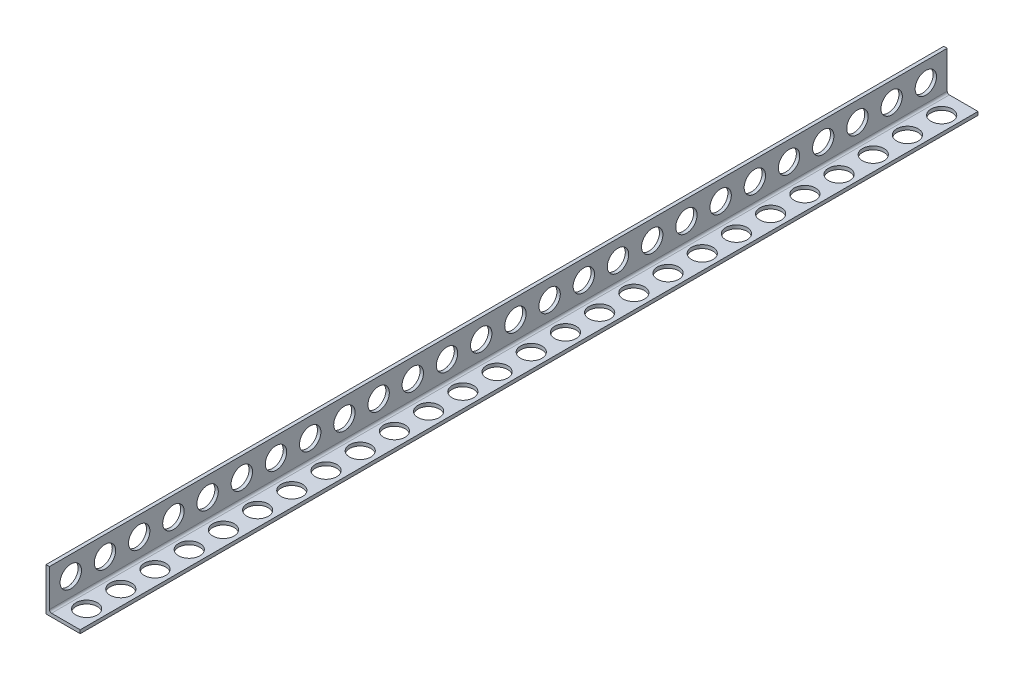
ISO-10303-21;
HEADER;
FILE_DESCRIPTION(('STEP AP214'),'2;1');
FILE_NAME('part.step','',(''),(''),'','','');
FILE_SCHEMA(('AUTOMOTIVE_DESIGN { 1 0 10303 214 1 1 1 1 }'));
ENDSEC;
DATA;
#1=APPLICATION_CONTEXT('core data for automotive mechanical design processes');
#2=APPLICATION_PROTOCOL_DEFINITION('international standard','automotive_design',2000,#1);
#3=PRODUCT_CONTEXT('',#1,'mechanical');
#4=PRODUCT('Part','Part','',(#3));
#5=PRODUCT_RELATED_PRODUCT_CATEGORY('part','',(#4));
#6=PRODUCT_DEFINITION_FORMATION('','',#4);
#7=PRODUCT_DEFINITION_CONTEXT('part definition',#1,'design');
#8=PRODUCT_DEFINITION('design','',#6,#7);
#9=PRODUCT_DEFINITION_SHAPE('','',#8);
#10=(LENGTH_UNIT() NAMED_UNIT(*) SI_UNIT(.MILLI.,.METRE.));
#11=(NAMED_UNIT(*) PLANE_ANGLE_UNIT() SI_UNIT($,.RADIAN.));
#12=(NAMED_UNIT(*) SI_UNIT($,.STERADIAN.) SOLID_ANGLE_UNIT());
#13=UNCERTAINTY_MEASURE_WITH_UNIT(LENGTH_MEASURE(1.E-05),#10,'distance_accuracy_value','');
#14=(GEOMETRIC_REPRESENTATION_CONTEXT(3) GLOBAL_UNCERTAINTY_ASSIGNED_CONTEXT((#13)) GLOBAL_UNIT_ASSIGNED_CONTEXT((#10,
#11,#12)) REPRESENTATION_CONTEXT('',''));
#15=CARTESIAN_POINT('',(0.,0.,0.));
#16=DIRECTION('',(0.,0.,1.));
#17=DIRECTION('',(1.,0.,0.));
#18=AXIS2_PLACEMENT_3D('',#15,#16,#17);
#19=CARTESIAN_POINT('',(-40.,100.,2100.));
#20=DIRECTION('',(1.,0.,0.));
#21=DIRECTION('',(0.,1.,0.));
#22=AXIS2_PLACEMENT_3D('',#19,#20,#21);
#23=PLANE('',#22);
#24=CARTESIAN_POINT('',(-40.,55.0000000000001,130.));
#25=DIRECTION('',(-1.,0.,0.));
#26=DIRECTION('',(0.,-1.,0.));
#27=AXIS2_PLACEMENT_3D('',#24,#25,#26);
#28=CIRCLE('',#27,25.);
#29=CARTESIAN_POINT('',(-40.,30.,130.));
#30=VERTEX_POINT('',#29);
#31=EDGE_CURVE('E1133',#30,#30,#28,.T.);
#32=ORIENTED_EDGE('',*,*,#31,.F.);
#33=EDGE_LOOP('',(#32));
#34=FACE_BOUND('',#33,.T.);
#35=CARTESIAN_POINT('',(-40.,55.0000000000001,50.));
#36=DIRECTION('',(-1.,0.,0.));
#37=DIRECTION('',(0.,-1.,0.));
#38=AXIS2_PLACEMENT_3D('',#35,#36,#37);
#39=CIRCLE('',#38,25.);
#40=CARTESIAN_POINT('',(-40.,30.,50.));
#41=VERTEX_POINT('',#40);
#42=EDGE_CURVE('E122',#41,#41,#39,.T.);
#43=ORIENTED_EDGE('',*,*,#42,.F.);
#44=EDGE_LOOP('',(#43));
#45=FACE_BOUND('',#44,.T.);
#46=DIRECTION('',(0.,-1.,0.));
#47=VECTOR('',#46,1.);
#48=CARTESIAN_POINT('',(-40.,100.,0.));
#49=LINE('',#48,#47);
#50=CARTESIAN_POINT('',(-40.,100.,0.));
#51=VERTEX_POINT('',#50);
#52=CARTESIAN_POINT('',(-40.,0.,0.));
#53=VERTEX_POINT('',#52);
#54=EDGE_CURVE('E99',#51,#53,#49,.T.);
#55=ORIENTED_EDGE('',*,*,#54,.T.);
#56=DIRECTION('',(0.,0.,-1.));
#57=VECTOR('',#56,1.);
#58=CARTESIAN_POINT('',(-40.,0.,2100.));
#59=LINE('',#58,#57);
#60=CARTESIAN_POINT('',(-40.,0.,2100.));
#61=VERTEX_POINT('',#60);
#62=EDGE_CURVE('E106',#61,#53,#59,.T.);
#63=ORIENTED_EDGE('',*,*,#62,.F.);
#64=DIRECTION('',(0.,-1.,0.));
#65=VECTOR('',#64,1.);
#66=CARTESIAN_POINT('',(-40.,100.,2100.));
#67=LINE('',#66,#65);
#68=CARTESIAN_POINT('',(-40.,100.,2100.));
#69=VERTEX_POINT('',#68);
#70=EDGE_CURVE('E134',#69,#61,#67,.T.);
#71=ORIENTED_EDGE('',*,*,#70,.F.);
#72=DIRECTION('',(0.,0.,-1.));
#73=VECTOR('',#72,1.);
#74=CARTESIAN_POINT('',(-40.,100.,2100.));
#75=LINE('',#74,#73);
#76=EDGE_CURVE('E118',#69,#51,#75,.T.);
#77=ORIENTED_EDGE('',*,*,#76,.T.);
#78=EDGE_LOOP('',(#55,#63,#71,#77));
#79=FACE_BOUND('',#78,.T.);
#80=CARTESIAN_POINT('',(-40.,55.0000000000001,210.));
#81=DIRECTION('',(-1.,0.,0.));
#82=DIRECTION('',(0.,-1.,0.));
#83=AXIS2_PLACEMENT_3D('',#80,#81,#82);
#84=CIRCLE('',#83,25.);
#85=CARTESIAN_POINT('',(-40.,30.,210.));
#86=VERTEX_POINT('',#85);
#87=EDGE_CURVE('E158',#86,#86,#84,.T.);
#88=ORIENTED_EDGE('',*,*,#87,.F.);
#89=EDGE_LOOP('',(#88));
#90=FACE_BOUND('',#89,.T.);
#91=CARTESIAN_POINT('',(-40.,55.0000000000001,290.));
#92=DIRECTION('',(-1.,0.,0.));
#93=DIRECTION('',(0.,-1.,0.));
#94=AXIS2_PLACEMENT_3D('',#91,#92,#93);
#95=CIRCLE('',#94,25.);
#96=CARTESIAN_POINT('',(-40.,30.,290.));
#97=VERTEX_POINT('',#96);
#98=EDGE_CURVE('E165',#97,#97,#95,.T.);
#99=ORIENTED_EDGE('',*,*,#98,.F.);
#100=EDGE_LOOP('',(#99));
#101=FACE_BOUND('',#100,.T.);
#102=CARTESIAN_POINT('',(-40.,55.0000000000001,370.));
#103=DIRECTION('',(-1.,0.,0.));
#104=DIRECTION('',(0.,-1.,0.));
#105=AXIS2_PLACEMENT_3D('',#102,#103,#104);
#106=CIRCLE('',#105,25.);
#107=CARTESIAN_POINT('',(-40.,30.,370.));
#108=VERTEX_POINT('',#107);
#109=EDGE_CURVE('E171',#108,#108,#106,.T.);
#110=ORIENTED_EDGE('',*,*,#109,.F.);
#111=EDGE_LOOP('',(#110));
#112=FACE_BOUND('',#111,.T.);
#113=CARTESIAN_POINT('',(-40.,55.0000000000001,450.));
#114=DIRECTION('',(-1.,0.,0.));
#115=DIRECTION('',(0.,-1.,0.));
#116=AXIS2_PLACEMENT_3D('',#113,#114,#115);
#117=CIRCLE('',#116,25.);
#118=CARTESIAN_POINT('',(-40.,30.,450.));
#119=VERTEX_POINT('',#118);
#120=EDGE_CURVE('E177',#119,#119,#117,.T.);
#121=ORIENTED_EDGE('',*,*,#120,.F.);
#122=EDGE_LOOP('',(#121));
#123=FACE_BOUND('',#122,.T.);
#124=CARTESIAN_POINT('',(-40.,55.0000000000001,530.));
#125=DIRECTION('',(-1.,0.,0.));
#126=DIRECTION('',(0.,-1.,0.));
#127=AXIS2_PLACEMENT_3D('',#124,#125,#126);
#128=CIRCLE('',#127,25.);
#129=CARTESIAN_POINT('',(-40.,30.,530.));
#130=VERTEX_POINT('',#129);
#131=EDGE_CURVE('E183',#130,#130,#128,.T.);
#132=ORIENTED_EDGE('',*,*,#131,.F.);
#133=EDGE_LOOP('',(#132));
#134=FACE_BOUND('',#133,.T.);
#135=CARTESIAN_POINT('',(-40.,55.0000000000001,610.));
#136=DIRECTION('',(-1.,0.,0.));
#137=DIRECTION('',(0.,-1.,0.));
#138=AXIS2_PLACEMENT_3D('',#135,#136,#137);
#139=CIRCLE('',#138,25.);
#140=CARTESIAN_POINT('',(-40.,30.,610.));
#141=VERTEX_POINT('',#140);
#142=EDGE_CURVE('E189',#141,#141,#139,.T.);
#143=ORIENTED_EDGE('',*,*,#142,.F.);
#144=EDGE_LOOP('',(#143));
#145=FACE_BOUND('',#144,.T.);
#146=CARTESIAN_POINT('',(-40.,55.0000000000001,690.));
#147=DIRECTION('',(-1.,0.,0.));
#148=DIRECTION('',(0.,-1.,0.));
#149=AXIS2_PLACEMENT_3D('',#146,#147,#148);
#150=CIRCLE('',#149,25.);
#151=CARTESIAN_POINT('',(-40.,30.,690.));
#152=VERTEX_POINT('',#151);
#153=EDGE_CURVE('E195',#152,#152,#150,.T.);
#154=ORIENTED_EDGE('',*,*,#153,.F.);
#155=EDGE_LOOP('',(#154));
#156=FACE_BOUND('',#155,.T.);
#157=CARTESIAN_POINT('',(-40.,55.0000000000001,770.));
#158=DIRECTION('',(-1.,0.,0.));
#159=DIRECTION('',(0.,-1.,0.));
#160=AXIS2_PLACEMENT_3D('',#157,#158,#159);
#161=CIRCLE('',#160,25.);
#162=CARTESIAN_POINT('',(-40.,30.,770.));
#163=VERTEX_POINT('',#162);
#164=EDGE_CURVE('E201',#163,#163,#161,.T.);
#165=ORIENTED_EDGE('',*,*,#164,.F.);
#166=EDGE_LOOP('',(#165));
#167=FACE_BOUND('',#166,.T.);
#168=CARTESIAN_POINT('',(-40.,55.0000000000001,850.));
#169=DIRECTION('',(-1.,0.,0.));
#170=DIRECTION('',(0.,-1.,0.));
#171=AXIS2_PLACEMENT_3D('',#168,#169,#170);
#172=CIRCLE('',#171,25.);
#173=CARTESIAN_POINT('',(-40.,30.,850.));
#174=VERTEX_POINT('',#173);
#175=EDGE_CURVE('E207',#174,#174,#172,.T.);
#176=ORIENTED_EDGE('',*,*,#175,.F.);
#177=EDGE_LOOP('',(#176));
#178=FACE_BOUND('',#177,.T.);
#179=CARTESIAN_POINT('',(-40.,55.0000000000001,930.));
#180=DIRECTION('',(-1.,0.,0.));
#181=DIRECTION('',(0.,-1.,0.));
#182=AXIS2_PLACEMENT_3D('',#179,#180,#181);
#183=CIRCLE('',#182,25.);
#184=CARTESIAN_POINT('',(-40.,30.,930.));
#185=VERTEX_POINT('',#184);
#186=EDGE_CURVE('E213',#185,#185,#183,.T.);
#187=ORIENTED_EDGE('',*,*,#186,.F.);
#188=EDGE_LOOP('',(#187));
#189=FACE_BOUND('',#188,.T.);
#190=CARTESIAN_POINT('',(-40.,55.0000000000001,1010.));
#191=DIRECTION('',(-1.,0.,0.));
#192=DIRECTION('',(0.,-1.,0.));
#193=AXIS2_PLACEMENT_3D('',#190,#191,#192);
#194=CIRCLE('',#193,25.);
#195=CARTESIAN_POINT('',(-40.,30.,1010.));
#196=VERTEX_POINT('',#195);
#197=EDGE_CURVE('E219',#196,#196,#194,.T.);
#198=ORIENTED_EDGE('',*,*,#197,.F.);
#199=EDGE_LOOP('',(#198));
#200=FACE_BOUND('',#199,.T.);
#201=CARTESIAN_POINT('',(-40.,55.0000000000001,1090.));
#202=DIRECTION('',(-1.,0.,0.));
#203=DIRECTION('',(0.,-1.,0.));
#204=AXIS2_PLACEMENT_3D('',#201,#202,#203);
#205=CIRCLE('',#204,25.);
#206=CARTESIAN_POINT('',(-40.,30.,1090.));
#207=VERTEX_POINT('',#206);
#208=EDGE_CURVE('E225',#207,#207,#205,.T.);
#209=ORIENTED_EDGE('',*,*,#208,.F.);
#210=EDGE_LOOP('',(#209));
#211=FACE_BOUND('',#210,.T.);
#212=CARTESIAN_POINT('',(-40.,55.0000000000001,1170.));
#213=DIRECTION('',(-1.,0.,0.));
#214=DIRECTION('',(0.,-1.,0.));
#215=AXIS2_PLACEMENT_3D('',#212,#213,#214);
#216=CIRCLE('',#215,25.);
#217=CARTESIAN_POINT('',(-40.,30.,1170.));
#218=VERTEX_POINT('',#217);
#219=EDGE_CURVE('E231',#218,#218,#216,.T.);
#220=ORIENTED_EDGE('',*,*,#219,.F.);
#221=EDGE_LOOP('',(#220));
#222=FACE_BOUND('',#221,.T.);
#223=CARTESIAN_POINT('',(-40.,55.0000000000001,1250.));
#224=DIRECTION('',(-1.,0.,0.));
#225=DIRECTION('',(0.,-1.,0.));
#226=AXIS2_PLACEMENT_3D('',#223,#224,#225);
#227=CIRCLE('',#226,25.);
#228=CARTESIAN_POINT('',(-40.,30.,1250.));
#229=VERTEX_POINT('',#228);
#230=EDGE_CURVE('E237',#229,#229,#227,.T.);
#231=ORIENTED_EDGE('',*,*,#230,.F.);
#232=EDGE_LOOP('',(#231));
#233=FACE_BOUND('',#232,.T.);
#234=CARTESIAN_POINT('',(-40.,55.0000000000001,1330.));
#235=DIRECTION('',(-1.,0.,0.));
#236=DIRECTION('',(0.,-1.,0.));
#237=AXIS2_PLACEMENT_3D('',#234,#235,#236);
#238=CIRCLE('',#237,25.);
#239=CARTESIAN_POINT('',(-40.,30.,1330.));
#240=VERTEX_POINT('',#239);
#241=EDGE_CURVE('E243',#240,#240,#238,.T.);
#242=ORIENTED_EDGE('',*,*,#241,.F.);
#243=EDGE_LOOP('',(#242));
#244=FACE_BOUND('',#243,.T.);
#245=CARTESIAN_POINT('',(-40.,55.0000000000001,1410.));
#246=DIRECTION('',(-1.,0.,0.));
#247=DIRECTION('',(0.,-1.,0.));
#248=AXIS2_PLACEMENT_3D('',#245,#246,#247);
#249=CIRCLE('',#248,25.);
#250=CARTESIAN_POINT('',(-40.,30.,1410.));
#251=VERTEX_POINT('',#250);
#252=EDGE_CURVE('E249',#251,#251,#249,.T.);
#253=ORIENTED_EDGE('',*,*,#252,.F.);
#254=EDGE_LOOP('',(#253));
#255=FACE_BOUND('',#254,.T.);
#256=CARTESIAN_POINT('',(-40.,55.0000000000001,1490.));
#257=DIRECTION('',(-1.,0.,0.));
#258=DIRECTION('',(0.,-1.,0.));
#259=AXIS2_PLACEMENT_3D('',#256,#257,#258);
#260=CIRCLE('',#259,25.);
#261=CARTESIAN_POINT('',(-40.,30.,1490.));
#262=VERTEX_POINT('',#261);
#263=EDGE_CURVE('E255',#262,#262,#260,.T.);
#264=ORIENTED_EDGE('',*,*,#263,.F.);
#265=EDGE_LOOP('',(#264));
#266=FACE_BOUND('',#265,.T.);
#267=CARTESIAN_POINT('',(-40.,55.0000000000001,1570.));
#268=DIRECTION('',(-1.,0.,0.));
#269=DIRECTION('',(0.,-1.,0.));
#270=AXIS2_PLACEMENT_3D('',#267,#268,#269);
#271=CIRCLE('',#270,25.);
#272=CARTESIAN_POINT('',(-40.,30.,1570.));
#273=VERTEX_POINT('',#272);
#274=EDGE_CURVE('E261',#273,#273,#271,.T.);
#275=ORIENTED_EDGE('',*,*,#274,.F.);
#276=EDGE_LOOP('',(#275));
#277=FACE_BOUND('',#276,.T.);
#278=CARTESIAN_POINT('',(-40.,55.0000000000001,1650.));
#279=DIRECTION('',(-1.,0.,0.));
#280=DIRECTION('',(0.,-1.,0.));
#281=AXIS2_PLACEMENT_3D('',#278,#279,#280);
#282=CIRCLE('',#281,25.);
#283=CARTESIAN_POINT('',(-40.,30.,1650.));
#284=VERTEX_POINT('',#283);
#285=EDGE_CURVE('E267',#284,#284,#282,.T.);
#286=ORIENTED_EDGE('',*,*,#285,.F.);
#287=EDGE_LOOP('',(#286));
#288=FACE_BOUND('',#287,.T.);
#289=CARTESIAN_POINT('',(-40.,55.0000000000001,1730.));
#290=DIRECTION('',(-1.,0.,0.));
#291=DIRECTION('',(0.,-1.,0.));
#292=AXIS2_PLACEMENT_3D('',#289,#290,#291);
#293=CIRCLE('',#292,25.);
#294=CARTESIAN_POINT('',(-40.,30.,1730.));
#295=VERTEX_POINT('',#294);
#296=EDGE_CURVE('E273',#295,#295,#293,.T.);
#297=ORIENTED_EDGE('',*,*,#296,.F.);
#298=EDGE_LOOP('',(#297));
#299=FACE_BOUND('',#298,.T.);
#300=CARTESIAN_POINT('',(-40.,55.0000000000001,1810.));
#301=DIRECTION('',(-1.,0.,0.));
#302=DIRECTION('',(0.,-1.,0.));
#303=AXIS2_PLACEMENT_3D('',#300,#301,#302);
#304=CIRCLE('',#303,25.);
#305=CARTESIAN_POINT('',(-40.,30.,1810.));
#306=VERTEX_POINT('',#305);
#307=EDGE_CURVE('E279',#306,#306,#304,.T.);
#308=ORIENTED_EDGE('',*,*,#307,.F.);
#309=EDGE_LOOP('',(#308));
#310=FACE_BOUND('',#309,.T.);
#311=CARTESIAN_POINT('',(-40.,55.0000000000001,1890.));
#312=DIRECTION('',(-1.,0.,0.));
#313=DIRECTION('',(0.,-1.,0.));
#314=AXIS2_PLACEMENT_3D('',#311,#312,#313);
#315=CIRCLE('',#314,25.);
#316=CARTESIAN_POINT('',(-40.,30.,1890.));
#317=VERTEX_POINT('',#316);
#318=EDGE_CURVE('E285',#317,#317,#315,.T.);
#319=ORIENTED_EDGE('',*,*,#318,.F.);
#320=EDGE_LOOP('',(#319));
#321=FACE_BOUND('',#320,.T.);
#322=CARTESIAN_POINT('',(-40.,55.0000000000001,1970.));
#323=DIRECTION('',(-1.,0.,0.));
#324=DIRECTION('',(0.,-1.,0.));
#325=AXIS2_PLACEMENT_3D('',#322,#323,#324);
#326=CIRCLE('',#325,25.);
#327=CARTESIAN_POINT('',(-40.,30.,1970.));
#328=VERTEX_POINT('',#327);
#329=EDGE_CURVE('E291',#328,#328,#326,.T.);
#330=ORIENTED_EDGE('',*,*,#329,.F.);
#331=EDGE_LOOP('',(#330));
#332=FACE_BOUND('',#331,.T.);
#333=CARTESIAN_POINT('',(-40.,55.0000000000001,2050.));
#334=DIRECTION('',(-1.,0.,0.));
#335=DIRECTION('',(0.,-1.,0.));
#336=AXIS2_PLACEMENT_3D('',#333,#334,#335);
#337=CIRCLE('',#336,25.);
#338=CARTESIAN_POINT('',(-40.,30.,2050.));
#339=VERTEX_POINT('',#338);
#340=EDGE_CURVE('E42',#339,#339,#337,.T.);
#341=ORIENTED_EDGE('',*,*,#340,.F.);
#342=EDGE_LOOP('',(#341));
#343=FACE_BOUND('',#342,.T.);
#344=ADVANCED_FACE('F34',(#34,#45,#79,#90,#101,#112,#123,#134,#145,#156,#167,#178,#189,#200,
#211,#222,#233,#244,#255,#266,#277,#288,#299,#310,#321,#332,#343),#23,.F.);
#345=CARTESIAN_POINT('',(-40.,0.,2100.));
#346=DIRECTION('',(0.,1.,0.));
#347=DIRECTION('',(0.,0.,1.));
#348=AXIS2_PLACEMENT_3D('',#345,#346,#347);
#349=PLANE('',#348);
#350=CARTESIAN_POINT('',(5.00000000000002,0.,2050.));
#351=DIRECTION('',(0.,1.,0.));
#352=DIRECTION('',(0.,0.,1.));
#353=AXIS2_PLACEMENT_3D('',#350,#351,#352);
#354=CIRCLE('',#353,25.);
#355=CARTESIAN_POINT('',(5.00000000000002,0.,2075.));
#356=VERTEX_POINT('',#355);
#357=EDGE_CURVE('E982',#356,#356,#354,.T.);
#358=ORIENTED_EDGE('',*,*,#357,.T.);
#359=EDGE_LOOP('',(#358));
#360=FACE_BOUND('',#359,.T.);
#361=CARTESIAN_POINT('',(5.00000000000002,0.,1970.));
#362=DIRECTION('',(0.,1.,0.));
#363=DIRECTION('',(0.,0.,1.));
#364=AXIS2_PLACEMENT_3D('',#361,#362,#363);
#365=CIRCLE('',#364,25.);
#366=CARTESIAN_POINT('',(5.00000000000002,0.,1995.));
#367=VERTEX_POINT('',#366);
#368=EDGE_CURVE('E992',#367,#367,#365,.T.);
#369=ORIENTED_EDGE('',*,*,#368,.T.);
#370=EDGE_LOOP('',(#369));
#371=FACE_BOUND('',#370,.T.);
#372=CARTESIAN_POINT('',(5.00000000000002,0.,1890.));
#373=DIRECTION('',(0.,1.,0.));
#374=DIRECTION('',(0.,0.,1.));
#375=AXIS2_PLACEMENT_3D('',#372,#373,#374);
#376=CIRCLE('',#375,25.);
#377=CARTESIAN_POINT('',(5.00000000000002,0.,1915.));
#378=VERTEX_POINT('',#377);
#379=EDGE_CURVE('E998',#378,#378,#376,.T.);
#380=ORIENTED_EDGE('',*,*,#379,.T.);
#381=EDGE_LOOP('',(#380));
#382=FACE_BOUND('',#381,.T.);
#383=CARTESIAN_POINT('',(5.00000000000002,0.,1810.));
#384=DIRECTION('',(0.,1.,0.));
#385=DIRECTION('',(0.,0.,1.));
#386=AXIS2_PLACEMENT_3D('',#383,#384,#385);
#387=CIRCLE('',#386,25.);
#388=CARTESIAN_POINT('',(5.00000000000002,0.,1835.));
#389=VERTEX_POINT('',#388);
#390=EDGE_CURVE('E1004',#389,#389,#387,.T.);
#391=ORIENTED_EDGE('',*,*,#390,.T.);
#392=EDGE_LOOP('',(#391));
#393=FACE_BOUND('',#392,.T.);
#394=CARTESIAN_POINT('',(5.00000000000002,0.,1730.));
#395=DIRECTION('',(0.,1.,0.));
#396=DIRECTION('',(0.,0.,1.));
#397=AXIS2_PLACEMENT_3D('',#394,#395,#396);
#398=CIRCLE('',#397,25.);
#399=CARTESIAN_POINT('',(5.00000000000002,0.,1755.));
#400=VERTEX_POINT('',#399);
#401=EDGE_CURVE('E1010',#400,#400,#398,.T.);
#402=ORIENTED_EDGE('',*,*,#401,.T.);
#403=EDGE_LOOP('',(#402));
#404=FACE_BOUND('',#403,.T.);
#405=CARTESIAN_POINT('',(5.00000000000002,0.,1650.));
#406=DIRECTION('',(0.,1.,0.));
#407=DIRECTION('',(0.,0.,1.));
#408=AXIS2_PLACEMENT_3D('',#405,#406,#407);
#409=CIRCLE('',#408,25.);
#410=CARTESIAN_POINT('',(5.00000000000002,0.,1675.));
#411=VERTEX_POINT('',#410);
#412=EDGE_CURVE('E1016',#411,#411,#409,.T.);
#413=ORIENTED_EDGE('',*,*,#412,.T.);
#414=EDGE_LOOP('',(#413));
#415=FACE_BOUND('',#414,.T.);
#416=CARTESIAN_POINT('',(5.00000000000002,0.,1570.));
#417=DIRECTION('',(0.,1.,0.));
#418=DIRECTION('',(0.,0.,1.));
#419=AXIS2_PLACEMENT_3D('',#416,#417,#418);
#420=CIRCLE('',#419,25.);
#421=CARTESIAN_POINT('',(5.00000000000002,0.,1595.));
#422=VERTEX_POINT('',#421);
#423=EDGE_CURVE('E1022',#422,#422,#420,.T.);
#424=ORIENTED_EDGE('',*,*,#423,.T.);
#425=EDGE_LOOP('',(#424));
#426=FACE_BOUND('',#425,.T.);
#427=CARTESIAN_POINT('',(5.00000000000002,0.,1490.));
#428=DIRECTION('',(0.,1.,0.));
#429=DIRECTION('',(0.,0.,1.));
#430=AXIS2_PLACEMENT_3D('',#427,#428,#429);
#431=CIRCLE('',#430,25.);
#432=CARTESIAN_POINT('',(5.00000000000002,0.,1515.));
#433=VERTEX_POINT('',#432);
#434=EDGE_CURVE('E1028',#433,#433,#431,.T.);
#435=ORIENTED_EDGE('',*,*,#434,.T.);
#436=EDGE_LOOP('',(#435));
#437=FACE_BOUND('',#436,.T.);
#438=CARTESIAN_POINT('',(5.00000000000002,0.,1410.));
#439=DIRECTION('',(0.,1.,0.));
#440=DIRECTION('',(0.,0.,1.));
#441=AXIS2_PLACEMENT_3D('',#438,#439,#440);
#442=CIRCLE('',#441,25.);
#443=CARTESIAN_POINT('',(5.00000000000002,0.,1435.));
#444=VERTEX_POINT('',#443);
#445=EDGE_CURVE('E1034',#444,#444,#442,.T.);
#446=ORIENTED_EDGE('',*,*,#445,.T.);
#447=EDGE_LOOP('',(#446));
#448=FACE_BOUND('',#447,.T.);
#449=CARTESIAN_POINT('',(5.00000000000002,0.,1330.));
#450=DIRECTION('',(0.,1.,0.));
#451=DIRECTION('',(0.,0.,1.));
#452=AXIS2_PLACEMENT_3D('',#449,#450,#451);
#453=CIRCLE('',#452,25.);
#454=CARTESIAN_POINT('',(5.00000000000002,0.,1355.));
#455=VERTEX_POINT('',#454);
#456=EDGE_CURVE('E1040',#455,#455,#453,.T.);
#457=ORIENTED_EDGE('',*,*,#456,.T.);
#458=EDGE_LOOP('',(#457));
#459=FACE_BOUND('',#458,.T.);
#460=CARTESIAN_POINT('',(5.00000000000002,0.,1250.));
#461=DIRECTION('',(0.,1.,0.));
#462=DIRECTION('',(0.,0.,1.));
#463=AXIS2_PLACEMENT_3D('',#460,#461,#462);
#464=CIRCLE('',#463,25.);
#465=CARTESIAN_POINT('',(5.00000000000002,0.,1275.));
#466=VERTEX_POINT('',#465);
#467=EDGE_CURVE('E1046',#466,#466,#464,.T.);
#468=ORIENTED_EDGE('',*,*,#467,.T.);
#469=EDGE_LOOP('',(#468));
#470=FACE_BOUND('',#469,.T.);
#471=CARTESIAN_POINT('',(5.00000000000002,0.,1170.));
#472=DIRECTION('',(0.,1.,0.));
#473=DIRECTION('',(0.,0.,1.));
#474=AXIS2_PLACEMENT_3D('',#471,#472,#473);
#475=CIRCLE('',#474,25.);
#476=CARTESIAN_POINT('',(5.00000000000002,0.,1195.));
#477=VERTEX_POINT('',#476);
#478=EDGE_CURVE('E1052',#477,#477,#475,.T.);
#479=ORIENTED_EDGE('',*,*,#478,.T.);
#480=EDGE_LOOP('',(#479));
#481=FACE_BOUND('',#480,.T.);
#482=CARTESIAN_POINT('',(5.00000000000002,0.,1090.));
#483=DIRECTION('',(0.,1.,0.));
#484=DIRECTION('',(0.,0.,1.));
#485=AXIS2_PLACEMENT_3D('',#482,#483,#484);
#486=CIRCLE('',#485,25.);
#487=CARTESIAN_POINT('',(5.00000000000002,0.,1115.));
#488=VERTEX_POINT('',#487);
#489=EDGE_CURVE('E1058',#488,#488,#486,.T.);
#490=ORIENTED_EDGE('',*,*,#489,.T.);
#491=EDGE_LOOP('',(#490));
#492=FACE_BOUND('',#491,.T.);
#493=CARTESIAN_POINT('',(5.00000000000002,0.,1010.));
#494=DIRECTION('',(0.,1.,0.));
#495=DIRECTION('',(0.,0.,1.));
#496=AXIS2_PLACEMENT_3D('',#493,#494,#495);
#497=CIRCLE('',#496,25.);
#498=CARTESIAN_POINT('',(5.00000000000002,0.,1035.));
#499=VERTEX_POINT('',#498);
#500=EDGE_CURVE('E1064',#499,#499,#497,.T.);
#501=ORIENTED_EDGE('',*,*,#500,.T.);
#502=EDGE_LOOP('',(#501));
#503=FACE_BOUND('',#502,.T.);
#504=CARTESIAN_POINT('',(5.00000000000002,0.,930.));
#505=DIRECTION('',(0.,1.,0.));
#506=DIRECTION('',(0.,0.,1.));
#507=AXIS2_PLACEMENT_3D('',#504,#505,#506);
#508=CIRCLE('',#507,25.);
#509=CARTESIAN_POINT('',(5.00000000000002,0.,955.));
#510=VERTEX_POINT('',#509);
#511=EDGE_CURVE('E1070',#510,#510,#508,.T.);
#512=ORIENTED_EDGE('',*,*,#511,.T.);
#513=EDGE_LOOP('',(#512));
#514=FACE_BOUND('',#513,.T.);
#515=CARTESIAN_POINT('',(5.00000000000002,0.,850.));
#516=DIRECTION('',(0.,1.,0.));
#517=DIRECTION('',(0.,0.,1.));
#518=AXIS2_PLACEMENT_3D('',#515,#516,#517);
#519=CIRCLE('',#518,25.);
#520=CARTESIAN_POINT('',(5.00000000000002,0.,875.));
#521=VERTEX_POINT('',#520);
#522=EDGE_CURVE('E1076',#521,#521,#519,.T.);
#523=ORIENTED_EDGE('',*,*,#522,.T.);
#524=EDGE_LOOP('',(#523));
#525=FACE_BOUND('',#524,.T.);
#526=CARTESIAN_POINT('',(5.00000000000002,0.,770.));
#527=DIRECTION('',(0.,1.,0.));
#528=DIRECTION('',(0.,0.,1.));
#529=AXIS2_PLACEMENT_3D('',#526,#527,#528);
#530=CIRCLE('',#529,25.);
#531=CARTESIAN_POINT('',(5.00000000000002,0.,795.));
#532=VERTEX_POINT('',#531);
#533=EDGE_CURVE('E1082',#532,#532,#530,.T.);
#534=ORIENTED_EDGE('',*,*,#533,.T.);
#535=EDGE_LOOP('',(#534));
#536=FACE_BOUND('',#535,.T.);
#537=CARTESIAN_POINT('',(5.00000000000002,0.,690.));
#538=DIRECTION('',(0.,1.,0.));
#539=DIRECTION('',(0.,0.,1.));
#540=AXIS2_PLACEMENT_3D('',#537,#538,#539);
#541=CIRCLE('',#540,25.);
#542=CARTESIAN_POINT('',(5.00000000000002,0.,715.));
#543=VERTEX_POINT('',#542);
#544=EDGE_CURVE('E1088',#543,#543,#541,.T.);
#545=ORIENTED_EDGE('',*,*,#544,.T.);
#546=EDGE_LOOP('',(#545));
#547=FACE_BOUND('',#546,.T.);
#548=CARTESIAN_POINT('',(5.00000000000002,0.,610.));
#549=DIRECTION('',(0.,1.,0.));
#550=DIRECTION('',(0.,0.,1.));
#551=AXIS2_PLACEMENT_3D('',#548,#549,#550);
#552=CIRCLE('',#551,25.);
#553=CARTESIAN_POINT('',(5.00000000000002,0.,635.));
#554=VERTEX_POINT('',#553);
#555=EDGE_CURVE('E1094',#554,#554,#552,.T.);
#556=ORIENTED_EDGE('',*,*,#555,.T.);
#557=EDGE_LOOP('',(#556));
#558=FACE_BOUND('',#557,.T.);
#559=CARTESIAN_POINT('',(5.00000000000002,0.,530.));
#560=DIRECTION('',(0.,1.,0.));
#561=DIRECTION('',(0.,0.,1.));
#562=AXIS2_PLACEMENT_3D('',#559,#560,#561);
#563=CIRCLE('',#562,25.);
#564=CARTESIAN_POINT('',(5.00000000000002,0.,555.));
#565=VERTEX_POINT('',#564);
#566=EDGE_CURVE('E1100',#565,#565,#563,.T.);
#567=ORIENTED_EDGE('',*,*,#566,.T.);
#568=EDGE_LOOP('',(#567));
#569=FACE_BOUND('',#568,.T.);
#570=CARTESIAN_POINT('',(5.00000000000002,0.,450.));
#571=DIRECTION('',(0.,1.,0.));
#572=DIRECTION('',(0.,0.,1.));
#573=AXIS2_PLACEMENT_3D('',#570,#571,#572);
#574=CIRCLE('',#573,25.);
#575=CARTESIAN_POINT('',(5.00000000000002,0.,475.));
#576=VERTEX_POINT('',#575);
#577=EDGE_CURVE('E1106',#576,#576,#574,.T.);
#578=ORIENTED_EDGE('',*,*,#577,.T.);
#579=EDGE_LOOP('',(#578));
#580=FACE_BOUND('',#579,.T.);
#581=CARTESIAN_POINT('',(5.00000000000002,0.,370.));
#582=DIRECTION('',(0.,1.,0.));
#583=DIRECTION('',(0.,0.,1.));
#584=AXIS2_PLACEMENT_3D('',#581,#582,#583);
#585=CIRCLE('',#584,25.);
#586=CARTESIAN_POINT('',(5.00000000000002,0.,395.));
#587=VERTEX_POINT('',#586);
#588=EDGE_CURVE('E1112',#587,#587,#585,.T.);
#589=ORIENTED_EDGE('',*,*,#588,.T.);
#590=EDGE_LOOP('',(#589));
#591=FACE_BOUND('',#590,.T.);
#592=CARTESIAN_POINT('',(5.00000000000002,0.,290.));
#593=DIRECTION('',(0.,1.,0.));
#594=DIRECTION('',(0.,0.,1.));
#595=AXIS2_PLACEMENT_3D('',#592,#593,#594);
#596=CIRCLE('',#595,25.);
#597=CARTESIAN_POINT('',(5.00000000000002,0.,315.));
#598=VERTEX_POINT('',#597);
#599=EDGE_CURVE('E1118',#598,#598,#596,.T.);
#600=ORIENTED_EDGE('',*,*,#599,.T.);
#601=EDGE_LOOP('',(#600));
#602=FACE_BOUND('',#601,.T.);
#603=CARTESIAN_POINT('',(5.00000000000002,0.,210.));
#604=DIRECTION('',(0.,1.,0.));
#605=DIRECTION('',(0.,0.,1.));
#606=AXIS2_PLACEMENT_3D('',#603,#604,#605);
#607=CIRCLE('',#606,25.);
#608=CARTESIAN_POINT('',(5.00000000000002,0.,235.));
#609=VERTEX_POINT('',#608);
#610=EDGE_CURVE('E1124',#609,#609,#607,.T.);
#611=ORIENTED_EDGE('',*,*,#610,.T.);
#612=EDGE_LOOP('',(#611));
#613=FACE_BOUND('',#612,.T.);
#614=CARTESIAN_POINT('',(5.00000000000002,0.,130.));
#615=DIRECTION('',(0.,1.,0.));
#616=DIRECTION('',(0.,0.,1.));
#617=AXIS2_PLACEMENT_3D('',#614,#615,#616);
#618=CIRCLE('',#617,25.);
#619=CARTESIAN_POINT('',(5.00000000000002,0.,155.));
#620=VERTEX_POINT('',#619);
#621=EDGE_CURVE('E1130',#620,#620,#618,.T.);
#622=ORIENTED_EDGE('',*,*,#621,.T.);
#623=EDGE_LOOP('',(#622));
#624=FACE_BOUND('',#623,.T.);
#625=CARTESIAN_POINT('',(5.00000000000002,0.,50.));
#626=DIRECTION('',(0.,1.,0.));
#627=DIRECTION('',(0.,0.,1.));
#628=AXIS2_PLACEMENT_3D('',#625,#626,#627);
#629=CIRCLE('',#628,25.);
#630=CARTESIAN_POINT('',(5.00000000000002,0.,75.));
#631=VERTEX_POINT('',#630);
#632=EDGE_CURVE('E1140',#631,#631,#629,.T.);
#633=ORIENTED_EDGE('',*,*,#632,.T.);
#634=EDGE_LOOP('',(#633));
#635=FACE_BOUND('',#634,.T.);
#636=DIRECTION('',(1.,0.,0.));
#637=VECTOR('',#636,1.);
#638=CARTESIAN_POINT('',(-40.,0.,0.));
#639=LINE('',#638,#637);
#640=CARTESIAN_POINT('',(40.,0.,0.));
#641=VERTEX_POINT('',#640);
#642=EDGE_CURVE('E94',#53,#641,#639,.T.);
#643=ORIENTED_EDGE('',*,*,#642,.T.);
#644=DIRECTION('',(0.,0.,-1.));
#645=VECTOR('',#644,1.);
#646=CARTESIAN_POINT('',(40.,0.,2100.));
#647=LINE('',#646,#645);
#648=CARTESIAN_POINT('',(40.,0.,2100.));
#649=VERTEX_POINT('',#648);
#650=EDGE_CURVE('E113',#649,#641,#647,.T.);
#651=ORIENTED_EDGE('',*,*,#650,.F.);
#652=DIRECTION('',(1.,0.,0.));
#653=VECTOR('',#652,1.);
#654=CARTESIAN_POINT('',(-40.,0.,2100.));
#655=LINE('',#654,#653);
#656=EDGE_CURVE('E108',#61,#649,#655,.T.);
#657=ORIENTED_EDGE('',*,*,#656,.F.);
#658=ORIENTED_EDGE('',*,*,#62,.T.);
#659=EDGE_LOOP('',(#643,#651,#657,#658));
#660=FACE_BOUND('',#659,.T.);
#661=ADVANCED_FACE('F107',(#360,#371,#382,#393,#404,#415,#426,#437,#448,#459,#470,#481,#492,
#503,#514,#525,#536,#547,#558,#569,#580,#591,#602,#613,#624,#635,#660),#349,.F.);
#662=CARTESIAN_POINT('',(40.,8.,2100.));
#663=DIRECTION('',(-1.,0.,0.));
#664=DIRECTION('',(0.,-1.,0.));
#665=AXIS2_PLACEMENT_3D('',#662,#663,#664);
#666=PLANE('',#665);
#667=DIRECTION('',(0.,1.,0.));
#668=VECTOR('',#667,1.);
#669=CARTESIAN_POINT('',(40.,8.,0.));
#670=LINE('',#669,#668);
#671=CARTESIAN_POINT('',(40.,8.,0.));
#672=VERTEX_POINT('',#671);
#673=EDGE_CURVE('E100',#641,#672,#670,.T.);
#674=ORIENTED_EDGE('',*,*,#673,.T.);
#675=DIRECTION('',(0.,0.,-1.));
#676=VECTOR('',#675,1.);
#677=CARTESIAN_POINT('',(40.,8.,2100.));
#678=LINE('',#677,#676);
#679=CARTESIAN_POINT('',(40.,8.,2100.));
#680=VERTEX_POINT('',#679);
#681=EDGE_CURVE('E149',#680,#672,#678,.T.);
#682=ORIENTED_EDGE('',*,*,#681,.F.);
#683=DIRECTION('',(0.,1.,0.));
#684=VECTOR('',#683,1.);
#685=CARTESIAN_POINT('',(40.,8.,2100.));
#686=LINE('',#685,#684);
#687=EDGE_CURVE('E137',#649,#680,#686,.T.);
#688=ORIENTED_EDGE('',*,*,#687,.F.);
#689=ORIENTED_EDGE('',*,*,#650,.T.);
#690=EDGE_LOOP('',(#674,#682,#688,#689));
#691=FACE_BOUND('',#690,.T.);
#692=ADVANCED_FACE('F307',(#691),#666,.F.);
#693=CARTESIAN_POINT('',(-32.,8.,2100.));
#694=DIRECTION('',(0.,-1.,0.));
#695=DIRECTION('',(0.,0.,-1.));
#696=AXIS2_PLACEMENT_3D('',#693,#694,#695);
#697=PLANE('',#696);
#698=CARTESIAN_POINT('',(5.00000000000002,8.,2050.));
#699=DIRECTION('',(0.,1.,0.));
#700=DIRECTION('',(0.,0.,1.));
#701=AXIS2_PLACEMENT_3D('',#698,#699,#700);
#702=CIRCLE('',#701,25.);
#703=CARTESIAN_POINT('',(5.00000000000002,8.,2075.));
#704=VERTEX_POINT('',#703);
#705=EDGE_CURVE('E985',#704,#704,#702,.T.);
#706=ORIENTED_EDGE('',*,*,#705,.F.);
#707=EDGE_LOOP('',(#706));
#708=FACE_BOUND('',#707,.T.);
#709=CARTESIAN_POINT('',(5.00000000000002,8.,1970.));
#710=DIRECTION('',(0.,1.,0.));
#711=DIRECTION('',(0.,0.,1.));
#712=AXIS2_PLACEMENT_3D('',#709,#710,#711);
#713=CIRCLE('',#712,25.);
#714=CARTESIAN_POINT('',(5.00000000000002,8.,1995.));
#715=VERTEX_POINT('',#714);
#716=EDGE_CURVE('E987',#715,#715,#713,.T.);
#717=ORIENTED_EDGE('',*,*,#716,.F.);
#718=EDGE_LOOP('',(#717));
#719=FACE_BOUND('',#718,.T.);
#720=CARTESIAN_POINT('',(5.00000000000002,8.,1890.));
#721=DIRECTION('',(0.,1.,0.));
#722=DIRECTION('',(0.,0.,1.));
#723=AXIS2_PLACEMENT_3D('',#720,#721,#722);
#724=CIRCLE('',#723,25.);
#725=CARTESIAN_POINT('',(5.00000000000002,8.,1915.));
#726=VERTEX_POINT('',#725);
#727=EDGE_CURVE('E995',#726,#726,#724,.T.);
#728=ORIENTED_EDGE('',*,*,#727,.F.);
#729=EDGE_LOOP('',(#728));
#730=FACE_BOUND('',#729,.T.);
#731=CARTESIAN_POINT('',(5.00000000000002,8.,1810.));
#732=DIRECTION('',(0.,1.,0.));
#733=DIRECTION('',(0.,0.,1.));
#734=AXIS2_PLACEMENT_3D('',#731,#732,#733);
#735=CIRCLE('',#734,25.);
#736=CARTESIAN_POINT('',(5.00000000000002,8.,1835.));
#737=VERTEX_POINT('',#736);
#738=EDGE_CURVE('E1001',#737,#737,#735,.T.);
#739=ORIENTED_EDGE('',*,*,#738,.F.);
#740=EDGE_LOOP('',(#739));
#741=FACE_BOUND('',#740,.T.);
#742=CARTESIAN_POINT('',(5.00000000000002,8.,1730.));
#743=DIRECTION('',(0.,1.,0.));
#744=DIRECTION('',(0.,0.,1.));
#745=AXIS2_PLACEMENT_3D('',#742,#743,#744);
#746=CIRCLE('',#745,25.);
#747=CARTESIAN_POINT('',(5.00000000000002,8.,1755.));
#748=VERTEX_POINT('',#747);
#749=EDGE_CURVE('E1007',#748,#748,#746,.T.);
#750=ORIENTED_EDGE('',*,*,#749,.F.);
#751=EDGE_LOOP('',(#750));
#752=FACE_BOUND('',#751,.T.);
#753=CARTESIAN_POINT('',(5.00000000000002,8.,1650.));
#754=DIRECTION('',(0.,1.,0.));
#755=DIRECTION('',(0.,0.,1.));
#756=AXIS2_PLACEMENT_3D('',#753,#754,#755);
#757=CIRCLE('',#756,25.);
#758=CARTESIAN_POINT('',(5.00000000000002,8.,1675.));
#759=VERTEX_POINT('',#758);
#760=EDGE_CURVE('E1013',#759,#759,#757,.T.);
#761=ORIENTED_EDGE('',*,*,#760,.F.);
#762=EDGE_LOOP('',(#761));
#763=FACE_BOUND('',#762,.T.);
#764=CARTESIAN_POINT('',(5.00000000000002,8.,1570.));
#765=DIRECTION('',(0.,1.,0.));
#766=DIRECTION('',(0.,0.,1.));
#767=AXIS2_PLACEMENT_3D('',#764,#765,#766);
#768=CIRCLE('',#767,25.);
#769=CARTESIAN_POINT('',(5.00000000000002,8.,1595.));
#770=VERTEX_POINT('',#769);
#771=EDGE_CURVE('E1019',#770,#770,#768,.T.);
#772=ORIENTED_EDGE('',*,*,#771,.F.);
#773=EDGE_LOOP('',(#772));
#774=FACE_BOUND('',#773,.T.);
#775=CARTESIAN_POINT('',(5.00000000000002,8.,1490.));
#776=DIRECTION('',(0.,1.,0.));
#777=DIRECTION('',(0.,0.,1.));
#778=AXIS2_PLACEMENT_3D('',#775,#776,#777);
#779=CIRCLE('',#778,25.);
#780=CARTESIAN_POINT('',(5.00000000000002,8.,1515.));
#781=VERTEX_POINT('',#780);
#782=EDGE_CURVE('E1025',#781,#781,#779,.T.);
#783=ORIENTED_EDGE('',*,*,#782,.F.);
#784=EDGE_LOOP('',(#783));
#785=FACE_BOUND('',#784,.T.);
#786=CARTESIAN_POINT('',(5.00000000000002,8.,1410.));
#787=DIRECTION('',(0.,1.,0.));
#788=DIRECTION('',(0.,0.,1.));
#789=AXIS2_PLACEMENT_3D('',#786,#787,#788);
#790=CIRCLE('',#789,25.);
#791=CARTESIAN_POINT('',(5.00000000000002,8.,1435.));
#792=VERTEX_POINT('',#791);
#793=EDGE_CURVE('E1031',#792,#792,#790,.T.);
#794=ORIENTED_EDGE('',*,*,#793,.F.);
#795=EDGE_LOOP('',(#794));
#796=FACE_BOUND('',#795,.T.);
#797=CARTESIAN_POINT('',(5.00000000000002,8.,1330.));
#798=DIRECTION('',(0.,1.,0.));
#799=DIRECTION('',(0.,0.,1.));
#800=AXIS2_PLACEMENT_3D('',#797,#798,#799);
#801=CIRCLE('',#800,25.);
#802=CARTESIAN_POINT('',(5.00000000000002,8.,1355.));
#803=VERTEX_POINT('',#802);
#804=EDGE_CURVE('E1037',#803,#803,#801,.T.);
#805=ORIENTED_EDGE('',*,*,#804,.F.);
#806=EDGE_LOOP('',(#805));
#807=FACE_BOUND('',#806,.T.);
#808=CARTESIAN_POINT('',(5.00000000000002,8.,1250.));
#809=DIRECTION('',(0.,1.,0.));
#810=DIRECTION('',(0.,0.,1.));
#811=AXIS2_PLACEMENT_3D('',#808,#809,#810);
#812=CIRCLE('',#811,25.);
#813=CARTESIAN_POINT('',(5.00000000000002,8.,1275.));
#814=VERTEX_POINT('',#813);
#815=EDGE_CURVE('E1043',#814,#814,#812,.T.);
#816=ORIENTED_EDGE('',*,*,#815,.F.);
#817=EDGE_LOOP('',(#816));
#818=FACE_BOUND('',#817,.T.);
#819=CARTESIAN_POINT('',(5.00000000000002,8.,1170.));
#820=DIRECTION('',(0.,1.,0.));
#821=DIRECTION('',(0.,0.,1.));
#822=AXIS2_PLACEMENT_3D('',#819,#820,#821);
#823=CIRCLE('',#822,25.);
#824=CARTESIAN_POINT('',(5.00000000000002,8.,1195.));
#825=VERTEX_POINT('',#824);
#826=EDGE_CURVE('E1049',#825,#825,#823,.T.);
#827=ORIENTED_EDGE('',*,*,#826,.F.);
#828=EDGE_LOOP('',(#827));
#829=FACE_BOUND('',#828,.T.);
#830=CARTESIAN_POINT('',(5.00000000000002,8.,1090.));
#831=DIRECTION('',(0.,1.,0.));
#832=DIRECTION('',(0.,0.,1.));
#833=AXIS2_PLACEMENT_3D('',#830,#831,#832);
#834=CIRCLE('',#833,25.);
#835=CARTESIAN_POINT('',(5.00000000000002,8.,1115.));
#836=VERTEX_POINT('',#835);
#837=EDGE_CURVE('E1055',#836,#836,#834,.T.);
#838=ORIENTED_EDGE('',*,*,#837,.F.);
#839=EDGE_LOOP('',(#838));
#840=FACE_BOUND('',#839,.T.);
#841=CARTESIAN_POINT('',(5.00000000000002,8.,1010.));
#842=DIRECTION('',(0.,1.,0.));
#843=DIRECTION('',(0.,0.,1.));
#844=AXIS2_PLACEMENT_3D('',#841,#842,#843);
#845=CIRCLE('',#844,25.);
#846=CARTESIAN_POINT('',(5.00000000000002,8.,1035.));
#847=VERTEX_POINT('',#846);
#848=EDGE_CURVE('E1061',#847,#847,#845,.T.);
#849=ORIENTED_EDGE('',*,*,#848,.F.);
#850=EDGE_LOOP('',(#849));
#851=FACE_BOUND('',#850,.T.);
#852=CARTESIAN_POINT('',(5.00000000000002,8.,930.));
#853=DIRECTION('',(0.,1.,0.));
#854=DIRECTION('',(0.,0.,1.));
#855=AXIS2_PLACEMENT_3D('',#852,#853,#854);
#856=CIRCLE('',#855,25.);
#857=CARTESIAN_POINT('',(5.00000000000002,8.,955.));
#858=VERTEX_POINT('',#857);
#859=EDGE_CURVE('E1067',#858,#858,#856,.T.);
#860=ORIENTED_EDGE('',*,*,#859,.F.);
#861=EDGE_LOOP('',(#860));
#862=FACE_BOUND('',#861,.T.);
#863=CARTESIAN_POINT('',(5.00000000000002,8.,850.));
#864=DIRECTION('',(0.,1.,0.));
#865=DIRECTION('',(0.,0.,1.));
#866=AXIS2_PLACEMENT_3D('',#863,#864,#865);
#867=CIRCLE('',#866,25.);
#868=CARTESIAN_POINT('',(5.00000000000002,8.,875.));
#869=VERTEX_POINT('',#868);
#870=EDGE_CURVE('E1073',#869,#869,#867,.T.);
#871=ORIENTED_EDGE('',*,*,#870,.F.);
#872=EDGE_LOOP('',(#871));
#873=FACE_BOUND('',#872,.T.);
#874=CARTESIAN_POINT('',(5.00000000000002,8.,770.));
#875=DIRECTION('',(0.,1.,0.));
#876=DIRECTION('',(0.,0.,1.));
#877=AXIS2_PLACEMENT_3D('',#874,#875,#876);
#878=CIRCLE('',#877,25.);
#879=CARTESIAN_POINT('',(5.00000000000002,8.,795.));
#880=VERTEX_POINT('',#879);
#881=EDGE_CURVE('E1079',#880,#880,#878,.T.);
#882=ORIENTED_EDGE('',*,*,#881,.F.);
#883=EDGE_LOOP('',(#882));
#884=FACE_BOUND('',#883,.T.);
#885=CARTESIAN_POINT('',(5.00000000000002,8.,690.));
#886=DIRECTION('',(0.,1.,0.));
#887=DIRECTION('',(0.,0.,1.));
#888=AXIS2_PLACEMENT_3D('',#885,#886,#887);
#889=CIRCLE('',#888,25.);
#890=CARTESIAN_POINT('',(5.00000000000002,8.,715.));
#891=VERTEX_POINT('',#890);
#892=EDGE_CURVE('E1085',#891,#891,#889,.T.);
#893=ORIENTED_EDGE('',*,*,#892,.F.);
#894=EDGE_LOOP('',(#893));
#895=FACE_BOUND('',#894,.T.);
#896=CARTESIAN_POINT('',(5.00000000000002,8.,610.));
#897=DIRECTION('',(0.,1.,0.));
#898=DIRECTION('',(0.,0.,1.));
#899=AXIS2_PLACEMENT_3D('',#896,#897,#898);
#900=CIRCLE('',#899,25.);
#901=CARTESIAN_POINT('',(5.00000000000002,8.,635.));
#902=VERTEX_POINT('',#901);
#903=EDGE_CURVE('E1091',#902,#902,#900,.T.);
#904=ORIENTED_EDGE('',*,*,#903,.F.);
#905=EDGE_LOOP('',(#904));
#906=FACE_BOUND('',#905,.T.);
#907=CARTESIAN_POINT('',(5.00000000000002,8.,530.));
#908=DIRECTION('',(0.,1.,0.));
#909=DIRECTION('',(0.,0.,1.));
#910=AXIS2_PLACEMENT_3D('',#907,#908,#909);
#911=CIRCLE('',#910,25.);
#912=CARTESIAN_POINT('',(5.00000000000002,8.,555.));
#913=VERTEX_POINT('',#912);
#914=EDGE_CURVE('E1097',#913,#913,#911,.T.);
#915=ORIENTED_EDGE('',*,*,#914,.F.);
#916=EDGE_LOOP('',(#915));
#917=FACE_BOUND('',#916,.T.);
#918=CARTESIAN_POINT('',(5.00000000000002,8.,450.));
#919=DIRECTION('',(0.,1.,0.));
#920=DIRECTION('',(0.,0.,1.));
#921=AXIS2_PLACEMENT_3D('',#918,#919,#920);
#922=CIRCLE('',#921,25.);
#923=CARTESIAN_POINT('',(5.00000000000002,8.,475.));
#924=VERTEX_POINT('',#923);
#925=EDGE_CURVE('E1103',#924,#924,#922,.T.);
#926=ORIENTED_EDGE('',*,*,#925,.F.);
#927=EDGE_LOOP('',(#926));
#928=FACE_BOUND('',#927,.T.);
#929=CARTESIAN_POINT('',(5.00000000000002,8.,370.));
#930=DIRECTION('',(0.,1.,0.));
#931=DIRECTION('',(0.,0.,1.));
#932=AXIS2_PLACEMENT_3D('',#929,#930,#931);
#933=CIRCLE('',#932,25.);
#934=CARTESIAN_POINT('',(5.00000000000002,8.,395.));
#935=VERTEX_POINT('',#934);
#936=EDGE_CURVE('E1109',#935,#935,#933,.T.);
#937=ORIENTED_EDGE('',*,*,#936,.F.);
#938=EDGE_LOOP('',(#937));
#939=FACE_BOUND('',#938,.T.);
#940=CARTESIAN_POINT('',(5.00000000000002,8.,290.));
#941=DIRECTION('',(0.,1.,0.));
#942=DIRECTION('',(0.,0.,1.));
#943=AXIS2_PLACEMENT_3D('',#940,#941,#942);
#944=CIRCLE('',#943,25.);
#945=CARTESIAN_POINT('',(5.00000000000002,8.,315.));
#946=VERTEX_POINT('',#945);
#947=EDGE_CURVE('E1115',#946,#946,#944,.T.);
#948=ORIENTED_EDGE('',*,*,#947,.F.);
#949=EDGE_LOOP('',(#948));
#950=FACE_BOUND('',#949,.T.);
#951=CARTESIAN_POINT('',(5.00000000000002,8.,210.));
#952=DIRECTION('',(0.,1.,0.));
#953=DIRECTION('',(0.,0.,1.));
#954=AXIS2_PLACEMENT_3D('',#951,#952,#953);
#955=CIRCLE('',#954,25.);
#956=CARTESIAN_POINT('',(5.00000000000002,8.,235.));
#957=VERTEX_POINT('',#956);
#958=EDGE_CURVE('E1121',#957,#957,#955,.T.);
#959=ORIENTED_EDGE('',*,*,#958,.F.);
#960=EDGE_LOOP('',(#959));
#961=FACE_BOUND('',#960,.T.);
#962=CARTESIAN_POINT('',(5.00000000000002,8.,130.));
#963=DIRECTION('',(0.,1.,0.));
#964=DIRECTION('',(0.,0.,1.));
#965=AXIS2_PLACEMENT_3D('',#962,#963,#964);
#966=CIRCLE('',#965,25.);
#967=CARTESIAN_POINT('',(5.00000000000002,8.,155.));
#968=VERTEX_POINT('',#967);
#969=EDGE_CURVE('E1127',#968,#968,#966,.T.);
#970=ORIENTED_EDGE('',*,*,#969,.F.);
#971=EDGE_LOOP('',(#970));
#972=FACE_BOUND('',#971,.T.);
#973=CARTESIAN_POINT('',(5.00000000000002,8.,50.));
#974=DIRECTION('',(0.,1.,0.));
#975=DIRECTION('',(0.,0.,1.));
#976=AXIS2_PLACEMENT_3D('',#973,#974,#975);
#977=CIRCLE('',#976,25.);
#978=CARTESIAN_POINT('',(5.00000000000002,8.,75.));
#979=VERTEX_POINT('',#978);
#980=EDGE_CURVE('E1138',#979,#979,#977,.T.);
#981=ORIENTED_EDGE('',*,*,#980,.F.);
#982=EDGE_LOOP('',(#981));
#983=FACE_BOUND('',#982,.T.);
#984=DIRECTION('',(-1.,0.,0.));
#985=VECTOR('',#984,1.);
#986=CARTESIAN_POINT('',(-32.,8.,0.));
#987=LINE('',#986,#985);
#988=CARTESIAN_POINT('',(-27.,8.,0.));
#989=VERTEX_POINT('',#988);
#990=EDGE_CURVE('E128',#672,#989,#987,.T.);
#991=ORIENTED_EDGE('',*,*,#990,.T.);
#992=DIRECTION('',(0.,0.,-1.));
#993=VECTOR('',#992,1.);
#994=CARTESIAN_POINT('',(-27.,8.,2100.));
#995=LINE('',#994,#993);
#996=CARTESIAN_POINT('',(-27.,8.,2100.));
#997=VERTEX_POINT('',#996);
#998=EDGE_CURVE('E49',#989,#997,#995,.F.);
#999=ORIENTED_EDGE('',*,*,#998,.T.);
#1000=DIRECTION('',(-1.,0.,0.));
#1001=VECTOR('',#1000,1.);
#1002=CARTESIAN_POINT('',(-32.,8.,2100.));
#1003=LINE('',#1002,#1001);
#1004=EDGE_CURVE('E139',#680,#997,#1003,.T.);
#1005=ORIENTED_EDGE('',*,*,#1004,.F.);
#1006=ORIENTED_EDGE('',*,*,#681,.T.);
#1007=EDGE_LOOP('',(#991,#999,#1005,#1006));
#1008=FACE_BOUND('',#1007,.T.);
#1009=ADVANCED_FACE('F417',(#708,#719,#730,#741,#752,#763,#774,#785,#796,#807,#818,#829,#840,
#851,#862,#873,#884,#895,#906,#917,#928,#939,#950,#961,#972,#983,#1008),#697,.F.);
#1010=CARTESIAN_POINT('',(-32.,100.,2100.));
#1011=DIRECTION('',(-1.,0.,0.));
#1012=DIRECTION('',(0.,-1.,0.));
#1013=AXIS2_PLACEMENT_3D('',#1010,#1011,#1012);
#1014=PLANE('',#1013);
#1015=CARTESIAN_POINT('',(-32.,55.0000000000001,130.));
#1016=DIRECTION('',(-1.,0.,0.));
#1017=DIRECTION('',(0.,-1.,0.));
#1018=AXIS2_PLACEMENT_3D('',#1015,#1016,#1017);
#1019=CIRCLE('',#1018,25.);
#1020=CARTESIAN_POINT('',(-32.,30.,130.));
#1021=VERTEX_POINT('',#1020);
#1022=EDGE_CURVE('E1136',#1021,#1021,#1019,.T.);
#1023=ORIENTED_EDGE('',*,*,#1022,.T.);
#1024=EDGE_LOOP('',(#1023));
#1025=FACE_BOUND('',#1024,.T.);
#1026=CARTESIAN_POINT('',(-32.,55.0000000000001,50.));
#1027=DIRECTION('',(-1.,0.,0.));
#1028=DIRECTION('',(0.,-1.,0.));
#1029=AXIS2_PLACEMENT_3D('',#1026,#1027,#1028);
#1030=CIRCLE('',#1029,25.);
#1031=CARTESIAN_POINT('',(-32.,30.,50.));
#1032=VERTEX_POINT('',#1031);
#1033=EDGE_CURVE('E119',#1032,#1032,#1030,.T.);
#1034=ORIENTED_EDGE('',*,*,#1033,.T.);
#1035=EDGE_LOOP('',(#1034));
#1036=FACE_BOUND('',#1035,.T.);
#1037=DIRECTION('',(0.,1.,0.));
#1038=VECTOR('',#1037,1.);
#1039=CARTESIAN_POINT('',(-32.,100.,2100.));
#1040=LINE('',#1039,#1038);
#1041=CARTESIAN_POINT('',(-32.,13.,2100.));
#1042=VERTEX_POINT('',#1041);
#1043=CARTESIAN_POINT('',(-32.,100.,2100.));
#1044=VERTEX_POINT('',#1043);
#1045=EDGE_CURVE('E141',#1042,#1044,#1040,.T.);
#1046=ORIENTED_EDGE('',*,*,#1045,.F.);
#1047=DIRECTION('',(0.,0.,-1.));
#1048=VECTOR('',#1047,1.);
#1049=CARTESIAN_POINT('',(-32.,13.,0.));
#1050=LINE('',#1049,#1048);
#1051=CARTESIAN_POINT('',(-32.,13.,0.));
#1052=VERTEX_POINT('',#1051);
#1053=EDGE_CURVE('E112',#1042,#1052,#1050,.T.);
#1054=ORIENTED_EDGE('',*,*,#1053,.T.);
#1055=DIRECTION('',(0.,1.,0.));
#1056=VECTOR('',#1055,1.);
#1057=CARTESIAN_POINT('',(-32.,100.,0.));
#1058=LINE('',#1057,#1056);
#1059=CARTESIAN_POINT('',(-32.,100.,0.));
#1060=VERTEX_POINT('',#1059);
#1061=EDGE_CURVE('E130',#1052,#1060,#1058,.T.);
#1062=ORIENTED_EDGE('',*,*,#1061,.T.);
#1063=DIRECTION('',(0.,0.,-1.));
#1064=VECTOR('',#1063,1.);
#1065=CARTESIAN_POINT('',(-32.,100.,2100.));
#1066=LINE('',#1065,#1064);
#1067=EDGE_CURVE('E146',#1044,#1060,#1066,.T.);
#1068=ORIENTED_EDGE('',*,*,#1067,.F.);
#1069=EDGE_LOOP('',(#1046,#1054,#1062,#1068));
#1070=FACE_BOUND('',#1069,.T.);
#1071=CARTESIAN_POINT('',(-32.,55.0000000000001,210.));
#1072=DIRECTION('',(-1.,0.,0.));
#1073=DIRECTION('',(0.,-1.,0.));
#1074=AXIS2_PLACEMENT_3D('',#1071,#1072,#1073);
#1075=CIRCLE('',#1074,25.);
#1076=CARTESIAN_POINT('',(-32.,30.,210.));
#1077=VERTEX_POINT('',#1076);
#1078=EDGE_CURVE('E162',#1077,#1077,#1075,.T.);
#1079=ORIENTED_EDGE('',*,*,#1078,.T.);
#1080=EDGE_LOOP('',(#1079));
#1081=FACE_BOUND('',#1080,.T.);
#1082=CARTESIAN_POINT('',(-32.,55.0000000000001,290.));
#1083=DIRECTION('',(-1.,0.,0.));
#1084=DIRECTION('',(0.,-1.,0.));
#1085=AXIS2_PLACEMENT_3D('',#1082,#1083,#1084);
#1086=CIRCLE('',#1085,25.);
#1087=CARTESIAN_POINT('',(-32.,30.,290.));
#1088=VERTEX_POINT('',#1087);
#1089=EDGE_CURVE('E168',#1088,#1088,#1086,.T.);
#1090=ORIENTED_EDGE('',*,*,#1089,.T.);
#1091=EDGE_LOOP('',(#1090));
#1092=FACE_BOUND('',#1091,.T.);
#1093=CARTESIAN_POINT('',(-32.,55.0000000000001,370.));
#1094=DIRECTION('',(-1.,0.,0.));
#1095=DIRECTION('',(0.,-1.,0.));
#1096=AXIS2_PLACEMENT_3D('',#1093,#1094,#1095);
#1097=CIRCLE('',#1096,25.);
#1098=CARTESIAN_POINT('',(-32.,30.,370.));
#1099=VERTEX_POINT('',#1098);
#1100=EDGE_CURVE('E174',#1099,#1099,#1097,.T.);
#1101=ORIENTED_EDGE('',*,*,#1100,.T.);
#1102=EDGE_LOOP('',(#1101));
#1103=FACE_BOUND('',#1102,.T.);
#1104=CARTESIAN_POINT('',(-32.,55.0000000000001,450.));
#1105=DIRECTION('',(-1.,0.,0.));
#1106=DIRECTION('',(0.,-1.,0.));
#1107=AXIS2_PLACEMENT_3D('',#1104,#1105,#1106);
#1108=CIRCLE('',#1107,25.);
#1109=CARTESIAN_POINT('',(-32.,30.,450.));
#1110=VERTEX_POINT('',#1109);
#1111=EDGE_CURVE('E180',#1110,#1110,#1108,.T.);
#1112=ORIENTED_EDGE('',*,*,#1111,.T.);
#1113=EDGE_LOOP('',(#1112));
#1114=FACE_BOUND('',#1113,.T.);
#1115=CARTESIAN_POINT('',(-32.,55.0000000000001,530.));
#1116=DIRECTION('',(-1.,0.,0.));
#1117=DIRECTION('',(0.,-1.,0.));
#1118=AXIS2_PLACEMENT_3D('',#1115,#1116,#1117);
#1119=CIRCLE('',#1118,25.);
#1120=CARTESIAN_POINT('',(-32.,30.,530.));
#1121=VERTEX_POINT('',#1120);
#1122=EDGE_CURVE('E186',#1121,#1121,#1119,.T.);
#1123=ORIENTED_EDGE('',*,*,#1122,.T.);
#1124=EDGE_LOOP('',(#1123));
#1125=FACE_BOUND('',#1124,.T.);
#1126=CARTESIAN_POINT('',(-32.,55.0000000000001,610.));
#1127=DIRECTION('',(-1.,0.,0.));
#1128=DIRECTION('',(0.,-1.,0.));
#1129=AXIS2_PLACEMENT_3D('',#1126,#1127,#1128);
#1130=CIRCLE('',#1129,25.);
#1131=CARTESIAN_POINT('',(-32.,30.,610.));
#1132=VERTEX_POINT('',#1131);
#1133=EDGE_CURVE('E192',#1132,#1132,#1130,.T.);
#1134=ORIENTED_EDGE('',*,*,#1133,.T.);
#1135=EDGE_LOOP('',(#1134));
#1136=FACE_BOUND('',#1135,.T.);
#1137=CARTESIAN_POINT('',(-32.,55.0000000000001,690.));
#1138=DIRECTION('',(-1.,0.,0.));
#1139=DIRECTION('',(0.,-1.,0.));
#1140=AXIS2_PLACEMENT_3D('',#1137,#1138,#1139);
#1141=CIRCLE('',#1140,25.);
#1142=CARTESIAN_POINT('',(-32.,30.,690.));
#1143=VERTEX_POINT('',#1142);
#1144=EDGE_CURVE('E198',#1143,#1143,#1141,.T.);
#1145=ORIENTED_EDGE('',*,*,#1144,.T.);
#1146=EDGE_LOOP('',(#1145));
#1147=FACE_BOUND('',#1146,.T.);
#1148=CARTESIAN_POINT('',(-32.,55.0000000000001,770.));
#1149=DIRECTION('',(-1.,0.,0.));
#1150=DIRECTION('',(0.,-1.,0.));
#1151=AXIS2_PLACEMENT_3D('',#1148,#1149,#1150);
#1152=CIRCLE('',#1151,25.);
#1153=CARTESIAN_POINT('',(-32.,30.,770.));
#1154=VERTEX_POINT('',#1153);
#1155=EDGE_CURVE('E204',#1154,#1154,#1152,.T.);
#1156=ORIENTED_EDGE('',*,*,#1155,.T.);
#1157=EDGE_LOOP('',(#1156));
#1158=FACE_BOUND('',#1157,.T.);
#1159=CARTESIAN_POINT('',(-32.,55.0000000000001,850.));
#1160=DIRECTION('',(-1.,0.,0.));
#1161=DIRECTION('',(0.,-1.,0.));
#1162=AXIS2_PLACEMENT_3D('',#1159,#1160,#1161);
#1163=CIRCLE('',#1162,25.);
#1164=CARTESIAN_POINT('',(-32.,30.,850.));
#1165=VERTEX_POINT('',#1164);
#1166=EDGE_CURVE('E210',#1165,#1165,#1163,.T.);
#1167=ORIENTED_EDGE('',*,*,#1166,.T.);
#1168=EDGE_LOOP('',(#1167));
#1169=FACE_BOUND('',#1168,.T.);
#1170=CARTESIAN_POINT('',(-32.,55.0000000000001,930.));
#1171=DIRECTION('',(-1.,0.,0.));
#1172=DIRECTION('',(0.,-1.,0.));
#1173=AXIS2_PLACEMENT_3D('',#1170,#1171,#1172);
#1174=CIRCLE('',#1173,25.);
#1175=CARTESIAN_POINT('',(-32.,30.,930.));
#1176=VERTEX_POINT('',#1175);
#1177=EDGE_CURVE('E216',#1176,#1176,#1174,.T.);
#1178=ORIENTED_EDGE('',*,*,#1177,.T.);
#1179=EDGE_LOOP('',(#1178));
#1180=FACE_BOUND('',#1179,.T.);
#1181=CARTESIAN_POINT('',(-32.,55.0000000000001,1010.));
#1182=DIRECTION('',(-1.,0.,0.));
#1183=DIRECTION('',(0.,-1.,0.));
#1184=AXIS2_PLACEMENT_3D('',#1181,#1182,#1183);
#1185=CIRCLE('',#1184,25.);
#1186=CARTESIAN_POINT('',(-32.,30.,1010.));
#1187=VERTEX_POINT('',#1186);
#1188=EDGE_CURVE('E222',#1187,#1187,#1185,.T.);
#1189=ORIENTED_EDGE('',*,*,#1188,.T.);
#1190=EDGE_LOOP('',(#1189));
#1191=FACE_BOUND('',#1190,.T.);
#1192=CARTESIAN_POINT('',(-32.,55.0000000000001,1090.));
#1193=DIRECTION('',(-1.,0.,0.));
#1194=DIRECTION('',(0.,-1.,0.));
#1195=AXIS2_PLACEMENT_3D('',#1192,#1193,#1194);
#1196=CIRCLE('',#1195,25.);
#1197=CARTESIAN_POINT('',(-32.,30.,1090.));
#1198=VERTEX_POINT('',#1197);
#1199=EDGE_CURVE('E228',#1198,#1198,#1196,.T.);
#1200=ORIENTED_EDGE('',*,*,#1199,.T.);
#1201=EDGE_LOOP('',(#1200));
#1202=FACE_BOUND('',#1201,.T.);
#1203=CARTESIAN_POINT('',(-32.,55.0000000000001,1170.));
#1204=DIRECTION('',(-1.,0.,0.));
#1205=DIRECTION('',(0.,-1.,0.));
#1206=AXIS2_PLACEMENT_3D('',#1203,#1204,#1205);
#1207=CIRCLE('',#1206,25.);
#1208=CARTESIAN_POINT('',(-32.,30.,1170.));
#1209=VERTEX_POINT('',#1208);
#1210=EDGE_CURVE('E234',#1209,#1209,#1207,.T.);
#1211=ORIENTED_EDGE('',*,*,#1210,.T.);
#1212=EDGE_LOOP('',(#1211));
#1213=FACE_BOUND('',#1212,.T.);
#1214=CARTESIAN_POINT('',(-32.,55.0000000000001,1250.));
#1215=DIRECTION('',(-1.,0.,0.));
#1216=DIRECTION('',(0.,-1.,0.));
#1217=AXIS2_PLACEMENT_3D('',#1214,#1215,#1216);
#1218=CIRCLE('',#1217,25.);
#1219=CARTESIAN_POINT('',(-32.,30.,1250.));
#1220=VERTEX_POINT('',#1219);
#1221=EDGE_CURVE('E240',#1220,#1220,#1218,.T.);
#1222=ORIENTED_EDGE('',*,*,#1221,.T.);
#1223=EDGE_LOOP('',(#1222));
#1224=FACE_BOUND('',#1223,.T.);
#1225=CARTESIAN_POINT('',(-32.,55.0000000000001,1330.));
#1226=DIRECTION('',(-1.,0.,0.));
#1227=DIRECTION('',(0.,-1.,0.));
#1228=AXIS2_PLACEMENT_3D('',#1225,#1226,#1227);
#1229=CIRCLE('',#1228,25.);
#1230=CARTESIAN_POINT('',(-32.,30.,1330.));
#1231=VERTEX_POINT('',#1230);
#1232=EDGE_CURVE('E246',#1231,#1231,#1229,.T.);
#1233=ORIENTED_EDGE('',*,*,#1232,.T.);
#1234=EDGE_LOOP('',(#1233));
#1235=FACE_BOUND('',#1234,.T.);
#1236=CARTESIAN_POINT('',(-32.,55.0000000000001,1410.));
#1237=DIRECTION('',(-1.,0.,0.));
#1238=DIRECTION('',(0.,-1.,0.));
#1239=AXIS2_PLACEMENT_3D('',#1236,#1237,#1238);
#1240=CIRCLE('',#1239,25.);
#1241=CARTESIAN_POINT('',(-32.,30.,1410.));
#1242=VERTEX_POINT('',#1241);
#1243=EDGE_CURVE('E252',#1242,#1242,#1240,.T.);
#1244=ORIENTED_EDGE('',*,*,#1243,.T.);
#1245=EDGE_LOOP('',(#1244));
#1246=FACE_BOUND('',#1245,.T.);
#1247=CARTESIAN_POINT('',(-32.,55.0000000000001,1490.));
#1248=DIRECTION('',(-1.,0.,0.));
#1249=DIRECTION('',(0.,-1.,0.));
#1250=AXIS2_PLACEMENT_3D('',#1247,#1248,#1249);
#1251=CIRCLE('',#1250,25.);
#1252=CARTESIAN_POINT('',(-32.,30.,1490.));
#1253=VERTEX_POINT('',#1252);
#1254=EDGE_CURVE('E258',#1253,#1253,#1251,.T.);
#1255=ORIENTED_EDGE('',*,*,#1254,.T.);
#1256=EDGE_LOOP('',(#1255));
#1257=FACE_BOUND('',#1256,.T.);
#1258=CARTESIAN_POINT('',(-32.,55.0000000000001,1570.));
#1259=DIRECTION('',(-1.,0.,0.));
#1260=DIRECTION('',(0.,-1.,0.));
#1261=AXIS2_PLACEMENT_3D('',#1258,#1259,#1260);
#1262=CIRCLE('',#1261,25.);
#1263=CARTESIAN_POINT('',(-32.,30.,1570.));
#1264=VERTEX_POINT('',#1263);
#1265=EDGE_CURVE('E264',#1264,#1264,#1262,.T.);
#1266=ORIENTED_EDGE('',*,*,#1265,.T.);
#1267=EDGE_LOOP('',(#1266));
#1268=FACE_BOUND('',#1267,.T.);
#1269=CARTESIAN_POINT('',(-32.,55.0000000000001,1650.));
#1270=DIRECTION('',(-1.,0.,0.));
#1271=DIRECTION('',(0.,-1.,0.));
#1272=AXIS2_PLACEMENT_3D('',#1269,#1270,#1271);
#1273=CIRCLE('',#1272,25.);
#1274=CARTESIAN_POINT('',(-32.,30.,1650.));
#1275=VERTEX_POINT('',#1274);
#1276=EDGE_CURVE('E270',#1275,#1275,#1273,.T.);
#1277=ORIENTED_EDGE('',*,*,#1276,.T.);
#1278=EDGE_LOOP('',(#1277));
#1279=FACE_BOUND('',#1278,.T.);
#1280=CARTESIAN_POINT('',(-32.,55.0000000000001,1730.));
#1281=DIRECTION('',(-1.,0.,0.));
#1282=DIRECTION('',(0.,-1.,0.));
#1283=AXIS2_PLACEMENT_3D('',#1280,#1281,#1282);
#1284=CIRCLE('',#1283,25.);
#1285=CARTESIAN_POINT('',(-32.,30.,1730.));
#1286=VERTEX_POINT('',#1285);
#1287=EDGE_CURVE('E276',#1286,#1286,#1284,.T.);
#1288=ORIENTED_EDGE('',*,*,#1287,.T.);
#1289=EDGE_LOOP('',(#1288));
#1290=FACE_BOUND('',#1289,.T.);
#1291=CARTESIAN_POINT('',(-32.,55.0000000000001,1810.));
#1292=DIRECTION('',(-1.,0.,0.));
#1293=DIRECTION('',(0.,-1.,0.));
#1294=AXIS2_PLACEMENT_3D('',#1291,#1292,#1293);
#1295=CIRCLE('',#1294,25.);
#1296=CARTESIAN_POINT('',(-32.,30.,1810.));
#1297=VERTEX_POINT('',#1296);
#1298=EDGE_CURVE('E282',#1297,#1297,#1295,.T.);
#1299=ORIENTED_EDGE('',*,*,#1298,.T.);
#1300=EDGE_LOOP('',(#1299));
#1301=FACE_BOUND('',#1300,.T.);
#1302=CARTESIAN_POINT('',(-32.,55.0000000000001,1890.));
#1303=DIRECTION('',(-1.,0.,0.));
#1304=DIRECTION('',(0.,-1.,0.));
#1305=AXIS2_PLACEMENT_3D('',#1302,#1303,#1304);
#1306=CIRCLE('',#1305,25.);
#1307=CARTESIAN_POINT('',(-32.,30.,1890.));
#1308=VERTEX_POINT('',#1307);
#1309=EDGE_CURVE('E288',#1308,#1308,#1306,.T.);
#1310=ORIENTED_EDGE('',*,*,#1309,.T.);
#1311=EDGE_LOOP('',(#1310));
#1312=FACE_BOUND('',#1311,.T.);
#1313=CARTESIAN_POINT('',(-32.,55.0000000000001,1970.));
#1314=DIRECTION('',(-1.,0.,0.));
#1315=DIRECTION('',(0.,-1.,0.));
#1316=AXIS2_PLACEMENT_3D('',#1313,#1314,#1315);
#1317=CIRCLE('',#1316,25.);
#1318=CARTESIAN_POINT('',(-32.,30.,1970.));
#1319=VERTEX_POINT('',#1318);
#1320=EDGE_CURVE('E294',#1319,#1319,#1317,.T.);
#1321=ORIENTED_EDGE('',*,*,#1320,.T.);
#1322=EDGE_LOOP('',(#1321));
#1323=FACE_BOUND('',#1322,.T.);
#1324=CARTESIAN_POINT('',(-32.,55.0000000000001,2050.));
#1325=DIRECTION('',(-1.,0.,0.));
#1326=DIRECTION('',(0.,-1.,0.));
#1327=AXIS2_PLACEMENT_3D('',#1324,#1325,#1326);
#1328=CIRCLE('',#1327,25.);
#1329=CARTESIAN_POINT('',(-32.,30.,2050.));
#1330=VERTEX_POINT('',#1329);
#1331=EDGE_CURVE('E11',#1330,#1330,#1328,.T.);
#1332=ORIENTED_EDGE('',*,*,#1331,.T.);
#1333=EDGE_LOOP('',(#1332));
#1334=FACE_BOUND('',#1333,.T.);
#1335=ADVANCED_FACE('F413',(#1025,#1036,#1070,#1081,#1092,#1103,#1114,#1125,#1136,#1147,#1158,
#1169,#1180,#1191,#1202,#1213,#1224,#1235,#1246,#1257,#1268,#1279,#1290,#1301,#1312,#1323,
#1334),#1014,.F.);
#1336=CARTESIAN_POINT('',(-40.,100.,2100.));
#1337=DIRECTION('',(0.,-1.,0.));
#1338=DIRECTION('',(0.,0.,-1.));
#1339=AXIS2_PLACEMENT_3D('',#1336,#1337,#1338);
#1340=PLANE('',#1339);
#1341=DIRECTION('',(-1.,0.,0.));
#1342=VECTOR('',#1341,1.);
#1343=CARTESIAN_POINT('',(-40.,100.,0.));
#1344=LINE('',#1343,#1342);
#1345=EDGE_CURVE('E132',#1060,#51,#1344,.T.);
#1346=ORIENTED_EDGE('',*,*,#1345,.T.);
#1347=ORIENTED_EDGE('',*,*,#76,.F.);
#1348=DIRECTION('',(-1.,0.,0.));
#1349=VECTOR('',#1348,1.);
#1350=CARTESIAN_POINT('',(-40.,100.,2100.));
#1351=LINE('',#1350,#1349);
#1352=EDGE_CURVE('E143',#1044,#69,#1351,.T.);
#1353=ORIENTED_EDGE('',*,*,#1352,.F.);
#1354=ORIENTED_EDGE('',*,*,#1067,.T.);
#1355=EDGE_LOOP('',(#1346,#1347,#1353,#1354));
#1356=FACE_BOUND('',#1355,.T.);
#1357=ADVANCED_FACE('F416',(#1356),#1340,.F.);
#1358=CARTESIAN_POINT('',(-40.,0.,2100.));
#1359=DIRECTION('',(0.,0.,1.));
#1360=DIRECTION('',(1.,0.,0.));
#1361=AXIS2_PLACEMENT_3D('',#1358,#1359,#1360);
#1362=PLANE('',#1361);
#1363=ORIENTED_EDGE('',*,*,#70,.T.);
#1364=ORIENTED_EDGE('',*,*,#656,.T.);
#1365=ORIENTED_EDGE('',*,*,#687,.T.);
#1366=ORIENTED_EDGE('',*,*,#1004,.T.);
#1367=CARTESIAN_POINT('',(-27.,13.,2100.));
#1368=DIRECTION('',(0.,0.,1.));
#1369=DIRECTION('',(1.,0.,0.));
#1370=AXIS2_PLACEMENT_3D('',#1367,#1368,#1369);
#1371=CIRCLE('',#1370,5.);
#1372=EDGE_CURVE('E157',#997,#1042,#1371,.F.);
#1373=ORIENTED_EDGE('',*,*,#1372,.T.);
#1374=ORIENTED_EDGE('',*,*,#1045,.T.);
#1375=ORIENTED_EDGE('',*,*,#1352,.T.);
#1376=EDGE_LOOP('',(#1363,#1364,#1365,#1366,#1373,#1374,#1375));
#1377=FACE_BOUND('',#1376,.T.);
#1378=ADVANCED_FACE('F425',(#1377),#1362,.T.);
#1379=CARTESIAN_POINT('',(-40.,0.,0.));
#1380=DIRECTION('',(0.,0.,1.));
#1381=DIRECTION('',(1.,0.,0.));
#1382=AXIS2_PLACEMENT_3D('',#1379,#1380,#1381);
#1383=PLANE('',#1382);
#1384=ORIENTED_EDGE('',*,*,#54,.F.);
#1385=ORIENTED_EDGE('',*,*,#1345,.F.);
#1386=ORIENTED_EDGE('',*,*,#1061,.F.);
#1387=CARTESIAN_POINT('',(-27.,13.,0.));
#1388=DIRECTION('',(0.,0.,1.));
#1389=DIRECTION('',(1.,0.,0.));
#1390=AXIS2_PLACEMENT_3D('',#1387,#1388,#1389);
#1391=CIRCLE('',#1390,5.);
#1392=EDGE_CURVE('E57',#1052,#989,#1391,.T.);
#1393=ORIENTED_EDGE('',*,*,#1392,.T.);
#1394=ORIENTED_EDGE('',*,*,#990,.F.);
#1395=ORIENTED_EDGE('',*,*,#673,.F.);
#1396=ORIENTED_EDGE('',*,*,#642,.F.);
#1397=EDGE_LOOP('',(#1384,#1385,#1386,#1393,#1394,#1395,#1396));
#1398=FACE_BOUND('',#1397,.T.);
#1399=ADVANCED_FACE('F96',(#1398),#1383,.F.);
#1400=CARTESIAN_POINT('',(-27.,13.,2100.));
#1401=DIRECTION('',(0.,0.,1.));
#1402=DIRECTION('',(1.,0.,0.));
#1403=AXIS2_PLACEMENT_3D('',#1400,#1401,#1402);
#1404=CYLINDRICAL_SURFACE('',#1403,5.);
#1405=ORIENTED_EDGE('',*,*,#1372,.F.);
#1406=ORIENTED_EDGE('',*,*,#998,.F.);
#1407=ORIENTED_EDGE('',*,*,#1392,.F.);
#1408=ORIENTED_EDGE('',*,*,#1053,.F.);
#1409=EDGE_LOOP('',(#1405,#1406,#1407,#1408));
#1410=FACE_BOUND('',#1409,.T.);
#1411=ADVANCED_FACE('F444',(#1410),#1404,.F.);
#1412=CARTESIAN_POINT('',(40.,55.0000000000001,50.));
#1413=DIRECTION('',(-1.,0.,0.));
#1414=DIRECTION('',(0.,-1.,0.));
#1415=AXIS2_PLACEMENT_3D('',#1412,#1413,#1414);
#1416=CYLINDRICAL_SURFACE('',#1415,25.);
#1417=CARTESIAN_POINT('',(-40.,30.,50.));
#1418=CARTESIAN_POINT('',(-39.9166666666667,30.,50.));
#1419=CARTESIAN_POINT('',(-39.8333333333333,30.,50.));
#1420=CARTESIAN_POINT('',(-39.6666666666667,30.,50.));
#1421=CARTESIAN_POINT('',(-39.5833333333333,30.,50.));
#1422=CARTESIAN_POINT('',(-39.4166666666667,30.,50.));
#1423=CARTESIAN_POINT('',(-39.3333333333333,30.,50.));
#1424=CARTESIAN_POINT('',(-39.1666666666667,30.,50.));
#1425=CARTESIAN_POINT('',(-39.0833333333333,30.,50.));
#1426=CARTESIAN_POINT('',(-38.9166666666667,30.,50.));
#1427=CARTESIAN_POINT('',(-38.8333333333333,30.,50.));
#1428=CARTESIAN_POINT('',(-38.6666666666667,30.,50.));
#1429=CARTESIAN_POINT('',(-38.5833333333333,30.,50.));
#1430=CARTESIAN_POINT('',(-38.4166666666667,30.,50.));
#1431=CARTESIAN_POINT('',(-38.3333333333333,30.,50.));
#1432=CARTESIAN_POINT('',(-38.1666666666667,30.,50.));
#1433=CARTESIAN_POINT('',(-38.0833333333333,30.,50.));
#1434=CARTESIAN_POINT('',(-37.9166666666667,30.,50.));
#1435=CARTESIAN_POINT('',(-37.8333333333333,30.,50.));
#1436=CARTESIAN_POINT('',(-37.6666666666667,30.,50.));
#1437=CARTESIAN_POINT('',(-37.5833333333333,30.,50.));
#1438=CARTESIAN_POINT('',(-37.4166666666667,30.,50.));
#1439=CARTESIAN_POINT('',(-37.3333333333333,30.,50.));
#1440=CARTESIAN_POINT('',(-37.1666666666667,30.,50.));
#1441=CARTESIAN_POINT('',(-37.0833333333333,30.,50.));
#1442=CARTESIAN_POINT('',(-36.9166666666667,30.,50.));
#1443=CARTESIAN_POINT('',(-36.8333333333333,30.,50.));
#1444=CARTESIAN_POINT('',(-36.6666666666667,30.,50.));
#1445=CARTESIAN_POINT('',(-36.5833333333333,30.,50.));
#1446=CARTESIAN_POINT('',(-36.4166666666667,30.,50.));
#1447=CARTESIAN_POINT('',(-36.3333333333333,30.,50.));
#1448=CARTESIAN_POINT('',(-36.1666666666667,30.,50.));
#1449=CARTESIAN_POINT('',(-36.0833333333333,30.,50.));
#1450=CARTESIAN_POINT('',(-35.9166666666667,30.,50.));
#1451=CARTESIAN_POINT('',(-35.8333333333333,30.,50.));
#1452=CARTESIAN_POINT('',(-35.6666666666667,30.,50.));
#1453=CARTESIAN_POINT('',(-35.5833333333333,30.,50.));
#1454=CARTESIAN_POINT('',(-35.4166666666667,30.,50.));
#1455=CARTESIAN_POINT('',(-35.3333333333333,30.,50.));
#1456=CARTESIAN_POINT('',(-35.1666666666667,30.,50.));
#1457=CARTESIAN_POINT('',(-35.0833333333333,30.,50.));
#1458=CARTESIAN_POINT('',(-34.9166666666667,30.,50.));
#1459=CARTESIAN_POINT('',(-34.8333333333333,30.,50.));
#1460=CARTESIAN_POINT('',(-34.6666666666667,30.,50.));
#1461=CARTESIAN_POINT('',(-34.5833333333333,30.,50.));
#1462=CARTESIAN_POINT('',(-34.4166666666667,30.,50.));
#1463=CARTESIAN_POINT('',(-34.3333333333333,30.,50.));
#1464=CARTESIAN_POINT('',(-34.1666666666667,30.,50.));
#1465=CARTESIAN_POINT('',(-34.0833333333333,30.,50.));
#1466=CARTESIAN_POINT('',(-33.9166666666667,30.,50.));
#1467=CARTESIAN_POINT('',(-33.8333333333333,30.,50.));
#1468=CARTESIAN_POINT('',(-33.6666666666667,30.,50.));
#1469=CARTESIAN_POINT('',(-33.5833333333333,30.,50.));
#1470=CARTESIAN_POINT('',(-33.4166666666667,30.,50.));
#1471=CARTESIAN_POINT('',(-33.3333333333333,30.,50.));
#1472=CARTESIAN_POINT('',(-33.1666666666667,30.,50.));
#1473=CARTESIAN_POINT('',(-33.0833333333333,30.,50.));
#1474=CARTESIAN_POINT('',(-32.9166666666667,30.,50.));
#1475=CARTESIAN_POINT('',(-32.8333333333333,30.,50.));
#1476=CARTESIAN_POINT('',(-32.6666666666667,30.,50.));
#1477=CARTESIAN_POINT('',(-32.5833333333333,30.,50.));
#1478=CARTESIAN_POINT('',(-32.4166666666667,30.,50.));
#1479=CARTESIAN_POINT('',(-32.3333333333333,30.,50.));
#1480=CARTESIAN_POINT('',(-32.1666666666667,30.,50.));
#1481=CARTESIAN_POINT('',(-32.0833333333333,30.,50.));
#1482=CARTESIAN_POINT('',(-32.,30.,50.));
#1483=B_SPLINE_CURVE_WITH_KNOTS('',3,(#1417,#1418,#1419,#1420,#1421,#1422,#1423,#1424,#1425,
#1426,#1427,#1428,#1429,#1430,#1431,#1432,#1433,#1434,#1435,#1436,#1437,#1438,#1439,#1440,#1441,
#1442,#1443,#1444,#1445,#1446,#1447,#1448,#1449,#1450,#1451,#1452,#1453,#1454,#1455,#1456,#1457,
#1458,#1459,#1460,#1461,#1462,#1463,#1464,#1465,#1466,#1467,#1468,#1469,#1470,#1471,#1472,#1473,
#1474,#1475,#1476,#1477,#1478,#1479,#1480,#1481,#1482),.UNSPECIFIED.,.F.,.F.,(4,2,2,2,2,2,2,2,2,
2,2,2,2,2,2,2,2,2,2,2,2,2,2,2,2,2,2,2,2,2,2,2,4),(0.,0.25,0.5,0.750000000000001,1.,1.25,1.5,
1.75,2.,2.25,2.5,2.75,3.,3.25,3.5,3.75,4.,4.25,4.5,4.75,5.,5.25,5.50000000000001,
5.75000000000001,6.00000000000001,6.25000000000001,6.50000000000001,6.75000000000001,
7.00000000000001,7.25000000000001,7.50000000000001,7.75000000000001,8.00000000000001),.UNSPECIFIED.);
#1484=EDGE_CURVE('BSEAM515',#41,#1032,#1483,.T.);
#1485=ORIENTED_EDGE('',*,*,#42,.T.);
#1486=ORIENTED_EDGE('',*,*,#1033,.F.);
#1487=ORIENTED_EDGE('',*,*,#1484,.T.);
#1488=ORIENTED_EDGE('',*,*,#1484,.F.);
#1489=EDGE_LOOP('',(#1485,#1487,#1486,#1488));
#1490=FACE_BOUND('',#1489,.T.);
#1491=ADVANCED_FACE('F515',(#1490),#1416,.F.);
#1492=CARTESIAN_POINT('',(5.00000000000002,0.,50.));
#1493=DIRECTION('',(0.,1.,0.));
#1494=DIRECTION('',(0.,0.,1.));
#1495=AXIS2_PLACEMENT_3D('',#1492,#1493,#1494);
#1496=CYLINDRICAL_SURFACE('',#1495,25.);
#1497=ORIENTED_EDGE('',*,*,#632,.F.);
#1498=EDGE_LOOP('',(#1497));
#1499=FACE_BOUND('',#1498,.T.);
#1500=ORIENTED_EDGE('',*,*,#980,.T.);
#1501=EDGE_LOOP('',(#1500));
#1502=FACE_BOUND('',#1501,.T.);
#1503=ADVANCED_FACE('F521',(#1499,#1502),#1496,.F.);
#1504=CARTESIAN_POINT('',(40.,55.0000000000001,130.));
#1505=DIRECTION('',(-1.,0.,0.));
#1506=DIRECTION('',(0.,-1.,0.));
#1507=AXIS2_PLACEMENT_3D('',#1504,#1505,#1506);
#1508=CYLINDRICAL_SURFACE('',#1507,25.);
#1509=CARTESIAN_POINT('',(-40.,30.,130.));
#1510=CARTESIAN_POINT('',(-39.9166666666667,30.,130.));
#1511=CARTESIAN_POINT('',(-39.8333333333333,30.,130.));
#1512=CARTESIAN_POINT('',(-39.6666666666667,30.,130.));
#1513=CARTESIAN_POINT('',(-39.5833333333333,30.,130.));
#1514=CARTESIAN_POINT('',(-39.4166666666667,30.,130.));
#1515=CARTESIAN_POINT('',(-39.3333333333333,30.,130.));
#1516=CARTESIAN_POINT('',(-39.1666666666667,30.,130.));
#1517=CARTESIAN_POINT('',(-39.0833333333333,30.,130.));
#1518=CARTESIAN_POINT('',(-38.9166666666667,30.,130.));
#1519=CARTESIAN_POINT('',(-38.8333333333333,30.,130.));
#1520=CARTESIAN_POINT('',(-38.6666666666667,30.,130.));
#1521=CARTESIAN_POINT('',(-38.5833333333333,30.,130.));
#1522=CARTESIAN_POINT('',(-38.4166666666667,30.,130.));
#1523=CARTESIAN_POINT('',(-38.3333333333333,30.,130.));
#1524=CARTESIAN_POINT('',(-38.1666666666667,30.,130.));
#1525=CARTESIAN_POINT('',(-38.0833333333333,30.,130.));
#1526=CARTESIAN_POINT('',(-37.9166666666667,30.,130.));
#1527=CARTESIAN_POINT('',(-37.8333333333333,30.,130.));
#1528=CARTESIAN_POINT('',(-37.6666666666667,30.,130.));
#1529=CARTESIAN_POINT('',(-37.5833333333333,30.,130.));
#1530=CARTESIAN_POINT('',(-37.4166666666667,30.,130.));
#1531=CARTESIAN_POINT('',(-37.3333333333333,30.,130.));
#1532=CARTESIAN_POINT('',(-37.1666666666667,30.,130.));
#1533=CARTESIAN_POINT('',(-37.0833333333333,30.,130.));
#1534=CARTESIAN_POINT('',(-36.9166666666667,30.,130.));
#1535=CARTESIAN_POINT('',(-36.8333333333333,30.,130.));
#1536=CARTESIAN_POINT('',(-36.6666666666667,30.,130.));
#1537=CARTESIAN_POINT('',(-36.5833333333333,30.,130.));
#1538=CARTESIAN_POINT('',(-36.4166666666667,30.,130.));
#1539=CARTESIAN_POINT('',(-36.3333333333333,30.,130.));
#1540=CARTESIAN_POINT('',(-36.1666666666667,30.,130.));
#1541=CARTESIAN_POINT('',(-36.0833333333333,30.,130.));
#1542=CARTESIAN_POINT('',(-35.9166666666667,30.,130.));
#1543=CARTESIAN_POINT('',(-35.8333333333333,30.,130.));
#1544=CARTESIAN_POINT('',(-35.6666666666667,30.,130.));
#1545=CARTESIAN_POINT('',(-35.5833333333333,30.,130.));
#1546=CARTESIAN_POINT('',(-35.4166666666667,30.,130.));
#1547=CARTESIAN_POINT('',(-35.3333333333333,30.,130.));
#1548=CARTESIAN_POINT('',(-35.1666666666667,30.,130.));
#1549=CARTESIAN_POINT('',(-35.0833333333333,30.,130.));
#1550=CARTESIAN_POINT('',(-34.9166666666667,30.,130.));
#1551=CARTESIAN_POINT('',(-34.8333333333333,30.,130.));
#1552=CARTESIAN_POINT('',(-34.6666666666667,30.,130.));
#1553=CARTESIAN_POINT('',(-34.5833333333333,30.,130.));
#1554=CARTESIAN_POINT('',(-34.4166666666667,30.,130.));
#1555=CARTESIAN_POINT('',(-34.3333333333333,30.,130.));
#1556=CARTESIAN_POINT('',(-34.1666666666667,30.,130.));
#1557=CARTESIAN_POINT('',(-34.0833333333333,30.,130.));
#1558=CARTESIAN_POINT('',(-33.9166666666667,30.,130.));
#1559=CARTESIAN_POINT('',(-33.8333333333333,30.,130.));
#1560=CARTESIAN_POINT('',(-33.6666666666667,30.,130.));
#1561=CARTESIAN_POINT('',(-33.5833333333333,30.,130.));
#1562=CARTESIAN_POINT('',(-33.4166666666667,30.,130.));
#1563=CARTESIAN_POINT('',(-33.3333333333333,30.,130.));
#1564=CARTESIAN_POINT('',(-33.1666666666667,30.,130.));
#1565=CARTESIAN_POINT('',(-33.0833333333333,30.,130.));
#1566=CARTESIAN_POINT('',(-32.9166666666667,30.,130.));
#1567=CARTESIAN_POINT('',(-32.8333333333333,30.,130.));
#1568=CARTESIAN_POINT('',(-32.6666666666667,30.,130.));
#1569=CARTESIAN_POINT('',(-32.5833333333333,30.,130.));
#1570=CARTESIAN_POINT('',(-32.4166666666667,30.,130.));
#1571=CARTESIAN_POINT('',(-32.3333333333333,30.,130.));
#1572=CARTESIAN_POINT('',(-32.1666666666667,30.,130.));
#1573=CARTESIAN_POINT('',(-32.0833333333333,30.,130.));
#1574=CARTESIAN_POINT('',(-32.,30.,130.));
#1575=B_SPLINE_CURVE_WITH_KNOTS('',3,(#1509,#1510,#1511,#1512,#1513,#1514,#1515,#1516,#1517,
#1518,#1519,#1520,#1521,#1522,#1523,#1524,#1525,#1526,#1527,#1528,#1529,#1530,#1531,#1532,#1533,
#1534,#1535,#1536,#1537,#1538,#1539,#1540,#1541,#1542,#1543,#1544,#1545,#1546,#1547,#1548,#1549,
#1550,#1551,#1552,#1553,#1554,#1555,#1556,#1557,#1558,#1559,#1560,#1561,#1562,#1563,#1564,#1565,
#1566,#1567,#1568,#1569,#1570,#1571,#1572,#1573,#1574),.UNSPECIFIED.,.F.,.F.,(4,2,2,2,2,2,2,2,2,
2,2,2,2,2,2,2,2,2,2,2,2,2,2,2,2,2,2,2,2,2,2,2,4),(0.,0.25,0.5,0.750000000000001,1.,1.25,1.5,
1.75,2.,2.25,2.5,2.75,3.,3.25,3.5,3.75,4.,4.25,4.5,4.75,5.,5.25,5.50000000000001,
5.75000000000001,6.00000000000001,6.25000000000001,6.50000000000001,6.75000000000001,
7.00000000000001,7.25000000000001,7.50000000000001,7.75000000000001,8.00000000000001),.UNSPECIFIED.);
#1576=EDGE_CURVE('BSEAM318',#30,#1021,#1575,.T.);
#1577=ORIENTED_EDGE('',*,*,#31,.T.);
#1578=ORIENTED_EDGE('',*,*,#1022,.F.);
#1579=ORIENTED_EDGE('',*,*,#1576,.T.);
#1580=ORIENTED_EDGE('',*,*,#1576,.F.);
#1581=EDGE_LOOP('',(#1577,#1579,#1578,#1580));
#1582=FACE_BOUND('',#1581,.T.);
#1583=ADVANCED_FACE('F318',(#1582),#1508,.F.);
#1584=CARTESIAN_POINT('',(40.,55.0000000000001,210.));
#1585=DIRECTION('',(-1.,0.,0.));
#1586=DIRECTION('',(0.,-1.,0.));
#1587=AXIS2_PLACEMENT_3D('',#1584,#1585,#1586);
#1588=CYLINDRICAL_SURFACE('',#1587,25.);
#1589=CARTESIAN_POINT('',(-40.,30.,210.));
#1590=CARTESIAN_POINT('',(-39.9166666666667,30.,210.));
#1591=CARTESIAN_POINT('',(-39.8333333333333,30.,210.));
#1592=CARTESIAN_POINT('',(-39.6666666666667,30.,210.));
#1593=CARTESIAN_POINT('',(-39.5833333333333,30.,210.));
#1594=CARTESIAN_POINT('',(-39.4166666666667,30.,210.));
#1595=CARTESIAN_POINT('',(-39.3333333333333,30.,210.));
#1596=CARTESIAN_POINT('',(-39.1666666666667,30.,210.));
#1597=CARTESIAN_POINT('',(-39.0833333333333,30.,210.));
#1598=CARTESIAN_POINT('',(-38.9166666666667,30.,210.));
#1599=CARTESIAN_POINT('',(-38.8333333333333,30.,210.));
#1600=CARTESIAN_POINT('',(-38.6666666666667,30.,210.));
#1601=CARTESIAN_POINT('',(-38.5833333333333,30.,210.));
#1602=CARTESIAN_POINT('',(-38.4166666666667,30.,210.));
#1603=CARTESIAN_POINT('',(-38.3333333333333,30.,210.));
#1604=CARTESIAN_POINT('',(-38.1666666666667,30.,210.));
#1605=CARTESIAN_POINT('',(-38.0833333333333,30.,210.));
#1606=CARTESIAN_POINT('',(-37.9166666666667,30.,210.));
#1607=CARTESIAN_POINT('',(-37.8333333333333,30.,210.));
#1608=CARTESIAN_POINT('',(-37.6666666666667,30.,210.));
#1609=CARTESIAN_POINT('',(-37.5833333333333,30.,210.));
#1610=CARTESIAN_POINT('',(-37.4166666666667,30.,210.));
#1611=CARTESIAN_POINT('',(-37.3333333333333,30.,210.));
#1612=CARTESIAN_POINT('',(-37.1666666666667,30.,210.));
#1613=CARTESIAN_POINT('',(-37.0833333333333,30.,210.));
#1614=CARTESIAN_POINT('',(-36.9166666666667,30.,210.));
#1615=CARTESIAN_POINT('',(-36.8333333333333,30.,210.));
#1616=CARTESIAN_POINT('',(-36.6666666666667,30.,210.));
#1617=CARTESIAN_POINT('',(-36.5833333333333,30.,210.));
#1618=CARTESIAN_POINT('',(-36.4166666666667,30.,210.));
#1619=CARTESIAN_POINT('',(-36.3333333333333,30.,210.));
#1620=CARTESIAN_POINT('',(-36.1666666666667,30.,210.));
#1621=CARTESIAN_POINT('',(-36.0833333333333,30.,210.));
#1622=CARTESIAN_POINT('',(-35.9166666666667,30.,210.));
#1623=CARTESIAN_POINT('',(-35.8333333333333,30.,210.));
#1624=CARTESIAN_POINT('',(-35.6666666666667,30.,210.));
#1625=CARTESIAN_POINT('',(-35.5833333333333,30.,210.));
#1626=CARTESIAN_POINT('',(-35.4166666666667,30.,210.));
#1627=CARTESIAN_POINT('',(-35.3333333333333,30.,210.));
#1628=CARTESIAN_POINT('',(-35.1666666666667,30.,210.));
#1629=CARTESIAN_POINT('',(-35.0833333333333,30.,210.));
#1630=CARTESIAN_POINT('',(-34.9166666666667,30.,210.));
#1631=CARTESIAN_POINT('',(-34.8333333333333,30.,210.));
#1632=CARTESIAN_POINT('',(-34.6666666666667,30.,210.));
#1633=CARTESIAN_POINT('',(-34.5833333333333,30.,210.));
#1634=CARTESIAN_POINT('',(-34.4166666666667,30.,210.));
#1635=CARTESIAN_POINT('',(-34.3333333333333,30.,210.));
#1636=CARTESIAN_POINT('',(-34.1666666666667,30.,210.));
#1637=CARTESIAN_POINT('',(-34.0833333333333,30.,210.));
#1638=CARTESIAN_POINT('',(-33.9166666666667,30.,210.));
#1639=CARTESIAN_POINT('',(-33.8333333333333,30.,210.));
#1640=CARTESIAN_POINT('',(-33.6666666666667,30.,210.));
#1641=CARTESIAN_POINT('',(-33.5833333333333,30.,210.));
#1642=CARTESIAN_POINT('',(-33.4166666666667,30.,210.));
#1643=CARTESIAN_POINT('',(-33.3333333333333,30.,210.));
#1644=CARTESIAN_POINT('',(-33.1666666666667,30.,210.));
#1645=CARTESIAN_POINT('',(-33.0833333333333,30.,210.));
#1646=CARTESIAN_POINT('',(-32.9166666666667,30.,210.));
#1647=CARTESIAN_POINT('',(-32.8333333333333,30.,210.));
#1648=CARTESIAN_POINT('',(-32.6666666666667,30.,210.));
#1649=CARTESIAN_POINT('',(-32.5833333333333,30.,210.));
#1650=CARTESIAN_POINT('',(-32.4166666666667,30.,210.));
#1651=CARTESIAN_POINT('',(-32.3333333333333,30.,210.));
#1652=CARTESIAN_POINT('',(-32.1666666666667,30.,210.));
#1653=CARTESIAN_POINT('',(-32.0833333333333,30.,210.));
#1654=CARTESIAN_POINT('',(-32.,30.,210.));
#1655=B_SPLINE_CURVE_WITH_KNOTS('',3,(#1589,#1590,#1591,#1592,#1593,#1594,#1595,#1596,#1597,
#1598,#1599,#1600,#1601,#1602,#1603,#1604,#1605,#1606,#1607,#1608,#1609,#1610,#1611,#1612,#1613,
#1614,#1615,#1616,#1617,#1618,#1619,#1620,#1621,#1622,#1623,#1624,#1625,#1626,#1627,#1628,#1629,
#1630,#1631,#1632,#1633,#1634,#1635,#1636,#1637,#1638,#1639,#1640,#1641,#1642,#1643,#1644,#1645,
#1646,#1647,#1648,#1649,#1650,#1651,#1652,#1653,#1654),.UNSPECIFIED.,.F.,.F.,(4,2,2,2,2,2,2,2,2,
2,2,2,2,2,2,2,2,2,2,2,2,2,2,2,2,2,2,2,2,2,2,2,4),(0.,0.25,0.5,0.750000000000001,1.,1.25,1.5,
1.75,2.,2.25,2.5,2.75,3.,3.25,3.5,3.75,4.,4.25,4.5,4.75,5.,5.25,5.50000000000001,
5.75000000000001,6.00000000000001,6.25000000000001,6.50000000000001,6.75000000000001,
7.00000000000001,7.25000000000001,7.50000000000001,7.75000000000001,8.00000000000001),.UNSPECIFIED.);
#1656=EDGE_CURVE('BSEAM314',#86,#1077,#1655,.T.);
#1657=ORIENTED_EDGE('',*,*,#87,.T.);
#1658=ORIENTED_EDGE('',*,*,#1078,.F.);
#1659=ORIENTED_EDGE('',*,*,#1656,.T.);
#1660=ORIENTED_EDGE('',*,*,#1656,.F.);
#1661=EDGE_LOOP('',(#1657,#1659,#1658,#1660));
#1662=FACE_BOUND('',#1661,.T.);
#1663=ADVANCED_FACE('F314',(#1662),#1588,.F.);
#1664=CARTESIAN_POINT('',(40.,55.0000000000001,290.));
#1665=DIRECTION('',(-1.,0.,0.));
#1666=DIRECTION('',(0.,-1.,0.));
#1667=AXIS2_PLACEMENT_3D('',#1664,#1665,#1666);
#1668=CYLINDRICAL_SURFACE('',#1667,25.);
#1669=CARTESIAN_POINT('',(-40.,30.,290.));
#1670=CARTESIAN_POINT('',(-39.9166666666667,30.,290.));
#1671=CARTESIAN_POINT('',(-39.8333333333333,30.,290.));
#1672=CARTESIAN_POINT('',(-39.6666666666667,30.,290.));
#1673=CARTESIAN_POINT('',(-39.5833333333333,30.,290.));
#1674=CARTESIAN_POINT('',(-39.4166666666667,30.,290.));
#1675=CARTESIAN_POINT('',(-39.3333333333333,30.,290.));
#1676=CARTESIAN_POINT('',(-39.1666666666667,30.,290.));
#1677=CARTESIAN_POINT('',(-39.0833333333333,30.,290.));
#1678=CARTESIAN_POINT('',(-38.9166666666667,30.,290.));
#1679=CARTESIAN_POINT('',(-38.8333333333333,30.,290.));
#1680=CARTESIAN_POINT('',(-38.6666666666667,30.,290.));
#1681=CARTESIAN_POINT('',(-38.5833333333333,30.,290.));
#1682=CARTESIAN_POINT('',(-38.4166666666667,30.,290.));
#1683=CARTESIAN_POINT('',(-38.3333333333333,30.,290.));
#1684=CARTESIAN_POINT('',(-38.1666666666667,30.,290.));
#1685=CARTESIAN_POINT('',(-38.0833333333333,30.,290.));
#1686=CARTESIAN_POINT('',(-37.9166666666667,30.,290.));
#1687=CARTESIAN_POINT('',(-37.8333333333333,30.,290.));
#1688=CARTESIAN_POINT('',(-37.6666666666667,30.,290.));
#1689=CARTESIAN_POINT('',(-37.5833333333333,30.,290.));
#1690=CARTESIAN_POINT('',(-37.4166666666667,30.,290.));
#1691=CARTESIAN_POINT('',(-37.3333333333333,30.,290.));
#1692=CARTESIAN_POINT('',(-37.1666666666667,30.,290.));
#1693=CARTESIAN_POINT('',(-37.0833333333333,30.,290.));
#1694=CARTESIAN_POINT('',(-36.9166666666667,30.,290.));
#1695=CARTESIAN_POINT('',(-36.8333333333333,30.,290.));
#1696=CARTESIAN_POINT('',(-36.6666666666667,30.,290.));
#1697=CARTESIAN_POINT('',(-36.5833333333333,30.,290.));
#1698=CARTESIAN_POINT('',(-36.4166666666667,30.,290.));
#1699=CARTESIAN_POINT('',(-36.3333333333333,30.,290.));
#1700=CARTESIAN_POINT('',(-36.1666666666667,30.,290.));
#1701=CARTESIAN_POINT('',(-36.0833333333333,30.,290.));
#1702=CARTESIAN_POINT('',(-35.9166666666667,30.,290.));
#1703=CARTESIAN_POINT('',(-35.8333333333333,30.,290.));
#1704=CARTESIAN_POINT('',(-35.6666666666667,30.,290.));
#1705=CARTESIAN_POINT('',(-35.5833333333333,30.,290.));
#1706=CARTESIAN_POINT('',(-35.4166666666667,30.,290.));
#1707=CARTESIAN_POINT('',(-35.3333333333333,30.,290.));
#1708=CARTESIAN_POINT('',(-35.1666666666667,30.,290.));
#1709=CARTESIAN_POINT('',(-35.0833333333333,30.,290.));
#1710=CARTESIAN_POINT('',(-34.9166666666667,30.,290.));
#1711=CARTESIAN_POINT('',(-34.8333333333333,30.,290.));
#1712=CARTESIAN_POINT('',(-34.6666666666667,30.,290.));
#1713=CARTESIAN_POINT('',(-34.5833333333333,30.,290.));
#1714=CARTESIAN_POINT('',(-34.4166666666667,30.,290.));
#1715=CARTESIAN_POINT('',(-34.3333333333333,30.,290.));
#1716=CARTESIAN_POINT('',(-34.1666666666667,30.,290.));
#1717=CARTESIAN_POINT('',(-34.0833333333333,30.,290.));
#1718=CARTESIAN_POINT('',(-33.9166666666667,30.,290.));
#1719=CARTESIAN_POINT('',(-33.8333333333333,30.,290.));
#1720=CARTESIAN_POINT('',(-33.6666666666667,30.,290.));
#1721=CARTESIAN_POINT('',(-33.5833333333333,30.,290.));
#1722=CARTESIAN_POINT('',(-33.4166666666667,30.,290.));
#1723=CARTESIAN_POINT('',(-33.3333333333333,30.,290.));
#1724=CARTESIAN_POINT('',(-33.1666666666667,30.,290.));
#1725=CARTESIAN_POINT('',(-33.0833333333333,30.,290.));
#1726=CARTESIAN_POINT('',(-32.9166666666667,30.,290.));
#1727=CARTESIAN_POINT('',(-32.8333333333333,30.,290.));
#1728=CARTESIAN_POINT('',(-32.6666666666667,30.,290.));
#1729=CARTESIAN_POINT('',(-32.5833333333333,30.,290.));
#1730=CARTESIAN_POINT('',(-32.4166666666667,30.,290.));
#1731=CARTESIAN_POINT('',(-32.3333333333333,30.,290.));
#1732=CARTESIAN_POINT('',(-32.1666666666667,30.,290.));
#1733=CARTESIAN_POINT('',(-32.0833333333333,30.,290.));
#1734=CARTESIAN_POINT('',(-32.,30.,290.));
#1735=B_SPLINE_CURVE_WITH_KNOTS('',3,(#1669,#1670,#1671,#1672,#1673,#1674,#1675,#1676,#1677,
#1678,#1679,#1680,#1681,#1682,#1683,#1684,#1685,#1686,#1687,#1688,#1689,#1690,#1691,#1692,#1693,
#1694,#1695,#1696,#1697,#1698,#1699,#1700,#1701,#1702,#1703,#1704,#1705,#1706,#1707,#1708,#1709,
#1710,#1711,#1712,#1713,#1714,#1715,#1716,#1717,#1718,#1719,#1720,#1721,#1722,#1723,#1724,#1725,
#1726,#1727,#1728,#1729,#1730,#1731,#1732,#1733,#1734),.UNSPECIFIED.,.F.,.F.,(4,2,2,2,2,2,2,2,2,
2,2,2,2,2,2,2,2,2,2,2,2,2,2,2,2,2,2,2,2,2,2,2,4),(0.,0.25,0.5,0.750000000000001,1.,1.25,1.5,
1.75,2.,2.25,2.5,2.75,3.,3.25,3.5,3.75,4.,4.25,4.5,4.75,5.,5.25,5.50000000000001,
5.75000000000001,6.00000000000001,6.25000000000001,6.50000000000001,6.75000000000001,
7.00000000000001,7.25000000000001,7.50000000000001,7.75000000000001,8.00000000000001),.UNSPECIFIED.);
#1736=EDGE_CURVE('BSEAM317',#97,#1088,#1735,.T.);
#1737=ORIENTED_EDGE('',*,*,#98,.T.);
#1738=ORIENTED_EDGE('',*,*,#1089,.F.);
#1739=ORIENTED_EDGE('',*,*,#1736,.T.);
#1740=ORIENTED_EDGE('',*,*,#1736,.F.);
#1741=EDGE_LOOP('',(#1737,#1739,#1738,#1740));
#1742=FACE_BOUND('',#1741,.T.);
#1743=ADVANCED_FACE('F317',(#1742),#1668,.F.);
#1744=CARTESIAN_POINT('',(40.,55.0000000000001,370.));
#1745=DIRECTION('',(-1.,0.,0.));
#1746=DIRECTION('',(0.,-1.,0.));
#1747=AXIS2_PLACEMENT_3D('',#1744,#1745,#1746);
#1748=CYLINDRICAL_SURFACE('',#1747,25.);
#1749=CARTESIAN_POINT('',(-40.,30.,370.));
#1750=CARTESIAN_POINT('',(-39.9166666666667,30.,370.));
#1751=CARTESIAN_POINT('',(-39.8333333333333,30.,370.));
#1752=CARTESIAN_POINT('',(-39.6666666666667,30.,370.));
#1753=CARTESIAN_POINT('',(-39.5833333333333,30.,370.));
#1754=CARTESIAN_POINT('',(-39.4166666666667,30.,370.));
#1755=CARTESIAN_POINT('',(-39.3333333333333,30.,370.));
#1756=CARTESIAN_POINT('',(-39.1666666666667,30.,370.));
#1757=CARTESIAN_POINT('',(-39.0833333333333,30.,370.));
#1758=CARTESIAN_POINT('',(-38.9166666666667,30.,370.));
#1759=CARTESIAN_POINT('',(-38.8333333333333,30.,370.));
#1760=CARTESIAN_POINT('',(-38.6666666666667,30.,370.));
#1761=CARTESIAN_POINT('',(-38.5833333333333,30.,370.));
#1762=CARTESIAN_POINT('',(-38.4166666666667,30.,370.));
#1763=CARTESIAN_POINT('',(-38.3333333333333,30.,370.));
#1764=CARTESIAN_POINT('',(-38.1666666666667,30.,370.));
#1765=CARTESIAN_POINT('',(-38.0833333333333,30.,370.));
#1766=CARTESIAN_POINT('',(-37.9166666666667,30.,370.));
#1767=CARTESIAN_POINT('',(-37.8333333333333,30.,370.));
#1768=CARTESIAN_POINT('',(-37.6666666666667,30.,370.));
#1769=CARTESIAN_POINT('',(-37.5833333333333,30.,370.));
#1770=CARTESIAN_POINT('',(-37.4166666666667,30.,370.));
#1771=CARTESIAN_POINT('',(-37.3333333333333,30.,370.));
#1772=CARTESIAN_POINT('',(-37.1666666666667,30.,370.));
#1773=CARTESIAN_POINT('',(-37.0833333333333,30.,370.));
#1774=CARTESIAN_POINT('',(-36.9166666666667,30.,370.));
#1775=CARTESIAN_POINT('',(-36.8333333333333,30.,370.));
#1776=CARTESIAN_POINT('',(-36.6666666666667,30.,370.));
#1777=CARTESIAN_POINT('',(-36.5833333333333,30.,370.));
#1778=CARTESIAN_POINT('',(-36.4166666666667,30.,370.));
#1779=CARTESIAN_POINT('',(-36.3333333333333,30.,370.));
#1780=CARTESIAN_POINT('',(-36.1666666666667,30.,370.));
#1781=CARTESIAN_POINT('',(-36.0833333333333,30.,370.));
#1782=CARTESIAN_POINT('',(-35.9166666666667,30.,370.));
#1783=CARTESIAN_POINT('',(-35.8333333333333,30.,370.));
#1784=CARTESIAN_POINT('',(-35.6666666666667,30.,370.));
#1785=CARTESIAN_POINT('',(-35.5833333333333,30.,370.));
#1786=CARTESIAN_POINT('',(-35.4166666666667,30.,370.));
#1787=CARTESIAN_POINT('',(-35.3333333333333,30.,370.));
#1788=CARTESIAN_POINT('',(-35.1666666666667,30.,370.));
#1789=CARTESIAN_POINT('',(-35.0833333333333,30.,370.));
#1790=CARTESIAN_POINT('',(-34.9166666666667,30.,370.));
#1791=CARTESIAN_POINT('',(-34.8333333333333,30.,370.));
#1792=CARTESIAN_POINT('',(-34.6666666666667,30.,370.));
#1793=CARTESIAN_POINT('',(-34.5833333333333,30.,370.));
#1794=CARTESIAN_POINT('',(-34.4166666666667,30.,370.));
#1795=CARTESIAN_POINT('',(-34.3333333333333,30.,370.));
#1796=CARTESIAN_POINT('',(-34.1666666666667,30.,370.));
#1797=CARTESIAN_POINT('',(-34.0833333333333,30.,370.));
#1798=CARTESIAN_POINT('',(-33.9166666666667,30.,370.));
#1799=CARTESIAN_POINT('',(-33.8333333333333,30.,370.));
#1800=CARTESIAN_POINT('',(-33.6666666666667,30.,370.));
#1801=CARTESIAN_POINT('',(-33.5833333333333,30.,370.));
#1802=CARTESIAN_POINT('',(-33.4166666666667,30.,370.));
#1803=CARTESIAN_POINT('',(-33.3333333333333,30.,370.));
#1804=CARTESIAN_POINT('',(-33.1666666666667,30.,370.));
#1805=CARTESIAN_POINT('',(-33.0833333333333,30.,370.));
#1806=CARTESIAN_POINT('',(-32.9166666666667,30.,370.));
#1807=CARTESIAN_POINT('',(-32.8333333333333,30.,370.));
#1808=CARTESIAN_POINT('',(-32.6666666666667,30.,370.));
#1809=CARTESIAN_POINT('',(-32.5833333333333,30.,370.));
#1810=CARTESIAN_POINT('',(-32.4166666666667,30.,370.));
#1811=CARTESIAN_POINT('',(-32.3333333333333,30.,370.));
#1812=CARTESIAN_POINT('',(-32.1666666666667,30.,370.));
#1813=CARTESIAN_POINT('',(-32.0833333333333,30.,370.));
#1814=CARTESIAN_POINT('',(-32.,30.,370.));
#1815=B_SPLINE_CURVE_WITH_KNOTS('',3,(#1749,#1750,#1751,#1752,#1753,#1754,#1755,#1756,#1757,
#1758,#1759,#1760,#1761,#1762,#1763,#1764,#1765,#1766,#1767,#1768,#1769,#1770,#1771,#1772,#1773,
#1774,#1775,#1776,#1777,#1778,#1779,#1780,#1781,#1782,#1783,#1784,#1785,#1786,#1787,#1788,#1789,
#1790,#1791,#1792,#1793,#1794,#1795,#1796,#1797,#1798,#1799,#1800,#1801,#1802,#1803,#1804,#1805,
#1806,#1807,#1808,#1809,#1810,#1811,#1812,#1813,#1814),.UNSPECIFIED.,.F.,.F.,(4,2,2,2,2,2,2,2,2,
2,2,2,2,2,2,2,2,2,2,2,2,2,2,2,2,2,2,2,2,2,2,2,4),(0.,0.25,0.5,0.750000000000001,1.,1.25,1.5,
1.75,2.,2.25,2.5,2.75,3.,3.25,3.5,3.75,4.,4.25,4.5,4.75,5.,5.25,5.50000000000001,
5.75000000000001,6.00000000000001,6.25000000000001,6.50000000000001,6.75000000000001,
7.00000000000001,7.25000000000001,7.50000000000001,7.75000000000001,8.00000000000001),.UNSPECIFIED.);
#1816=EDGE_CURVE('BSEAM322',#108,#1099,#1815,.T.);
#1817=ORIENTED_EDGE('',*,*,#109,.T.);
#1818=ORIENTED_EDGE('',*,*,#1100,.F.);
#1819=ORIENTED_EDGE('',*,*,#1816,.T.);
#1820=ORIENTED_EDGE('',*,*,#1816,.F.);
#1821=EDGE_LOOP('',(#1817,#1819,#1818,#1820));
#1822=FACE_BOUND('',#1821,.T.);
#1823=ADVANCED_FACE('F322',(#1822),#1748,.F.);
#1824=CARTESIAN_POINT('',(40.,55.0000000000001,450.));
#1825=DIRECTION('',(-1.,0.,0.));
#1826=DIRECTION('',(0.,-1.,0.));
#1827=AXIS2_PLACEMENT_3D('',#1824,#1825,#1826);
#1828=CYLINDRICAL_SURFACE('',#1827,25.);
#1829=CARTESIAN_POINT('',(-40.,30.,450.));
#1830=CARTESIAN_POINT('',(-39.9166666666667,30.,450.));
#1831=CARTESIAN_POINT('',(-39.8333333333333,30.,450.));
#1832=CARTESIAN_POINT('',(-39.6666666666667,30.,450.));
#1833=CARTESIAN_POINT('',(-39.5833333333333,30.,450.));
#1834=CARTESIAN_POINT('',(-39.4166666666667,30.,450.));
#1835=CARTESIAN_POINT('',(-39.3333333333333,30.,450.));
#1836=CARTESIAN_POINT('',(-39.1666666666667,30.,450.));
#1837=CARTESIAN_POINT('',(-39.0833333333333,30.,450.));
#1838=CARTESIAN_POINT('',(-38.9166666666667,30.,450.));
#1839=CARTESIAN_POINT('',(-38.8333333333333,30.,450.));
#1840=CARTESIAN_POINT('',(-38.6666666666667,30.,450.));
#1841=CARTESIAN_POINT('',(-38.5833333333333,30.,450.));
#1842=CARTESIAN_POINT('',(-38.4166666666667,30.,450.));
#1843=CARTESIAN_POINT('',(-38.3333333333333,30.,450.));
#1844=CARTESIAN_POINT('',(-38.1666666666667,30.,450.));
#1845=CARTESIAN_POINT('',(-38.0833333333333,30.,450.));
#1846=CARTESIAN_POINT('',(-37.9166666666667,30.,450.));
#1847=CARTESIAN_POINT('',(-37.8333333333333,30.,450.));
#1848=CARTESIAN_POINT('',(-37.6666666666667,30.,450.));
#1849=CARTESIAN_POINT('',(-37.5833333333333,30.,450.));
#1850=CARTESIAN_POINT('',(-37.4166666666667,30.,450.));
#1851=CARTESIAN_POINT('',(-37.3333333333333,30.,450.));
#1852=CARTESIAN_POINT('',(-37.1666666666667,30.,450.));
#1853=CARTESIAN_POINT('',(-37.0833333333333,30.,450.));
#1854=CARTESIAN_POINT('',(-36.9166666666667,30.,450.));
#1855=CARTESIAN_POINT('',(-36.8333333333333,30.,450.));
#1856=CARTESIAN_POINT('',(-36.6666666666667,30.,450.));
#1857=CARTESIAN_POINT('',(-36.5833333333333,30.,450.));
#1858=CARTESIAN_POINT('',(-36.4166666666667,30.,450.));
#1859=CARTESIAN_POINT('',(-36.3333333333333,30.,450.));
#1860=CARTESIAN_POINT('',(-36.1666666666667,30.,450.));
#1861=CARTESIAN_POINT('',(-36.0833333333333,30.,450.));
#1862=CARTESIAN_POINT('',(-35.9166666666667,30.,450.));
#1863=CARTESIAN_POINT('',(-35.8333333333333,30.,450.));
#1864=CARTESIAN_POINT('',(-35.6666666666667,30.,450.));
#1865=CARTESIAN_POINT('',(-35.5833333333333,30.,450.));
#1866=CARTESIAN_POINT('',(-35.4166666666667,30.,450.));
#1867=CARTESIAN_POINT('',(-35.3333333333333,30.,450.));
#1868=CARTESIAN_POINT('',(-35.1666666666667,30.,450.));
#1869=CARTESIAN_POINT('',(-35.0833333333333,30.,450.));
#1870=CARTESIAN_POINT('',(-34.9166666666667,30.,450.));
#1871=CARTESIAN_POINT('',(-34.8333333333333,30.,450.));
#1872=CARTESIAN_POINT('',(-34.6666666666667,30.,450.));
#1873=CARTESIAN_POINT('',(-34.5833333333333,30.,450.));
#1874=CARTESIAN_POINT('',(-34.4166666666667,30.,450.));
#1875=CARTESIAN_POINT('',(-34.3333333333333,30.,450.));
#1876=CARTESIAN_POINT('',(-34.1666666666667,30.,450.));
#1877=CARTESIAN_POINT('',(-34.0833333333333,30.,450.));
#1878=CARTESIAN_POINT('',(-33.9166666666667,30.,450.));
#1879=CARTESIAN_POINT('',(-33.8333333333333,30.,450.));
#1880=CARTESIAN_POINT('',(-33.6666666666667,30.,450.));
#1881=CARTESIAN_POINT('',(-33.5833333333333,30.,450.));
#1882=CARTESIAN_POINT('',(-33.4166666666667,30.,450.));
#1883=CARTESIAN_POINT('',(-33.3333333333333,30.,450.));
#1884=CARTESIAN_POINT('',(-33.1666666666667,30.,450.));
#1885=CARTESIAN_POINT('',(-33.0833333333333,30.,450.));
#1886=CARTESIAN_POINT('',(-32.9166666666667,30.,450.));
#1887=CARTESIAN_POINT('',(-32.8333333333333,30.,450.));
#1888=CARTESIAN_POINT('',(-32.6666666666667,30.,450.));
#1889=CARTESIAN_POINT('',(-32.5833333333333,30.,450.));
#1890=CARTESIAN_POINT('',(-32.4166666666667,30.,450.));
#1891=CARTESIAN_POINT('',(-32.3333333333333,30.,450.));
#1892=CARTESIAN_POINT('',(-32.1666666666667,30.,450.));
#1893=CARTESIAN_POINT('',(-32.0833333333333,30.,450.));
#1894=CARTESIAN_POINT('',(-32.,30.,450.));
#1895=B_SPLINE_CURVE_WITH_KNOTS('',3,(#1829,#1830,#1831,#1832,#1833,#1834,#1835,#1836,#1837,
#1838,#1839,#1840,#1841,#1842,#1843,#1844,#1845,#1846,#1847,#1848,#1849,#1850,#1851,#1852,#1853,
#1854,#1855,#1856,#1857,#1858,#1859,#1860,#1861,#1862,#1863,#1864,#1865,#1866,#1867,#1868,#1869,
#1870,#1871,#1872,#1873,#1874,#1875,#1876,#1877,#1878,#1879,#1880,#1881,#1882,#1883,#1884,#1885,
#1886,#1887,#1888,#1889,#1890,#1891,#1892,#1893,#1894),.UNSPECIFIED.,.F.,.F.,(4,2,2,2,2,2,2,2,2,
2,2,2,2,2,2,2,2,2,2,2,2,2,2,2,2,2,2,2,2,2,2,2,4),(0.,0.25,0.5,0.750000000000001,1.,1.25,1.5,
1.75,2.,2.25,2.5,2.75,3.,3.25,3.5,3.75,4.,4.25,4.5,4.75,5.,5.25,5.50000000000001,
5.75000000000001,6.00000000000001,6.25000000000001,6.50000000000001,6.75000000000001,
7.00000000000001,7.25000000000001,7.50000000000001,7.75000000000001,8.00000000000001),.UNSPECIFIED.);
#1896=EDGE_CURVE('BSEAM326',#119,#1110,#1895,.T.);
#1897=ORIENTED_EDGE('',*,*,#120,.T.);
#1898=ORIENTED_EDGE('',*,*,#1111,.F.);
#1899=ORIENTED_EDGE('',*,*,#1896,.T.);
#1900=ORIENTED_EDGE('',*,*,#1896,.F.);
#1901=EDGE_LOOP('',(#1897,#1899,#1898,#1900));
#1902=FACE_BOUND('',#1901,.T.);
#1903=ADVANCED_FACE('F326',(#1902),#1828,.F.);
#1904=CARTESIAN_POINT('',(40.,55.0000000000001,530.));
#1905=DIRECTION('',(-1.,0.,0.));
#1906=DIRECTION('',(0.,-1.,0.));
#1907=AXIS2_PLACEMENT_3D('',#1904,#1905,#1906);
#1908=CYLINDRICAL_SURFACE('',#1907,25.);
#1909=CARTESIAN_POINT('',(-40.,30.,530.));
#1910=CARTESIAN_POINT('',(-39.9166666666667,30.,530.));
#1911=CARTESIAN_POINT('',(-39.8333333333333,30.,530.));
#1912=CARTESIAN_POINT('',(-39.6666666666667,30.,530.));
#1913=CARTESIAN_POINT('',(-39.5833333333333,30.,530.));
#1914=CARTESIAN_POINT('',(-39.4166666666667,30.,530.));
#1915=CARTESIAN_POINT('',(-39.3333333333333,30.,530.));
#1916=CARTESIAN_POINT('',(-39.1666666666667,30.,530.));
#1917=CARTESIAN_POINT('',(-39.0833333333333,30.,530.));
#1918=CARTESIAN_POINT('',(-38.9166666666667,30.,530.));
#1919=CARTESIAN_POINT('',(-38.8333333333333,30.,530.));
#1920=CARTESIAN_POINT('',(-38.6666666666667,30.,530.));
#1921=CARTESIAN_POINT('',(-38.5833333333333,30.,530.));
#1922=CARTESIAN_POINT('',(-38.4166666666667,30.,530.));
#1923=CARTESIAN_POINT('',(-38.3333333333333,30.,530.));
#1924=CARTESIAN_POINT('',(-38.1666666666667,30.,530.));
#1925=CARTESIAN_POINT('',(-38.0833333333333,30.,530.));
#1926=CARTESIAN_POINT('',(-37.9166666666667,30.,530.));
#1927=CARTESIAN_POINT('',(-37.8333333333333,30.,530.));
#1928=CARTESIAN_POINT('',(-37.6666666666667,30.,530.));
#1929=CARTESIAN_POINT('',(-37.5833333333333,30.,530.));
#1930=CARTESIAN_POINT('',(-37.4166666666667,30.,530.));
#1931=CARTESIAN_POINT('',(-37.3333333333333,30.,530.));
#1932=CARTESIAN_POINT('',(-37.1666666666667,30.,530.));
#1933=CARTESIAN_POINT('',(-37.0833333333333,30.,530.));
#1934=CARTESIAN_POINT('',(-36.9166666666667,30.,530.));
#1935=CARTESIAN_POINT('',(-36.8333333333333,30.,530.));
#1936=CARTESIAN_POINT('',(-36.6666666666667,30.,530.));
#1937=CARTESIAN_POINT('',(-36.5833333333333,30.,530.));
#1938=CARTESIAN_POINT('',(-36.4166666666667,30.,530.));
#1939=CARTESIAN_POINT('',(-36.3333333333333,30.,530.));
#1940=CARTESIAN_POINT('',(-36.1666666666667,30.,530.));
#1941=CARTESIAN_POINT('',(-36.0833333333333,30.,530.));
#1942=CARTESIAN_POINT('',(-35.9166666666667,30.,530.));
#1943=CARTESIAN_POINT('',(-35.8333333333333,30.,530.));
#1944=CARTESIAN_POINT('',(-35.6666666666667,30.,530.));
#1945=CARTESIAN_POINT('',(-35.5833333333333,30.,530.));
#1946=CARTESIAN_POINT('',(-35.4166666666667,30.,530.));
#1947=CARTESIAN_POINT('',(-35.3333333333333,30.,530.));
#1948=CARTESIAN_POINT('',(-35.1666666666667,30.,530.));
#1949=CARTESIAN_POINT('',(-35.0833333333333,30.,530.));
#1950=CARTESIAN_POINT('',(-34.9166666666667,30.,530.));
#1951=CARTESIAN_POINT('',(-34.8333333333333,30.,530.));
#1952=CARTESIAN_POINT('',(-34.6666666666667,30.,530.));
#1953=CARTESIAN_POINT('',(-34.5833333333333,30.,530.));
#1954=CARTESIAN_POINT('',(-34.4166666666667,30.,530.));
#1955=CARTESIAN_POINT('',(-34.3333333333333,30.,530.));
#1956=CARTESIAN_POINT('',(-34.1666666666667,30.,530.));
#1957=CARTESIAN_POINT('',(-34.0833333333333,30.,530.));
#1958=CARTESIAN_POINT('',(-33.9166666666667,30.,530.));
#1959=CARTESIAN_POINT('',(-33.8333333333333,30.,530.));
#1960=CARTESIAN_POINT('',(-33.6666666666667,30.,530.));
#1961=CARTESIAN_POINT('',(-33.5833333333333,30.,530.));
#1962=CARTESIAN_POINT('',(-33.4166666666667,30.,530.));
#1963=CARTESIAN_POINT('',(-33.3333333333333,30.,530.));
#1964=CARTESIAN_POINT('',(-33.1666666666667,30.,530.));
#1965=CARTESIAN_POINT('',(-33.0833333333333,30.,530.));
#1966=CARTESIAN_POINT('',(-32.9166666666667,30.,530.));
#1967=CARTESIAN_POINT('',(-32.8333333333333,30.,530.));
#1968=CARTESIAN_POINT('',(-32.6666666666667,30.,530.));
#1969=CARTESIAN_POINT('',(-32.5833333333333,30.,530.));
#1970=CARTESIAN_POINT('',(-32.4166666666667,30.,530.));
#1971=CARTESIAN_POINT('',(-32.3333333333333,30.,530.));
#1972=CARTESIAN_POINT('',(-32.1666666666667,30.,530.));
#1973=CARTESIAN_POINT('',(-32.0833333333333,30.,530.));
#1974=CARTESIAN_POINT('',(-32.,30.,530.));
#1975=B_SPLINE_CURVE_WITH_KNOTS('',3,(#1909,#1910,#1911,#1912,#1913,#1914,#1915,#1916,#1917,
#1918,#1919,#1920,#1921,#1922,#1923,#1924,#1925,#1926,#1927,#1928,#1929,#1930,#1931,#1932,#1933,
#1934,#1935,#1936,#1937,#1938,#1939,#1940,#1941,#1942,#1943,#1944,#1945,#1946,#1947,#1948,#1949,
#1950,#1951,#1952,#1953,#1954,#1955,#1956,#1957,#1958,#1959,#1960,#1961,#1962,#1963,#1964,#1965,
#1966,#1967,#1968,#1969,#1970,#1971,#1972,#1973,#1974),.UNSPECIFIED.,.F.,.F.,(4,2,2,2,2,2,2,2,2,
2,2,2,2,2,2,2,2,2,2,2,2,2,2,2,2,2,2,2,2,2,2,2,4),(0.,0.25,0.5,0.750000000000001,1.,1.25,1.5,
1.75,2.,2.25,2.5,2.75,3.,3.25,3.5,3.75,4.,4.25,4.5,4.75,5.,5.25,5.50000000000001,
5.75000000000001,6.00000000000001,6.25000000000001,6.50000000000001,6.75000000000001,
7.00000000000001,7.25000000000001,7.50000000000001,7.75000000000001,8.00000000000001),.UNSPECIFIED.);
#1976=EDGE_CURVE('BSEAM330',#130,#1121,#1975,.T.);
#1977=ORIENTED_EDGE('',*,*,#131,.T.);
#1978=ORIENTED_EDGE('',*,*,#1122,.F.);
#1979=ORIENTED_EDGE('',*,*,#1976,.T.);
#1980=ORIENTED_EDGE('',*,*,#1976,.F.);
#1981=EDGE_LOOP('',(#1977,#1979,#1978,#1980));
#1982=FACE_BOUND('',#1981,.T.);
#1983=ADVANCED_FACE('F330',(#1982),#1908,.F.);
#1984=CARTESIAN_POINT('',(40.,55.0000000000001,610.));
#1985=DIRECTION('',(-1.,0.,0.));
#1986=DIRECTION('',(0.,-1.,0.));
#1987=AXIS2_PLACEMENT_3D('',#1984,#1985,#1986);
#1988=CYLINDRICAL_SURFACE('',#1987,25.);
#1989=CARTESIAN_POINT('',(-40.,30.,610.));
#1990=CARTESIAN_POINT('',(-39.9166666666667,30.,610.));
#1991=CARTESIAN_POINT('',(-39.8333333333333,30.,610.));
#1992=CARTESIAN_POINT('',(-39.6666666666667,30.,610.));
#1993=CARTESIAN_POINT('',(-39.5833333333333,30.,610.));
#1994=CARTESIAN_POINT('',(-39.4166666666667,30.,610.));
#1995=CARTESIAN_POINT('',(-39.3333333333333,30.,610.));
#1996=CARTESIAN_POINT('',(-39.1666666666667,30.,610.));
#1997=CARTESIAN_POINT('',(-39.0833333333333,30.,610.));
#1998=CARTESIAN_POINT('',(-38.9166666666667,30.,610.));
#1999=CARTESIAN_POINT('',(-38.8333333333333,30.,610.));
#2000=CARTESIAN_POINT('',(-38.6666666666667,30.,610.));
#2001=CARTESIAN_POINT('',(-38.5833333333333,30.,610.));
#2002=CARTESIAN_POINT('',(-38.4166666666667,30.,610.));
#2003=CARTESIAN_POINT('',(-38.3333333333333,30.,610.));
#2004=CARTESIAN_POINT('',(-38.1666666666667,30.,610.));
#2005=CARTESIAN_POINT('',(-38.0833333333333,30.,610.));
#2006=CARTESIAN_POINT('',(-37.9166666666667,30.,610.));
#2007=CARTESIAN_POINT('',(-37.8333333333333,30.,610.));
#2008=CARTESIAN_POINT('',(-37.6666666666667,30.,610.));
#2009=CARTESIAN_POINT('',(-37.5833333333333,30.,610.));
#2010=CARTESIAN_POINT('',(-37.4166666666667,30.,610.));
#2011=CARTESIAN_POINT('',(-37.3333333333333,30.,610.));
#2012=CARTESIAN_POINT('',(-37.1666666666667,30.,610.));
#2013=CARTESIAN_POINT('',(-37.0833333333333,30.,610.));
#2014=CARTESIAN_POINT('',(-36.9166666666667,30.,610.));
#2015=CARTESIAN_POINT('',(-36.8333333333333,30.,610.));
#2016=CARTESIAN_POINT('',(-36.6666666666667,30.,610.));
#2017=CARTESIAN_POINT('',(-36.5833333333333,30.,610.));
#2018=CARTESIAN_POINT('',(-36.4166666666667,30.,610.));
#2019=CARTESIAN_POINT('',(-36.3333333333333,30.,610.));
#2020=CARTESIAN_POINT('',(-36.1666666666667,30.,610.));
#2021=CARTESIAN_POINT('',(-36.0833333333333,30.,610.));
#2022=CARTESIAN_POINT('',(-35.9166666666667,30.,610.));
#2023=CARTESIAN_POINT('',(-35.8333333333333,30.,610.));
#2024=CARTESIAN_POINT('',(-35.6666666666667,30.,610.));
#2025=CARTESIAN_POINT('',(-35.5833333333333,30.,610.));
#2026=CARTESIAN_POINT('',(-35.4166666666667,30.,610.));
#2027=CARTESIAN_POINT('',(-35.3333333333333,30.,610.));
#2028=CARTESIAN_POINT('',(-35.1666666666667,30.,610.));
#2029=CARTESIAN_POINT('',(-35.0833333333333,30.,610.));
#2030=CARTESIAN_POINT('',(-34.9166666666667,30.,610.));
#2031=CARTESIAN_POINT('',(-34.8333333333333,30.,610.));
#2032=CARTESIAN_POINT('',(-34.6666666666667,30.,610.));
#2033=CARTESIAN_POINT('',(-34.5833333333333,30.,610.));
#2034=CARTESIAN_POINT('',(-34.4166666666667,30.,610.));
#2035=CARTESIAN_POINT('',(-34.3333333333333,30.,610.));
#2036=CARTESIAN_POINT('',(-34.1666666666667,30.,610.));
#2037=CARTESIAN_POINT('',(-34.0833333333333,30.,610.));
#2038=CARTESIAN_POINT('',(-33.9166666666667,30.,610.));
#2039=CARTESIAN_POINT('',(-33.8333333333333,30.,610.));
#2040=CARTESIAN_POINT('',(-33.6666666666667,30.,610.));
#2041=CARTESIAN_POINT('',(-33.5833333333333,30.,610.));
#2042=CARTESIAN_POINT('',(-33.4166666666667,30.,610.));
#2043=CARTESIAN_POINT('',(-33.3333333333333,30.,610.));
#2044=CARTESIAN_POINT('',(-33.1666666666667,30.,610.));
#2045=CARTESIAN_POINT('',(-33.0833333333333,30.,610.));
#2046=CARTESIAN_POINT('',(-32.9166666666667,30.,610.));
#2047=CARTESIAN_POINT('',(-32.8333333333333,30.,610.));
#2048=CARTESIAN_POINT('',(-32.6666666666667,30.,610.));
#2049=CARTESIAN_POINT('',(-32.5833333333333,30.,610.));
#2050=CARTESIAN_POINT('',(-32.4166666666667,30.,610.));
#2051=CARTESIAN_POINT('',(-32.3333333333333,30.,610.));
#2052=CARTESIAN_POINT('',(-32.1666666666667,30.,610.));
#2053=CARTESIAN_POINT('',(-32.0833333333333,30.,610.));
#2054=CARTESIAN_POINT('',(-32.,30.,610.));
#2055=B_SPLINE_CURVE_WITH_KNOTS('',3,(#1989,#1990,#1991,#1992,#1993,#1994,#1995,#1996,#1997,
#1998,#1999,#2000,#2001,#2002,#2003,#2004,#2005,#2006,#2007,#2008,#2009,#2010,#2011,#2012,#2013,
#2014,#2015,#2016,#2017,#2018,#2019,#2020,#2021,#2022,#2023,#2024,#2025,#2026,#2027,#2028,#2029,
#2030,#2031,#2032,#2033,#2034,#2035,#2036,#2037,#2038,#2039,#2040,#2041,#2042,#2043,#2044,#2045,
#2046,#2047,#2048,#2049,#2050,#2051,#2052,#2053,#2054),.UNSPECIFIED.,.F.,.F.,(4,2,2,2,2,2,2,2,2,
2,2,2,2,2,2,2,2,2,2,2,2,2,2,2,2,2,2,2,2,2,2,2,4),(0.,0.25,0.5,0.750000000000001,1.,1.25,1.5,
1.75,2.,2.25,2.5,2.75,3.,3.25,3.5,3.75,4.,4.25,4.5,4.75,5.,5.25,5.50000000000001,
5.75000000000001,6.00000000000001,6.25000000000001,6.50000000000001,6.75000000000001,
7.00000000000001,7.25000000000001,7.50000000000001,7.75000000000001,8.00000000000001),.UNSPECIFIED.);
#2056=EDGE_CURVE('BSEAM334',#141,#1132,#2055,.T.);
#2057=ORIENTED_EDGE('',*,*,#142,.T.);
#2058=ORIENTED_EDGE('',*,*,#1133,.F.);
#2059=ORIENTED_EDGE('',*,*,#2056,.T.);
#2060=ORIENTED_EDGE('',*,*,#2056,.F.);
#2061=EDGE_LOOP('',(#2057,#2059,#2058,#2060));
#2062=FACE_BOUND('',#2061,.T.);
#2063=ADVANCED_FACE('F334',(#2062),#1988,.F.);
#2064=CARTESIAN_POINT('',(40.,55.0000000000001,690.));
#2065=DIRECTION('',(-1.,0.,0.));
#2066=DIRECTION('',(0.,-1.,0.));
#2067=AXIS2_PLACEMENT_3D('',#2064,#2065,#2066);
#2068=CYLINDRICAL_SURFACE('',#2067,25.);
#2069=CARTESIAN_POINT('',(-40.,30.,690.));
#2070=CARTESIAN_POINT('',(-39.9166666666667,30.,690.));
#2071=CARTESIAN_POINT('',(-39.8333333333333,30.,690.));
#2072=CARTESIAN_POINT('',(-39.6666666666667,30.,690.));
#2073=CARTESIAN_POINT('',(-39.5833333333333,30.,690.));
#2074=CARTESIAN_POINT('',(-39.4166666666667,30.,690.));
#2075=CARTESIAN_POINT('',(-39.3333333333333,30.,690.));
#2076=CARTESIAN_POINT('',(-39.1666666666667,30.,690.));
#2077=CARTESIAN_POINT('',(-39.0833333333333,30.,690.));
#2078=CARTESIAN_POINT('',(-38.9166666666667,30.,690.));
#2079=CARTESIAN_POINT('',(-38.8333333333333,30.,690.));
#2080=CARTESIAN_POINT('',(-38.6666666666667,30.,690.));
#2081=CARTESIAN_POINT('',(-38.5833333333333,30.,690.));
#2082=CARTESIAN_POINT('',(-38.4166666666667,30.,690.));
#2083=CARTESIAN_POINT('',(-38.3333333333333,30.,690.));
#2084=CARTESIAN_POINT('',(-38.1666666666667,30.,690.));
#2085=CARTESIAN_POINT('',(-38.0833333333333,30.,690.));
#2086=CARTESIAN_POINT('',(-37.9166666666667,30.,690.));
#2087=CARTESIAN_POINT('',(-37.8333333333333,30.,690.));
#2088=CARTESIAN_POINT('',(-37.6666666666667,30.,690.));
#2089=CARTESIAN_POINT('',(-37.5833333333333,30.,690.));
#2090=CARTESIAN_POINT('',(-37.4166666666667,30.,690.));
#2091=CARTESIAN_POINT('',(-37.3333333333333,30.,690.));
#2092=CARTESIAN_POINT('',(-37.1666666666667,30.,690.));
#2093=CARTESIAN_POINT('',(-37.0833333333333,30.,690.));
#2094=CARTESIAN_POINT('',(-36.9166666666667,30.,690.));
#2095=CARTESIAN_POINT('',(-36.8333333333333,30.,690.));
#2096=CARTESIAN_POINT('',(-36.6666666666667,30.,690.));
#2097=CARTESIAN_POINT('',(-36.5833333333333,30.,690.));
#2098=CARTESIAN_POINT('',(-36.4166666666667,30.,690.));
#2099=CARTESIAN_POINT('',(-36.3333333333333,30.,690.));
#2100=CARTESIAN_POINT('',(-36.1666666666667,30.,690.));
#2101=CARTESIAN_POINT('',(-36.0833333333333,30.,690.));
#2102=CARTESIAN_POINT('',(-35.9166666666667,30.,690.));
#2103=CARTESIAN_POINT('',(-35.8333333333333,30.,690.));
#2104=CARTESIAN_POINT('',(-35.6666666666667,30.,690.));
#2105=CARTESIAN_POINT('',(-35.5833333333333,30.,690.));
#2106=CARTESIAN_POINT('',(-35.4166666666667,30.,690.));
#2107=CARTESIAN_POINT('',(-35.3333333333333,30.,690.));
#2108=CARTESIAN_POINT('',(-35.1666666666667,30.,690.));
#2109=CARTESIAN_POINT('',(-35.0833333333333,30.,690.));
#2110=CARTESIAN_POINT('',(-34.9166666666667,30.,690.));
#2111=CARTESIAN_POINT('',(-34.8333333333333,30.,690.));
#2112=CARTESIAN_POINT('',(-34.6666666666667,30.,690.));
#2113=CARTESIAN_POINT('',(-34.5833333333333,30.,690.));
#2114=CARTESIAN_POINT('',(-34.4166666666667,30.,690.));
#2115=CARTESIAN_POINT('',(-34.3333333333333,30.,690.));
#2116=CARTESIAN_POINT('',(-34.1666666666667,30.,690.));
#2117=CARTESIAN_POINT('',(-34.0833333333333,30.,690.));
#2118=CARTESIAN_POINT('',(-33.9166666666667,30.,690.));
#2119=CARTESIAN_POINT('',(-33.8333333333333,30.,690.));
#2120=CARTESIAN_POINT('',(-33.6666666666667,30.,690.));
#2121=CARTESIAN_POINT('',(-33.5833333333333,30.,690.));
#2122=CARTESIAN_POINT('',(-33.4166666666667,30.,690.));
#2123=CARTESIAN_POINT('',(-33.3333333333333,30.,690.));
#2124=CARTESIAN_POINT('',(-33.1666666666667,30.,690.));
#2125=CARTESIAN_POINT('',(-33.0833333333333,30.,690.));
#2126=CARTESIAN_POINT('',(-32.9166666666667,30.,690.));
#2127=CARTESIAN_POINT('',(-32.8333333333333,30.,690.));
#2128=CARTESIAN_POINT('',(-32.6666666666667,30.,690.));
#2129=CARTESIAN_POINT('',(-32.5833333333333,30.,690.));
#2130=CARTESIAN_POINT('',(-32.4166666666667,30.,690.));
#2131=CARTESIAN_POINT('',(-32.3333333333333,30.,690.));
#2132=CARTESIAN_POINT('',(-32.1666666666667,30.,690.));
#2133=CARTESIAN_POINT('',(-32.0833333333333,30.,690.));
#2134=CARTESIAN_POINT('',(-32.,30.,690.));
#2135=B_SPLINE_CURVE_WITH_KNOTS('',3,(#2069,#2070,#2071,#2072,#2073,#2074,#2075,#2076,#2077,
#2078,#2079,#2080,#2081,#2082,#2083,#2084,#2085,#2086,#2087,#2088,#2089,#2090,#2091,#2092,#2093,
#2094,#2095,#2096,#2097,#2098,#2099,#2100,#2101,#2102,#2103,#2104,#2105,#2106,#2107,#2108,#2109,
#2110,#2111,#2112,#2113,#2114,#2115,#2116,#2117,#2118,#2119,#2120,#2121,#2122,#2123,#2124,#2125,
#2126,#2127,#2128,#2129,#2130,#2131,#2132,#2133,#2134),.UNSPECIFIED.,.F.,.F.,(4,2,2,2,2,2,2,2,2,
2,2,2,2,2,2,2,2,2,2,2,2,2,2,2,2,2,2,2,2,2,2,2,4),(0.,0.25,0.5,0.750000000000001,1.,1.25,1.5,
1.75,2.,2.25,2.5,2.75,3.,3.25,3.5,3.75,4.,4.25,4.5,4.75,5.,5.25,5.50000000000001,
5.75000000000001,6.00000000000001,6.25000000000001,6.50000000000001,6.75000000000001,
7.00000000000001,7.25000000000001,7.50000000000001,7.75000000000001,8.00000000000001),.UNSPECIFIED.);
#2136=EDGE_CURVE('BSEAM338',#152,#1143,#2135,.T.);
#2137=ORIENTED_EDGE('',*,*,#153,.T.);
#2138=ORIENTED_EDGE('',*,*,#1144,.F.);
#2139=ORIENTED_EDGE('',*,*,#2136,.T.);
#2140=ORIENTED_EDGE('',*,*,#2136,.F.);
#2141=EDGE_LOOP('',(#2137,#2139,#2138,#2140));
#2142=FACE_BOUND('',#2141,.T.);
#2143=ADVANCED_FACE('F338',(#2142),#2068,.F.);
#2144=CARTESIAN_POINT('',(40.,55.0000000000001,770.));
#2145=DIRECTION('',(-1.,0.,0.));
#2146=DIRECTION('',(0.,-1.,0.));
#2147=AXIS2_PLACEMENT_3D('',#2144,#2145,#2146);
#2148=CYLINDRICAL_SURFACE('',#2147,25.);
#2149=CARTESIAN_POINT('',(-40.,30.,770.));
#2150=CARTESIAN_POINT('',(-39.9166666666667,30.,770.));
#2151=CARTESIAN_POINT('',(-39.8333333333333,30.,770.));
#2152=CARTESIAN_POINT('',(-39.6666666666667,30.,770.));
#2153=CARTESIAN_POINT('',(-39.5833333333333,30.,770.));
#2154=CARTESIAN_POINT('',(-39.4166666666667,30.,770.));
#2155=CARTESIAN_POINT('',(-39.3333333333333,30.,770.));
#2156=CARTESIAN_POINT('',(-39.1666666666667,30.,770.));
#2157=CARTESIAN_POINT('',(-39.0833333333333,30.,770.));
#2158=CARTESIAN_POINT('',(-38.9166666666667,30.,770.));
#2159=CARTESIAN_POINT('',(-38.8333333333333,30.,770.));
#2160=CARTESIAN_POINT('',(-38.6666666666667,30.,770.));
#2161=CARTESIAN_POINT('',(-38.5833333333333,30.,770.));
#2162=CARTESIAN_POINT('',(-38.4166666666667,30.,770.));
#2163=CARTESIAN_POINT('',(-38.3333333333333,30.,770.));
#2164=CARTESIAN_POINT('',(-38.1666666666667,30.,770.));
#2165=CARTESIAN_POINT('',(-38.0833333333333,30.,770.));
#2166=CARTESIAN_POINT('',(-37.9166666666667,30.,770.));
#2167=CARTESIAN_POINT('',(-37.8333333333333,30.,770.));
#2168=CARTESIAN_POINT('',(-37.6666666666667,30.,770.));
#2169=CARTESIAN_POINT('',(-37.5833333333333,30.,770.));
#2170=CARTESIAN_POINT('',(-37.4166666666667,30.,770.));
#2171=CARTESIAN_POINT('',(-37.3333333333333,30.,770.));
#2172=CARTESIAN_POINT('',(-37.1666666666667,30.,770.));
#2173=CARTESIAN_POINT('',(-37.0833333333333,30.,770.));
#2174=CARTESIAN_POINT('',(-36.9166666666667,30.,770.));
#2175=CARTESIAN_POINT('',(-36.8333333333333,30.,770.));
#2176=CARTESIAN_POINT('',(-36.6666666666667,30.,770.));
#2177=CARTESIAN_POINT('',(-36.5833333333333,30.,770.));
#2178=CARTESIAN_POINT('',(-36.4166666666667,30.,770.));
#2179=CARTESIAN_POINT('',(-36.3333333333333,30.,770.));
#2180=CARTESIAN_POINT('',(-36.1666666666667,30.,770.));
#2181=CARTESIAN_POINT('',(-36.0833333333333,30.,770.));
#2182=CARTESIAN_POINT('',(-35.9166666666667,30.,770.));
#2183=CARTESIAN_POINT('',(-35.8333333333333,30.,770.));
#2184=CARTESIAN_POINT('',(-35.6666666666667,30.,770.));
#2185=CARTESIAN_POINT('',(-35.5833333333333,30.,770.));
#2186=CARTESIAN_POINT('',(-35.4166666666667,30.,770.));
#2187=CARTESIAN_POINT('',(-35.3333333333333,30.,770.));
#2188=CARTESIAN_POINT('',(-35.1666666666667,30.,770.));
#2189=CARTESIAN_POINT('',(-35.0833333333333,30.,770.));
#2190=CARTESIAN_POINT('',(-34.9166666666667,30.,770.));
#2191=CARTESIAN_POINT('',(-34.8333333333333,30.,770.));
#2192=CARTESIAN_POINT('',(-34.6666666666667,30.,770.));
#2193=CARTESIAN_POINT('',(-34.5833333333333,30.,770.));
#2194=CARTESIAN_POINT('',(-34.4166666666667,30.,770.));
#2195=CARTESIAN_POINT('',(-34.3333333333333,30.,770.));
#2196=CARTESIAN_POINT('',(-34.1666666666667,30.,770.));
#2197=CARTESIAN_POINT('',(-34.0833333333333,30.,770.));
#2198=CARTESIAN_POINT('',(-33.9166666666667,30.,770.));
#2199=CARTESIAN_POINT('',(-33.8333333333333,30.,770.));
#2200=CARTESIAN_POINT('',(-33.6666666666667,30.,770.));
#2201=CARTESIAN_POINT('',(-33.5833333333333,30.,770.));
#2202=CARTESIAN_POINT('',(-33.4166666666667,30.,770.));
#2203=CARTESIAN_POINT('',(-33.3333333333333,30.,770.));
#2204=CARTESIAN_POINT('',(-33.1666666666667,30.,770.));
#2205=CARTESIAN_POINT('',(-33.0833333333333,30.,770.));
#2206=CARTESIAN_POINT('',(-32.9166666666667,30.,770.));
#2207=CARTESIAN_POINT('',(-32.8333333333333,30.,770.));
#2208=CARTESIAN_POINT('',(-32.6666666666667,30.,770.));
#2209=CARTESIAN_POINT('',(-32.5833333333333,30.,770.));
#2210=CARTESIAN_POINT('',(-32.4166666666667,30.,770.));
#2211=CARTESIAN_POINT('',(-32.3333333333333,30.,770.));
#2212=CARTESIAN_POINT('',(-32.1666666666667,30.,770.));
#2213=CARTESIAN_POINT('',(-32.0833333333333,30.,770.));
#2214=CARTESIAN_POINT('',(-32.,30.,770.));
#2215=B_SPLINE_CURVE_WITH_KNOTS('',3,(#2149,#2150,#2151,#2152,#2153,#2154,#2155,#2156,#2157,
#2158,#2159,#2160,#2161,#2162,#2163,#2164,#2165,#2166,#2167,#2168,#2169,#2170,#2171,#2172,#2173,
#2174,#2175,#2176,#2177,#2178,#2179,#2180,#2181,#2182,#2183,#2184,#2185,#2186,#2187,#2188,#2189,
#2190,#2191,#2192,#2193,#2194,#2195,#2196,#2197,#2198,#2199,#2200,#2201,#2202,#2203,#2204,#2205,
#2206,#2207,#2208,#2209,#2210,#2211,#2212,#2213,#2214),.UNSPECIFIED.,.F.,.F.,(4,2,2,2,2,2,2,2,2,
2,2,2,2,2,2,2,2,2,2,2,2,2,2,2,2,2,2,2,2,2,2,2,4),(0.,0.25,0.5,0.750000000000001,1.,1.25,1.5,
1.75,2.,2.25,2.5,2.75,3.,3.25,3.5,3.75,4.,4.25,4.5,4.75,5.,5.25,5.50000000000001,
5.75000000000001,6.00000000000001,6.25000000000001,6.50000000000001,6.75000000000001,
7.00000000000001,7.25000000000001,7.50000000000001,7.75000000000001,8.00000000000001),.UNSPECIFIED.);
#2216=EDGE_CURVE('BSEAM342',#163,#1154,#2215,.T.);
#2217=ORIENTED_EDGE('',*,*,#164,.T.);
#2218=ORIENTED_EDGE('',*,*,#1155,.F.);
#2219=ORIENTED_EDGE('',*,*,#2216,.T.);
#2220=ORIENTED_EDGE('',*,*,#2216,.F.);
#2221=EDGE_LOOP('',(#2217,#2219,#2218,#2220));
#2222=FACE_BOUND('',#2221,.T.);
#2223=ADVANCED_FACE('F342',(#2222),#2148,.F.);
#2224=CARTESIAN_POINT('',(40.,55.0000000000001,850.));
#2225=DIRECTION('',(-1.,0.,0.));
#2226=DIRECTION('',(0.,-1.,0.));
#2227=AXIS2_PLACEMENT_3D('',#2224,#2225,#2226);
#2228=CYLINDRICAL_SURFACE('',#2227,25.);
#2229=CARTESIAN_POINT('',(-40.,30.,850.));
#2230=CARTESIAN_POINT('',(-39.9166666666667,30.,850.));
#2231=CARTESIAN_POINT('',(-39.8333333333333,30.,850.));
#2232=CARTESIAN_POINT('',(-39.6666666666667,30.,850.));
#2233=CARTESIAN_POINT('',(-39.5833333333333,30.,850.));
#2234=CARTESIAN_POINT('',(-39.4166666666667,30.,850.));
#2235=CARTESIAN_POINT('',(-39.3333333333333,30.,850.));
#2236=CARTESIAN_POINT('',(-39.1666666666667,30.,850.));
#2237=CARTESIAN_POINT('',(-39.0833333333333,30.,850.));
#2238=CARTESIAN_POINT('',(-38.9166666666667,30.,850.));
#2239=CARTESIAN_POINT('',(-38.8333333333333,30.,850.));
#2240=CARTESIAN_POINT('',(-38.6666666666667,30.,850.));
#2241=CARTESIAN_POINT('',(-38.5833333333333,30.,850.));
#2242=CARTESIAN_POINT('',(-38.4166666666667,30.,850.));
#2243=CARTESIAN_POINT('',(-38.3333333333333,30.,850.));
#2244=CARTESIAN_POINT('',(-38.1666666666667,30.,850.));
#2245=CARTESIAN_POINT('',(-38.0833333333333,30.,850.));
#2246=CARTESIAN_POINT('',(-37.9166666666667,30.,850.));
#2247=CARTESIAN_POINT('',(-37.8333333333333,30.,850.));
#2248=CARTESIAN_POINT('',(-37.6666666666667,30.,850.));
#2249=CARTESIAN_POINT('',(-37.5833333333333,30.,850.));
#2250=CARTESIAN_POINT('',(-37.4166666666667,30.,850.));
#2251=CARTESIAN_POINT('',(-37.3333333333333,30.,850.));
#2252=CARTESIAN_POINT('',(-37.1666666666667,30.,850.));
#2253=CARTESIAN_POINT('',(-37.0833333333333,30.,850.));
#2254=CARTESIAN_POINT('',(-36.9166666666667,30.,850.));
#2255=CARTESIAN_POINT('',(-36.8333333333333,30.,850.));
#2256=CARTESIAN_POINT('',(-36.6666666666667,30.,850.));
#2257=CARTESIAN_POINT('',(-36.5833333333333,30.,850.));
#2258=CARTESIAN_POINT('',(-36.4166666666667,30.,850.));
#2259=CARTESIAN_POINT('',(-36.3333333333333,30.,850.));
#2260=CARTESIAN_POINT('',(-36.1666666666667,30.,850.));
#2261=CARTESIAN_POINT('',(-36.0833333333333,30.,850.));
#2262=CARTESIAN_POINT('',(-35.9166666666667,30.,850.));
#2263=CARTESIAN_POINT('',(-35.8333333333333,30.,850.));
#2264=CARTESIAN_POINT('',(-35.6666666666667,30.,850.));
#2265=CARTESIAN_POINT('',(-35.5833333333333,30.,850.));
#2266=CARTESIAN_POINT('',(-35.4166666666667,30.,850.));
#2267=CARTESIAN_POINT('',(-35.3333333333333,30.,850.));
#2268=CARTESIAN_POINT('',(-35.1666666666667,30.,850.));
#2269=CARTESIAN_POINT('',(-35.0833333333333,30.,850.));
#2270=CARTESIAN_POINT('',(-34.9166666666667,30.,850.));
#2271=CARTESIAN_POINT('',(-34.8333333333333,30.,850.));
#2272=CARTESIAN_POINT('',(-34.6666666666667,30.,850.));
#2273=CARTESIAN_POINT('',(-34.5833333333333,30.,850.));
#2274=CARTESIAN_POINT('',(-34.4166666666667,30.,850.));
#2275=CARTESIAN_POINT('',(-34.3333333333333,30.,850.));
#2276=CARTESIAN_POINT('',(-34.1666666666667,30.,850.));
#2277=CARTESIAN_POINT('',(-34.0833333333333,30.,850.));
#2278=CARTESIAN_POINT('',(-33.9166666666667,30.,850.));
#2279=CARTESIAN_POINT('',(-33.8333333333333,30.,850.));
#2280=CARTESIAN_POINT('',(-33.6666666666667,30.,850.));
#2281=CARTESIAN_POINT('',(-33.5833333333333,30.,850.));
#2282=CARTESIAN_POINT('',(-33.4166666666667,30.,850.));
#2283=CARTESIAN_POINT('',(-33.3333333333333,30.,850.));
#2284=CARTESIAN_POINT('',(-33.1666666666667,30.,850.));
#2285=CARTESIAN_POINT('',(-33.0833333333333,30.,850.));
#2286=CARTESIAN_POINT('',(-32.9166666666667,30.,850.));
#2287=CARTESIAN_POINT('',(-32.8333333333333,30.,850.));
#2288=CARTESIAN_POINT('',(-32.6666666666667,30.,850.));
#2289=CARTESIAN_POINT('',(-32.5833333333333,30.,850.));
#2290=CARTESIAN_POINT('',(-32.4166666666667,30.,850.));
#2291=CARTESIAN_POINT('',(-32.3333333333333,30.,850.));
#2292=CARTESIAN_POINT('',(-32.1666666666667,30.,850.));
#2293=CARTESIAN_POINT('',(-32.0833333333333,30.,850.));
#2294=CARTESIAN_POINT('',(-32.,30.,850.));
#2295=B_SPLINE_CURVE_WITH_KNOTS('',3,(#2229,#2230,#2231,#2232,#2233,#2234,#2235,#2236,#2237,
#2238,#2239,#2240,#2241,#2242,#2243,#2244,#2245,#2246,#2247,#2248,#2249,#2250,#2251,#2252,#2253,
#2254,#2255,#2256,#2257,#2258,#2259,#2260,#2261,#2262,#2263,#2264,#2265,#2266,#2267,#2268,#2269,
#2270,#2271,#2272,#2273,#2274,#2275,#2276,#2277,#2278,#2279,#2280,#2281,#2282,#2283,#2284,#2285,
#2286,#2287,#2288,#2289,#2290,#2291,#2292,#2293,#2294),.UNSPECIFIED.,.F.,.F.,(4,2,2,2,2,2,2,2,2,
2,2,2,2,2,2,2,2,2,2,2,2,2,2,2,2,2,2,2,2,2,2,2,4),(0.,0.25,0.5,0.750000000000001,1.,1.25,1.5,
1.75,2.,2.25,2.5,2.75,3.,3.25,3.5,3.75,4.,4.25,4.5,4.75,5.,5.25,5.50000000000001,
5.75000000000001,6.00000000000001,6.25000000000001,6.50000000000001,6.75000000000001,
7.00000000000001,7.25000000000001,7.50000000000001,7.75000000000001,8.00000000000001),.UNSPECIFIED.);
#2296=EDGE_CURVE('BSEAM346',#174,#1165,#2295,.T.);
#2297=ORIENTED_EDGE('',*,*,#175,.T.);
#2298=ORIENTED_EDGE('',*,*,#1166,.F.);
#2299=ORIENTED_EDGE('',*,*,#2296,.T.);
#2300=ORIENTED_EDGE('',*,*,#2296,.F.);
#2301=EDGE_LOOP('',(#2297,#2299,#2298,#2300));
#2302=FACE_BOUND('',#2301,.T.);
#2303=ADVANCED_FACE('F346',(#2302),#2228,.F.);
#2304=CARTESIAN_POINT('',(40.,55.0000000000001,930.));
#2305=DIRECTION('',(-1.,0.,0.));
#2306=DIRECTION('',(0.,-1.,0.));
#2307=AXIS2_PLACEMENT_3D('',#2304,#2305,#2306);
#2308=CYLINDRICAL_SURFACE('',#2307,25.);
#2309=CARTESIAN_POINT('',(-40.,30.,930.));
#2310=CARTESIAN_POINT('',(-39.9166666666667,30.,930.));
#2311=CARTESIAN_POINT('',(-39.8333333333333,30.,930.));
#2312=CARTESIAN_POINT('',(-39.6666666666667,30.,930.));
#2313=CARTESIAN_POINT('',(-39.5833333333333,30.,930.));
#2314=CARTESIAN_POINT('',(-39.4166666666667,30.,930.));
#2315=CARTESIAN_POINT('',(-39.3333333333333,30.,930.));
#2316=CARTESIAN_POINT('',(-39.1666666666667,30.,930.));
#2317=CARTESIAN_POINT('',(-39.0833333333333,30.,930.));
#2318=CARTESIAN_POINT('',(-38.9166666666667,30.,930.));
#2319=CARTESIAN_POINT('',(-38.8333333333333,30.,930.));
#2320=CARTESIAN_POINT('',(-38.6666666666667,30.,930.));
#2321=CARTESIAN_POINT('',(-38.5833333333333,30.,930.));
#2322=CARTESIAN_POINT('',(-38.4166666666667,30.,930.));
#2323=CARTESIAN_POINT('',(-38.3333333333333,30.,930.));
#2324=CARTESIAN_POINT('',(-38.1666666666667,30.,930.));
#2325=CARTESIAN_POINT('',(-38.0833333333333,30.,930.));
#2326=CARTESIAN_POINT('',(-37.9166666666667,30.,930.));
#2327=CARTESIAN_POINT('',(-37.8333333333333,30.,930.));
#2328=CARTESIAN_POINT('',(-37.6666666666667,30.,930.));
#2329=CARTESIAN_POINT('',(-37.5833333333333,30.,930.));
#2330=CARTESIAN_POINT('',(-37.4166666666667,30.,930.));
#2331=CARTESIAN_POINT('',(-37.3333333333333,30.,930.));
#2332=CARTESIAN_POINT('',(-37.1666666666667,30.,930.));
#2333=CARTESIAN_POINT('',(-37.0833333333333,30.,930.));
#2334=CARTESIAN_POINT('',(-36.9166666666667,30.,930.));
#2335=CARTESIAN_POINT('',(-36.8333333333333,30.,930.));
#2336=CARTESIAN_POINT('',(-36.6666666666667,30.,930.));
#2337=CARTESIAN_POINT('',(-36.5833333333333,30.,930.));
#2338=CARTESIAN_POINT('',(-36.4166666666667,30.,930.));
#2339=CARTESIAN_POINT('',(-36.3333333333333,30.,930.));
#2340=CARTESIAN_POINT('',(-36.1666666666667,30.,930.));
#2341=CARTESIAN_POINT('',(-36.0833333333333,30.,930.));
#2342=CARTESIAN_POINT('',(-35.9166666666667,30.,930.));
#2343=CARTESIAN_POINT('',(-35.8333333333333,30.,930.));
#2344=CARTESIAN_POINT('',(-35.6666666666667,30.,930.));
#2345=CARTESIAN_POINT('',(-35.5833333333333,30.,930.));
#2346=CARTESIAN_POINT('',(-35.4166666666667,30.,930.));
#2347=CARTESIAN_POINT('',(-35.3333333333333,30.,930.));
#2348=CARTESIAN_POINT('',(-35.1666666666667,30.,930.));
#2349=CARTESIAN_POINT('',(-35.0833333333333,30.,930.));
#2350=CARTESIAN_POINT('',(-34.9166666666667,30.,930.));
#2351=CARTESIAN_POINT('',(-34.8333333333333,30.,930.));
#2352=CARTESIAN_POINT('',(-34.6666666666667,30.,930.));
#2353=CARTESIAN_POINT('',(-34.5833333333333,30.,930.));
#2354=CARTESIAN_POINT('',(-34.4166666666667,30.,930.));
#2355=CARTESIAN_POINT('',(-34.3333333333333,30.,930.));
#2356=CARTESIAN_POINT('',(-34.1666666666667,30.,930.));
#2357=CARTESIAN_POINT('',(-34.0833333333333,30.,930.));
#2358=CARTESIAN_POINT('',(-33.9166666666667,30.,930.));
#2359=CARTESIAN_POINT('',(-33.8333333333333,30.,930.));
#2360=CARTESIAN_POINT('',(-33.6666666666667,30.,930.));
#2361=CARTESIAN_POINT('',(-33.5833333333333,30.,930.));
#2362=CARTESIAN_POINT('',(-33.4166666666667,30.,930.));
#2363=CARTESIAN_POINT('',(-33.3333333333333,30.,930.));
#2364=CARTESIAN_POINT('',(-33.1666666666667,30.,930.));
#2365=CARTESIAN_POINT('',(-33.0833333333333,30.,930.));
#2366=CARTESIAN_POINT('',(-32.9166666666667,30.,930.));
#2367=CARTESIAN_POINT('',(-32.8333333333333,30.,930.));
#2368=CARTESIAN_POINT('',(-32.6666666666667,30.,930.));
#2369=CARTESIAN_POINT('',(-32.5833333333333,30.,930.));
#2370=CARTESIAN_POINT('',(-32.4166666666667,30.,930.));
#2371=CARTESIAN_POINT('',(-32.3333333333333,30.,930.));
#2372=CARTESIAN_POINT('',(-32.1666666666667,30.,930.));
#2373=CARTESIAN_POINT('',(-32.0833333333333,30.,930.));
#2374=CARTESIAN_POINT('',(-32.,30.,930.));
#2375=B_SPLINE_CURVE_WITH_KNOTS('',3,(#2309,#2310,#2311,#2312,#2313,#2314,#2315,#2316,#2317,
#2318,#2319,#2320,#2321,#2322,#2323,#2324,#2325,#2326,#2327,#2328,#2329,#2330,#2331,#2332,#2333,
#2334,#2335,#2336,#2337,#2338,#2339,#2340,#2341,#2342,#2343,#2344,#2345,#2346,#2347,#2348,#2349,
#2350,#2351,#2352,#2353,#2354,#2355,#2356,#2357,#2358,#2359,#2360,#2361,#2362,#2363,#2364,#2365,
#2366,#2367,#2368,#2369,#2370,#2371,#2372,#2373,#2374),.UNSPECIFIED.,.F.,.F.,(4,2,2,2,2,2,2,2,2,
2,2,2,2,2,2,2,2,2,2,2,2,2,2,2,2,2,2,2,2,2,2,2,4),(0.,0.25,0.5,0.750000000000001,1.,1.25,1.5,
1.75,2.,2.25,2.5,2.75,3.,3.25,3.5,3.75,4.,4.25,4.5,4.75,5.,5.25,5.50000000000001,
5.75000000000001,6.00000000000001,6.25000000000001,6.50000000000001,6.75000000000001,
7.00000000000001,7.25000000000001,7.50000000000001,7.75000000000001,8.00000000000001),.UNSPECIFIED.);
#2376=EDGE_CURVE('BSEAM350',#185,#1176,#2375,.T.);
#2377=ORIENTED_EDGE('',*,*,#186,.T.);
#2378=ORIENTED_EDGE('',*,*,#1177,.F.);
#2379=ORIENTED_EDGE('',*,*,#2376,.T.);
#2380=ORIENTED_EDGE('',*,*,#2376,.F.);
#2381=EDGE_LOOP('',(#2377,#2379,#2378,#2380));
#2382=FACE_BOUND('',#2381,.T.);
#2383=ADVANCED_FACE('F350',(#2382),#2308,.F.);
#2384=CARTESIAN_POINT('',(40.,55.0000000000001,1010.));
#2385=DIRECTION('',(-1.,0.,0.));
#2386=DIRECTION('',(0.,-1.,0.));
#2387=AXIS2_PLACEMENT_3D('',#2384,#2385,#2386);
#2388=CYLINDRICAL_SURFACE('',#2387,25.);
#2389=CARTESIAN_POINT('',(-40.,30.,1010.));
#2390=CARTESIAN_POINT('',(-39.9166666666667,30.,1010.));
#2391=CARTESIAN_POINT('',(-39.8333333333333,30.,1010.));
#2392=CARTESIAN_POINT('',(-39.6666666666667,30.,1010.));
#2393=CARTESIAN_POINT('',(-39.5833333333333,30.,1010.));
#2394=CARTESIAN_POINT('',(-39.4166666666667,30.,1010.));
#2395=CARTESIAN_POINT('',(-39.3333333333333,30.,1010.));
#2396=CARTESIAN_POINT('',(-39.1666666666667,30.,1010.));
#2397=CARTESIAN_POINT('',(-39.0833333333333,30.,1010.));
#2398=CARTESIAN_POINT('',(-38.9166666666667,30.,1010.));
#2399=CARTESIAN_POINT('',(-38.8333333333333,30.,1010.));
#2400=CARTESIAN_POINT('',(-38.6666666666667,30.,1010.));
#2401=CARTESIAN_POINT('',(-38.5833333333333,30.,1010.));
#2402=CARTESIAN_POINT('',(-38.4166666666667,30.,1010.));
#2403=CARTESIAN_POINT('',(-38.3333333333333,30.,1010.));
#2404=CARTESIAN_POINT('',(-38.1666666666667,30.,1010.));
#2405=CARTESIAN_POINT('',(-38.0833333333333,30.,1010.));
#2406=CARTESIAN_POINT('',(-37.9166666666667,30.,1010.));
#2407=CARTESIAN_POINT('',(-37.8333333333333,30.,1010.));
#2408=CARTESIAN_POINT('',(-37.6666666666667,30.,1010.));
#2409=CARTESIAN_POINT('',(-37.5833333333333,30.,1010.));
#2410=CARTESIAN_POINT('',(-37.4166666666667,30.,1010.));
#2411=CARTESIAN_POINT('',(-37.3333333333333,30.,1010.));
#2412=CARTESIAN_POINT('',(-37.1666666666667,30.,1010.));
#2413=CARTESIAN_POINT('',(-37.0833333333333,30.,1010.));
#2414=CARTESIAN_POINT('',(-36.9166666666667,30.,1010.));
#2415=CARTESIAN_POINT('',(-36.8333333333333,30.,1010.));
#2416=CARTESIAN_POINT('',(-36.6666666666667,30.,1010.));
#2417=CARTESIAN_POINT('',(-36.5833333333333,30.,1010.));
#2418=CARTESIAN_POINT('',(-36.4166666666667,30.,1010.));
#2419=CARTESIAN_POINT('',(-36.3333333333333,30.,1010.));
#2420=CARTESIAN_POINT('',(-36.1666666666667,30.,1010.));
#2421=CARTESIAN_POINT('',(-36.0833333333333,30.,1010.));
#2422=CARTESIAN_POINT('',(-35.9166666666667,30.,1010.));
#2423=CARTESIAN_POINT('',(-35.8333333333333,30.,1010.));
#2424=CARTESIAN_POINT('',(-35.6666666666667,30.,1010.));
#2425=CARTESIAN_POINT('',(-35.5833333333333,30.,1010.));
#2426=CARTESIAN_POINT('',(-35.4166666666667,30.,1010.));
#2427=CARTESIAN_POINT('',(-35.3333333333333,30.,1010.));
#2428=CARTESIAN_POINT('',(-35.1666666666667,30.,1010.));
#2429=CARTESIAN_POINT('',(-35.0833333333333,30.,1010.));
#2430=CARTESIAN_POINT('',(-34.9166666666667,30.,1010.));
#2431=CARTESIAN_POINT('',(-34.8333333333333,30.,1010.));
#2432=CARTESIAN_POINT('',(-34.6666666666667,30.,1010.));
#2433=CARTESIAN_POINT('',(-34.5833333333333,30.,1010.));
#2434=CARTESIAN_POINT('',(-34.4166666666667,30.,1010.));
#2435=CARTESIAN_POINT('',(-34.3333333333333,30.,1010.));
#2436=CARTESIAN_POINT('',(-34.1666666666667,30.,1010.));
#2437=CARTESIAN_POINT('',(-34.0833333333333,30.,1010.));
#2438=CARTESIAN_POINT('',(-33.9166666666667,30.,1010.));
#2439=CARTESIAN_POINT('',(-33.8333333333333,30.,1010.));
#2440=CARTESIAN_POINT('',(-33.6666666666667,30.,1010.));
#2441=CARTESIAN_POINT('',(-33.5833333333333,30.,1010.));
#2442=CARTESIAN_POINT('',(-33.4166666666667,30.,1010.));
#2443=CARTESIAN_POINT('',(-33.3333333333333,30.,1010.));
#2444=CARTESIAN_POINT('',(-33.1666666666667,30.,1010.));
#2445=CARTESIAN_POINT('',(-33.0833333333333,30.,1010.));
#2446=CARTESIAN_POINT('',(-32.9166666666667,30.,1010.));
#2447=CARTESIAN_POINT('',(-32.8333333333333,30.,1010.));
#2448=CARTESIAN_POINT('',(-32.6666666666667,30.,1010.));
#2449=CARTESIAN_POINT('',(-32.5833333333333,30.,1010.));
#2450=CARTESIAN_POINT('',(-32.4166666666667,30.,1010.));
#2451=CARTESIAN_POINT('',(-32.3333333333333,30.,1010.));
#2452=CARTESIAN_POINT('',(-32.1666666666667,30.,1010.));
#2453=CARTESIAN_POINT('',(-32.0833333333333,30.,1010.));
#2454=CARTESIAN_POINT('',(-32.,30.,1010.));
#2455=B_SPLINE_CURVE_WITH_KNOTS('',3,(#2389,#2390,#2391,#2392,#2393,#2394,#2395,#2396,#2397,
#2398,#2399,#2400,#2401,#2402,#2403,#2404,#2405,#2406,#2407,#2408,#2409,#2410,#2411,#2412,#2413,
#2414,#2415,#2416,#2417,#2418,#2419,#2420,#2421,#2422,#2423,#2424,#2425,#2426,#2427,#2428,#2429,
#2430,#2431,#2432,#2433,#2434,#2435,#2436,#2437,#2438,#2439,#2440,#2441,#2442,#2443,#2444,#2445,
#2446,#2447,#2448,#2449,#2450,#2451,#2452,#2453,#2454),.UNSPECIFIED.,.F.,.F.,(4,2,2,2,2,2,2,2,2,
2,2,2,2,2,2,2,2,2,2,2,2,2,2,2,2,2,2,2,2,2,2,2,4),(0.,0.25,0.5,0.750000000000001,1.,1.25,1.5,
1.75,2.,2.25,2.5,2.75,3.,3.25,3.5,3.75,4.,4.25,4.5,4.75,5.,5.25,5.50000000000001,
5.75000000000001,6.00000000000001,6.25000000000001,6.50000000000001,6.75000000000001,
7.00000000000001,7.25000000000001,7.50000000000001,7.75000000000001,8.00000000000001),.UNSPECIFIED.);
#2456=EDGE_CURVE('BSEAM354',#196,#1187,#2455,.T.);
#2457=ORIENTED_EDGE('',*,*,#197,.T.);
#2458=ORIENTED_EDGE('',*,*,#1188,.F.);
#2459=ORIENTED_EDGE('',*,*,#2456,.T.);
#2460=ORIENTED_EDGE('',*,*,#2456,.F.);
#2461=EDGE_LOOP('',(#2457,#2459,#2458,#2460));
#2462=FACE_BOUND('',#2461,.T.);
#2463=ADVANCED_FACE('F354',(#2462),#2388,.F.);
#2464=CARTESIAN_POINT('',(40.,55.0000000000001,1090.));
#2465=DIRECTION('',(-1.,0.,0.));
#2466=DIRECTION('',(0.,-1.,0.));
#2467=AXIS2_PLACEMENT_3D('',#2464,#2465,#2466);
#2468=CYLINDRICAL_SURFACE('',#2467,25.);
#2469=CARTESIAN_POINT('',(-40.,30.,1090.));
#2470=CARTESIAN_POINT('',(-39.9166666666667,30.,1090.));
#2471=CARTESIAN_POINT('',(-39.8333333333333,30.,1090.));
#2472=CARTESIAN_POINT('',(-39.6666666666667,30.,1090.));
#2473=CARTESIAN_POINT('',(-39.5833333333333,30.,1090.));
#2474=CARTESIAN_POINT('',(-39.4166666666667,30.,1090.));
#2475=CARTESIAN_POINT('',(-39.3333333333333,30.,1090.));
#2476=CARTESIAN_POINT('',(-39.1666666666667,30.,1090.));
#2477=CARTESIAN_POINT('',(-39.0833333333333,30.,1090.));
#2478=CARTESIAN_POINT('',(-38.9166666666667,30.,1090.));
#2479=CARTESIAN_POINT('',(-38.8333333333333,30.,1090.));
#2480=CARTESIAN_POINT('',(-38.6666666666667,30.,1090.));
#2481=CARTESIAN_POINT('',(-38.5833333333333,30.,1090.));
#2482=CARTESIAN_POINT('',(-38.4166666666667,30.,1090.));
#2483=CARTESIAN_POINT('',(-38.3333333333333,30.,1090.));
#2484=CARTESIAN_POINT('',(-38.1666666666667,30.,1090.));
#2485=CARTESIAN_POINT('',(-38.0833333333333,30.,1090.));
#2486=CARTESIAN_POINT('',(-37.9166666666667,30.,1090.));
#2487=CARTESIAN_POINT('',(-37.8333333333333,30.,1090.));
#2488=CARTESIAN_POINT('',(-37.6666666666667,30.,1090.));
#2489=CARTESIAN_POINT('',(-37.5833333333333,30.,1090.));
#2490=CARTESIAN_POINT('',(-37.4166666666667,30.,1090.));
#2491=CARTESIAN_POINT('',(-37.3333333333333,30.,1090.));
#2492=CARTESIAN_POINT('',(-37.1666666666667,30.,1090.));
#2493=CARTESIAN_POINT('',(-37.0833333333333,30.,1090.));
#2494=CARTESIAN_POINT('',(-36.9166666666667,30.,1090.));
#2495=CARTESIAN_POINT('',(-36.8333333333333,30.,1090.));
#2496=CARTESIAN_POINT('',(-36.6666666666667,30.,1090.));
#2497=CARTESIAN_POINT('',(-36.5833333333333,30.,1090.));
#2498=CARTESIAN_POINT('',(-36.4166666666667,30.,1090.));
#2499=CARTESIAN_POINT('',(-36.3333333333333,30.,1090.));
#2500=CARTESIAN_POINT('',(-36.1666666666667,30.,1090.));
#2501=CARTESIAN_POINT('',(-36.0833333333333,30.,1090.));
#2502=CARTESIAN_POINT('',(-35.9166666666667,30.,1090.));
#2503=CARTESIAN_POINT('',(-35.8333333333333,30.,1090.));
#2504=CARTESIAN_POINT('',(-35.6666666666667,30.,1090.));
#2505=CARTESIAN_POINT('',(-35.5833333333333,30.,1090.));
#2506=CARTESIAN_POINT('',(-35.4166666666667,30.,1090.));
#2507=CARTESIAN_POINT('',(-35.3333333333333,30.,1090.));
#2508=CARTESIAN_POINT('',(-35.1666666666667,30.,1090.));
#2509=CARTESIAN_POINT('',(-35.0833333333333,30.,1090.));
#2510=CARTESIAN_POINT('',(-34.9166666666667,30.,1090.));
#2511=CARTESIAN_POINT('',(-34.8333333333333,30.,1090.));
#2512=CARTESIAN_POINT('',(-34.6666666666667,30.,1090.));
#2513=CARTESIAN_POINT('',(-34.5833333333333,30.,1090.));
#2514=CARTESIAN_POINT('',(-34.4166666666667,30.,1090.));
#2515=CARTESIAN_POINT('',(-34.3333333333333,30.,1090.));
#2516=CARTESIAN_POINT('',(-34.1666666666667,30.,1090.));
#2517=CARTESIAN_POINT('',(-34.0833333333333,30.,1090.));
#2518=CARTESIAN_POINT('',(-33.9166666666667,30.,1090.));
#2519=CARTESIAN_POINT('',(-33.8333333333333,30.,1090.));
#2520=CARTESIAN_POINT('',(-33.6666666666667,30.,1090.));
#2521=CARTESIAN_POINT('',(-33.5833333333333,30.,1090.));
#2522=CARTESIAN_POINT('',(-33.4166666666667,30.,1090.));
#2523=CARTESIAN_POINT('',(-33.3333333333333,30.,1090.));
#2524=CARTESIAN_POINT('',(-33.1666666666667,30.,1090.));
#2525=CARTESIAN_POINT('',(-33.0833333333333,30.,1090.));
#2526=CARTESIAN_POINT('',(-32.9166666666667,30.,1090.));
#2527=CARTESIAN_POINT('',(-32.8333333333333,30.,1090.));
#2528=CARTESIAN_POINT('',(-32.6666666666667,30.,1090.));
#2529=CARTESIAN_POINT('',(-32.5833333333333,30.,1090.));
#2530=CARTESIAN_POINT('',(-32.4166666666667,30.,1090.));
#2531=CARTESIAN_POINT('',(-32.3333333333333,30.,1090.));
#2532=CARTESIAN_POINT('',(-32.1666666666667,30.,1090.));
#2533=CARTESIAN_POINT('',(-32.0833333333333,30.,1090.));
#2534=CARTESIAN_POINT('',(-32.,30.,1090.));
#2535=B_SPLINE_CURVE_WITH_KNOTS('',3,(#2469,#2470,#2471,#2472,#2473,#2474,#2475,#2476,#2477,
#2478,#2479,#2480,#2481,#2482,#2483,#2484,#2485,#2486,#2487,#2488,#2489,#2490,#2491,#2492,#2493,
#2494,#2495,#2496,#2497,#2498,#2499,#2500,#2501,#2502,#2503,#2504,#2505,#2506,#2507,#2508,#2509,
#2510,#2511,#2512,#2513,#2514,#2515,#2516,#2517,#2518,#2519,#2520,#2521,#2522,#2523,#2524,#2525,
#2526,#2527,#2528,#2529,#2530,#2531,#2532,#2533,#2534),.UNSPECIFIED.,.F.,.F.,(4,2,2,2,2,2,2,2,2,
2,2,2,2,2,2,2,2,2,2,2,2,2,2,2,2,2,2,2,2,2,2,2,4),(0.,0.25,0.5,0.750000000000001,1.,1.25,1.5,
1.75,2.,2.25,2.5,2.75,3.,3.25,3.5,3.75,4.,4.25,4.5,4.75,5.,5.25,5.50000000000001,
5.75000000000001,6.00000000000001,6.25000000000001,6.50000000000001,6.75000000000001,
7.00000000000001,7.25000000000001,7.50000000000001,7.75000000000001,8.00000000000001),.UNSPECIFIED.);
#2536=EDGE_CURVE('BSEAM358',#207,#1198,#2535,.T.);
#2537=ORIENTED_EDGE('',*,*,#208,.T.);
#2538=ORIENTED_EDGE('',*,*,#1199,.F.);
#2539=ORIENTED_EDGE('',*,*,#2536,.T.);
#2540=ORIENTED_EDGE('',*,*,#2536,.F.);
#2541=EDGE_LOOP('',(#2537,#2539,#2538,#2540));
#2542=FACE_BOUND('',#2541,.T.);
#2543=ADVANCED_FACE('F358',(#2542),#2468,.F.);
#2544=CARTESIAN_POINT('',(40.,55.0000000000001,1170.));
#2545=DIRECTION('',(-1.,0.,0.));
#2546=DIRECTION('',(0.,-1.,0.));
#2547=AXIS2_PLACEMENT_3D('',#2544,#2545,#2546);
#2548=CYLINDRICAL_SURFACE('',#2547,25.);
#2549=CARTESIAN_POINT('',(-40.,30.,1170.));
#2550=CARTESIAN_POINT('',(-39.9166666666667,30.,1170.));
#2551=CARTESIAN_POINT('',(-39.8333333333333,30.,1170.));
#2552=CARTESIAN_POINT('',(-39.6666666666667,30.,1170.));
#2553=CARTESIAN_POINT('',(-39.5833333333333,30.,1170.));
#2554=CARTESIAN_POINT('',(-39.4166666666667,30.,1170.));
#2555=CARTESIAN_POINT('',(-39.3333333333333,30.,1170.));
#2556=CARTESIAN_POINT('',(-39.1666666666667,30.,1170.));
#2557=CARTESIAN_POINT('',(-39.0833333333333,30.,1170.));
#2558=CARTESIAN_POINT('',(-38.9166666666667,30.,1170.));
#2559=CARTESIAN_POINT('',(-38.8333333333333,30.,1170.));
#2560=CARTESIAN_POINT('',(-38.6666666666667,30.,1170.));
#2561=CARTESIAN_POINT('',(-38.5833333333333,30.,1170.));
#2562=CARTESIAN_POINT('',(-38.4166666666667,30.,1170.));
#2563=CARTESIAN_POINT('',(-38.3333333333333,30.,1170.));
#2564=CARTESIAN_POINT('',(-38.1666666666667,30.,1170.));
#2565=CARTESIAN_POINT('',(-38.0833333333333,30.,1170.));
#2566=CARTESIAN_POINT('',(-37.9166666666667,30.,1170.));
#2567=CARTESIAN_POINT('',(-37.8333333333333,30.,1170.));
#2568=CARTESIAN_POINT('',(-37.6666666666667,30.,1170.));
#2569=CARTESIAN_POINT('',(-37.5833333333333,30.,1170.));
#2570=CARTESIAN_POINT('',(-37.4166666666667,30.,1170.));
#2571=CARTESIAN_POINT('',(-37.3333333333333,30.,1170.));
#2572=CARTESIAN_POINT('',(-37.1666666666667,30.,1170.));
#2573=CARTESIAN_POINT('',(-37.0833333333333,30.,1170.));
#2574=CARTESIAN_POINT('',(-36.9166666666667,30.,1170.));
#2575=CARTESIAN_POINT('',(-36.8333333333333,30.,1170.));
#2576=CARTESIAN_POINT('',(-36.6666666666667,30.,1170.));
#2577=CARTESIAN_POINT('',(-36.5833333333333,30.,1170.));
#2578=CARTESIAN_POINT('',(-36.4166666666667,30.,1170.));
#2579=CARTESIAN_POINT('',(-36.3333333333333,30.,1170.));
#2580=CARTESIAN_POINT('',(-36.1666666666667,30.,1170.));
#2581=CARTESIAN_POINT('',(-36.0833333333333,30.,1170.));
#2582=CARTESIAN_POINT('',(-35.9166666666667,30.,1170.));
#2583=CARTESIAN_POINT('',(-35.8333333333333,30.,1170.));
#2584=CARTESIAN_POINT('',(-35.6666666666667,30.,1170.));
#2585=CARTESIAN_POINT('',(-35.5833333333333,30.,1170.));
#2586=CARTESIAN_POINT('',(-35.4166666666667,30.,1170.));
#2587=CARTESIAN_POINT('',(-35.3333333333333,30.,1170.));
#2588=CARTESIAN_POINT('',(-35.1666666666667,30.,1170.));
#2589=CARTESIAN_POINT('',(-35.0833333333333,30.,1170.));
#2590=CARTESIAN_POINT('',(-34.9166666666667,30.,1170.));
#2591=CARTESIAN_POINT('',(-34.8333333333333,30.,1170.));
#2592=CARTESIAN_POINT('',(-34.6666666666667,30.,1170.));
#2593=CARTESIAN_POINT('',(-34.5833333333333,30.,1170.));
#2594=CARTESIAN_POINT('',(-34.4166666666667,30.,1170.));
#2595=CARTESIAN_POINT('',(-34.3333333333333,30.,1170.));
#2596=CARTESIAN_POINT('',(-34.1666666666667,30.,1170.));
#2597=CARTESIAN_POINT('',(-34.0833333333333,30.,1170.));
#2598=CARTESIAN_POINT('',(-33.9166666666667,30.,1170.));
#2599=CARTESIAN_POINT('',(-33.8333333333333,30.,1170.));
#2600=CARTESIAN_POINT('',(-33.6666666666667,30.,1170.));
#2601=CARTESIAN_POINT('',(-33.5833333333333,30.,1170.));
#2602=CARTESIAN_POINT('',(-33.4166666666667,30.,1170.));
#2603=CARTESIAN_POINT('',(-33.3333333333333,30.,1170.));
#2604=CARTESIAN_POINT('',(-33.1666666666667,30.,1170.));
#2605=CARTESIAN_POINT('',(-33.0833333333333,30.,1170.));
#2606=CARTESIAN_POINT('',(-32.9166666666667,30.,1170.));
#2607=CARTESIAN_POINT('',(-32.8333333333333,30.,1170.));
#2608=CARTESIAN_POINT('',(-32.6666666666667,30.,1170.));
#2609=CARTESIAN_POINT('',(-32.5833333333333,30.,1170.));
#2610=CARTESIAN_POINT('',(-32.4166666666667,30.,1170.));
#2611=CARTESIAN_POINT('',(-32.3333333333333,30.,1170.));
#2612=CARTESIAN_POINT('',(-32.1666666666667,30.,1170.));
#2613=CARTESIAN_POINT('',(-32.0833333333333,30.,1170.));
#2614=CARTESIAN_POINT('',(-32.,30.,1170.));
#2615=B_SPLINE_CURVE_WITH_KNOTS('',3,(#2549,#2550,#2551,#2552,#2553,#2554,#2555,#2556,#2557,
#2558,#2559,#2560,#2561,#2562,#2563,#2564,#2565,#2566,#2567,#2568,#2569,#2570,#2571,#2572,#2573,
#2574,#2575,#2576,#2577,#2578,#2579,#2580,#2581,#2582,#2583,#2584,#2585,#2586,#2587,#2588,#2589,
#2590,#2591,#2592,#2593,#2594,#2595,#2596,#2597,#2598,#2599,#2600,#2601,#2602,#2603,#2604,#2605,
#2606,#2607,#2608,#2609,#2610,#2611,#2612,#2613,#2614),.UNSPECIFIED.,.F.,.F.,(4,2,2,2,2,2,2,2,2,
2,2,2,2,2,2,2,2,2,2,2,2,2,2,2,2,2,2,2,2,2,2,2,4),(0.,0.25,0.5,0.750000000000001,1.,1.25,1.5,
1.75,2.,2.25,2.5,2.75,3.,3.25,3.5,3.75,4.,4.25,4.5,4.75,5.,5.25,5.50000000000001,
5.75000000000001,6.00000000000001,6.25000000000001,6.50000000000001,6.75000000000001,
7.00000000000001,7.25000000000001,7.50000000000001,7.75000000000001,8.00000000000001),.UNSPECIFIED.);
#2616=EDGE_CURVE('BSEAM362',#218,#1209,#2615,.T.);
#2617=ORIENTED_EDGE('',*,*,#219,.T.);
#2618=ORIENTED_EDGE('',*,*,#1210,.F.);
#2619=ORIENTED_EDGE('',*,*,#2616,.T.);
#2620=ORIENTED_EDGE('',*,*,#2616,.F.);
#2621=EDGE_LOOP('',(#2617,#2619,#2618,#2620));
#2622=FACE_BOUND('',#2621,.T.);
#2623=ADVANCED_FACE('F362',(#2622),#2548,.F.);
#2624=CARTESIAN_POINT('',(40.,55.0000000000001,1250.));
#2625=DIRECTION('',(-1.,0.,0.));
#2626=DIRECTION('',(0.,-1.,0.));
#2627=AXIS2_PLACEMENT_3D('',#2624,#2625,#2626);
#2628=CYLINDRICAL_SURFACE('',#2627,25.);
#2629=CARTESIAN_POINT('',(-40.,30.,1250.));
#2630=CARTESIAN_POINT('',(-39.9166666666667,30.,1250.));
#2631=CARTESIAN_POINT('',(-39.8333333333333,30.,1250.));
#2632=CARTESIAN_POINT('',(-39.6666666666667,30.,1250.));
#2633=CARTESIAN_POINT('',(-39.5833333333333,30.,1250.));
#2634=CARTESIAN_POINT('',(-39.4166666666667,30.,1250.));
#2635=CARTESIAN_POINT('',(-39.3333333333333,30.,1250.));
#2636=CARTESIAN_POINT('',(-39.1666666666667,30.,1250.));
#2637=CARTESIAN_POINT('',(-39.0833333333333,30.,1250.));
#2638=CARTESIAN_POINT('',(-38.9166666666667,30.,1250.));
#2639=CARTESIAN_POINT('',(-38.8333333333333,30.,1250.));
#2640=CARTESIAN_POINT('',(-38.6666666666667,30.,1250.));
#2641=CARTESIAN_POINT('',(-38.5833333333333,30.,1250.));
#2642=CARTESIAN_POINT('',(-38.4166666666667,30.,1250.));
#2643=CARTESIAN_POINT('',(-38.3333333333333,30.,1250.));
#2644=CARTESIAN_POINT('',(-38.1666666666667,30.,1250.));
#2645=CARTESIAN_POINT('',(-38.0833333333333,30.,1250.));
#2646=CARTESIAN_POINT('',(-37.9166666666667,30.,1250.));
#2647=CARTESIAN_POINT('',(-37.8333333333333,30.,1250.));
#2648=CARTESIAN_POINT('',(-37.6666666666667,30.,1250.));
#2649=CARTESIAN_POINT('',(-37.5833333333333,30.,1250.));
#2650=CARTESIAN_POINT('',(-37.4166666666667,30.,1250.));
#2651=CARTESIAN_POINT('',(-37.3333333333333,30.,1250.));
#2652=CARTESIAN_POINT('',(-37.1666666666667,30.,1250.));
#2653=CARTESIAN_POINT('',(-37.0833333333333,30.,1250.));
#2654=CARTESIAN_POINT('',(-36.9166666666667,30.,1250.));
#2655=CARTESIAN_POINT('',(-36.8333333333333,30.,1250.));
#2656=CARTESIAN_POINT('',(-36.6666666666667,30.,1250.));
#2657=CARTESIAN_POINT('',(-36.5833333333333,30.,1250.));
#2658=CARTESIAN_POINT('',(-36.4166666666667,30.,1250.));
#2659=CARTESIAN_POINT('',(-36.3333333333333,30.,1250.));
#2660=CARTESIAN_POINT('',(-36.1666666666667,30.,1250.));
#2661=CARTESIAN_POINT('',(-36.0833333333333,30.,1250.));
#2662=CARTESIAN_POINT('',(-35.9166666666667,30.,1250.));
#2663=CARTESIAN_POINT('',(-35.8333333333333,30.,1250.));
#2664=CARTESIAN_POINT('',(-35.6666666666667,30.,1250.));
#2665=CARTESIAN_POINT('',(-35.5833333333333,30.,1250.));
#2666=CARTESIAN_POINT('',(-35.4166666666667,30.,1250.));
#2667=CARTESIAN_POINT('',(-35.3333333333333,30.,1250.));
#2668=CARTESIAN_POINT('',(-35.1666666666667,30.,1250.));
#2669=CARTESIAN_POINT('',(-35.0833333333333,30.,1250.));
#2670=CARTESIAN_POINT('',(-34.9166666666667,30.,1250.));
#2671=CARTESIAN_POINT('',(-34.8333333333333,30.,1250.));
#2672=CARTESIAN_POINT('',(-34.6666666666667,30.,1250.));
#2673=CARTESIAN_POINT('',(-34.5833333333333,30.,1250.));
#2674=CARTESIAN_POINT('',(-34.4166666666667,30.,1250.));
#2675=CARTESIAN_POINT('',(-34.3333333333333,30.,1250.));
#2676=CARTESIAN_POINT('',(-34.1666666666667,30.,1250.));
#2677=CARTESIAN_POINT('',(-34.0833333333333,30.,1250.));
#2678=CARTESIAN_POINT('',(-33.9166666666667,30.,1250.));
#2679=CARTESIAN_POINT('',(-33.8333333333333,30.,1250.));
#2680=CARTESIAN_POINT('',(-33.6666666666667,30.,1250.));
#2681=CARTESIAN_POINT('',(-33.5833333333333,30.,1250.));
#2682=CARTESIAN_POINT('',(-33.4166666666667,30.,1250.));
#2683=CARTESIAN_POINT('',(-33.3333333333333,30.,1250.));
#2684=CARTESIAN_POINT('',(-33.1666666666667,30.,1250.));
#2685=CARTESIAN_POINT('',(-33.0833333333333,30.,1250.));
#2686=CARTESIAN_POINT('',(-32.9166666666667,30.,1250.));
#2687=CARTESIAN_POINT('',(-32.8333333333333,30.,1250.));
#2688=CARTESIAN_POINT('',(-32.6666666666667,30.,1250.));
#2689=CARTESIAN_POINT('',(-32.5833333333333,30.,1250.));
#2690=CARTESIAN_POINT('',(-32.4166666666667,30.,1250.));
#2691=CARTESIAN_POINT('',(-32.3333333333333,30.,1250.));
#2692=CARTESIAN_POINT('',(-32.1666666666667,30.,1250.));
#2693=CARTESIAN_POINT('',(-32.0833333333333,30.,1250.));
#2694=CARTESIAN_POINT('',(-32.,30.,1250.));
#2695=B_SPLINE_CURVE_WITH_KNOTS('',3,(#2629,#2630,#2631,#2632,#2633,#2634,#2635,#2636,#2637,
#2638,#2639,#2640,#2641,#2642,#2643,#2644,#2645,#2646,#2647,#2648,#2649,#2650,#2651,#2652,#2653,
#2654,#2655,#2656,#2657,#2658,#2659,#2660,#2661,#2662,#2663,#2664,#2665,#2666,#2667,#2668,#2669,
#2670,#2671,#2672,#2673,#2674,#2675,#2676,#2677,#2678,#2679,#2680,#2681,#2682,#2683,#2684,#2685,
#2686,#2687,#2688,#2689,#2690,#2691,#2692,#2693,#2694),.UNSPECIFIED.,.F.,.F.,(4,2,2,2,2,2,2,2,2,
2,2,2,2,2,2,2,2,2,2,2,2,2,2,2,2,2,2,2,2,2,2,2,4),(0.,0.25,0.5,0.750000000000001,1.,1.25,1.5,
1.75,2.,2.25,2.5,2.75,3.,3.25,3.5,3.75,4.,4.25,4.5,4.75,5.,5.25,5.50000000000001,
5.75000000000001,6.00000000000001,6.25000000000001,6.50000000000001,6.75000000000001,
7.00000000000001,7.25000000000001,7.50000000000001,7.75000000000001,8.00000000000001),.UNSPECIFIED.);
#2696=EDGE_CURVE('BSEAM366',#229,#1220,#2695,.T.);
#2697=ORIENTED_EDGE('',*,*,#230,.T.);
#2698=ORIENTED_EDGE('',*,*,#1221,.F.);
#2699=ORIENTED_EDGE('',*,*,#2696,.T.);
#2700=ORIENTED_EDGE('',*,*,#2696,.F.);
#2701=EDGE_LOOP('',(#2697,#2699,#2698,#2700));
#2702=FACE_BOUND('',#2701,.T.);
#2703=ADVANCED_FACE('F366',(#2702),#2628,.F.);
#2704=CARTESIAN_POINT('',(40.,55.0000000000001,1330.));
#2705=DIRECTION('',(-1.,0.,0.));
#2706=DIRECTION('',(0.,-1.,0.));
#2707=AXIS2_PLACEMENT_3D('',#2704,#2705,#2706);
#2708=CYLINDRICAL_SURFACE('',#2707,25.);
#2709=CARTESIAN_POINT('',(-40.,30.,1330.));
#2710=CARTESIAN_POINT('',(-39.9166666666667,30.,1330.));
#2711=CARTESIAN_POINT('',(-39.8333333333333,30.,1330.));
#2712=CARTESIAN_POINT('',(-39.6666666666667,30.,1330.));
#2713=CARTESIAN_POINT('',(-39.5833333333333,30.,1330.));
#2714=CARTESIAN_POINT('',(-39.4166666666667,30.,1330.));
#2715=CARTESIAN_POINT('',(-39.3333333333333,30.,1330.));
#2716=CARTESIAN_POINT('',(-39.1666666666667,30.,1330.));
#2717=CARTESIAN_POINT('',(-39.0833333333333,30.,1330.));
#2718=CARTESIAN_POINT('',(-38.9166666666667,30.,1330.));
#2719=CARTESIAN_POINT('',(-38.8333333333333,30.,1330.));
#2720=CARTESIAN_POINT('',(-38.6666666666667,30.,1330.));
#2721=CARTESIAN_POINT('',(-38.5833333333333,30.,1330.));
#2722=CARTESIAN_POINT('',(-38.4166666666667,30.,1330.));
#2723=CARTESIAN_POINT('',(-38.3333333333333,30.,1330.));
#2724=CARTESIAN_POINT('',(-38.1666666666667,30.,1330.));
#2725=CARTESIAN_POINT('',(-38.0833333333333,30.,1330.));
#2726=CARTESIAN_POINT('',(-37.9166666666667,30.,1330.));
#2727=CARTESIAN_POINT('',(-37.8333333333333,30.,1330.));
#2728=CARTESIAN_POINT('',(-37.6666666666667,30.,1330.));
#2729=CARTESIAN_POINT('',(-37.5833333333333,30.,1330.));
#2730=CARTESIAN_POINT('',(-37.4166666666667,30.,1330.));
#2731=CARTESIAN_POINT('',(-37.3333333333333,30.,1330.));
#2732=CARTESIAN_POINT('',(-37.1666666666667,30.,1330.));
#2733=CARTESIAN_POINT('',(-37.0833333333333,30.,1330.));
#2734=CARTESIAN_POINT('',(-36.9166666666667,30.,1330.));
#2735=CARTESIAN_POINT('',(-36.8333333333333,30.,1330.));
#2736=CARTESIAN_POINT('',(-36.6666666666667,30.,1330.));
#2737=CARTESIAN_POINT('',(-36.5833333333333,30.,1330.));
#2738=CARTESIAN_POINT('',(-36.4166666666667,30.,1330.));
#2739=CARTESIAN_POINT('',(-36.3333333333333,30.,1330.));
#2740=CARTESIAN_POINT('',(-36.1666666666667,30.,1330.));
#2741=CARTESIAN_POINT('',(-36.0833333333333,30.,1330.));
#2742=CARTESIAN_POINT('',(-35.9166666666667,30.,1330.));
#2743=CARTESIAN_POINT('',(-35.8333333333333,30.,1330.));
#2744=CARTESIAN_POINT('',(-35.6666666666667,30.,1330.));
#2745=CARTESIAN_POINT('',(-35.5833333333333,30.,1330.));
#2746=CARTESIAN_POINT('',(-35.4166666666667,30.,1330.));
#2747=CARTESIAN_POINT('',(-35.3333333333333,30.,1330.));
#2748=CARTESIAN_POINT('',(-35.1666666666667,30.,1330.));
#2749=CARTESIAN_POINT('',(-35.0833333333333,30.,1330.));
#2750=CARTESIAN_POINT('',(-34.9166666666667,30.,1330.));
#2751=CARTESIAN_POINT('',(-34.8333333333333,30.,1330.));
#2752=CARTESIAN_POINT('',(-34.6666666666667,30.,1330.));
#2753=CARTESIAN_POINT('',(-34.5833333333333,30.,1330.));
#2754=CARTESIAN_POINT('',(-34.4166666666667,30.,1330.));
#2755=CARTESIAN_POINT('',(-34.3333333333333,30.,1330.));
#2756=CARTESIAN_POINT('',(-34.1666666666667,30.,1330.));
#2757=CARTESIAN_POINT('',(-34.0833333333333,30.,1330.));
#2758=CARTESIAN_POINT('',(-33.9166666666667,30.,1330.));
#2759=CARTESIAN_POINT('',(-33.8333333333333,30.,1330.));
#2760=CARTESIAN_POINT('',(-33.6666666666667,30.,1330.));
#2761=CARTESIAN_POINT('',(-33.5833333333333,30.,1330.));
#2762=CARTESIAN_POINT('',(-33.4166666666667,30.,1330.));
#2763=CARTESIAN_POINT('',(-33.3333333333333,30.,1330.));
#2764=CARTESIAN_POINT('',(-33.1666666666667,30.,1330.));
#2765=CARTESIAN_POINT('',(-33.0833333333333,30.,1330.));
#2766=CARTESIAN_POINT('',(-32.9166666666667,30.,1330.));
#2767=CARTESIAN_POINT('',(-32.8333333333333,30.,1330.));
#2768=CARTESIAN_POINT('',(-32.6666666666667,30.,1330.));
#2769=CARTESIAN_POINT('',(-32.5833333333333,30.,1330.));
#2770=CARTESIAN_POINT('',(-32.4166666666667,30.,1330.));
#2771=CARTESIAN_POINT('',(-32.3333333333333,30.,1330.));
#2772=CARTESIAN_POINT('',(-32.1666666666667,30.,1330.));
#2773=CARTESIAN_POINT('',(-32.0833333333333,30.,1330.));
#2774=CARTESIAN_POINT('',(-32.,30.,1330.));
#2775=B_SPLINE_CURVE_WITH_KNOTS('',3,(#2709,#2710,#2711,#2712,#2713,#2714,#2715,#2716,#2717,
#2718,#2719,#2720,#2721,#2722,#2723,#2724,#2725,#2726,#2727,#2728,#2729,#2730,#2731,#2732,#2733,
#2734,#2735,#2736,#2737,#2738,#2739,#2740,#2741,#2742,#2743,#2744,#2745,#2746,#2747,#2748,#2749,
#2750,#2751,#2752,#2753,#2754,#2755,#2756,#2757,#2758,#2759,#2760,#2761,#2762,#2763,#2764,#2765,
#2766,#2767,#2768,#2769,#2770,#2771,#2772,#2773,#2774),.UNSPECIFIED.,.F.,.F.,(4,2,2,2,2,2,2,2,2,
2,2,2,2,2,2,2,2,2,2,2,2,2,2,2,2,2,2,2,2,2,2,2,4),(0.,0.25,0.5,0.750000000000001,1.,1.25,1.5,
1.75,2.,2.25,2.5,2.75,3.,3.25,3.5,3.75,4.,4.25,4.5,4.75,5.,5.25,5.50000000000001,
5.75000000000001,6.00000000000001,6.25000000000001,6.50000000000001,6.75000000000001,
7.00000000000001,7.25000000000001,7.50000000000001,7.75000000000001,8.00000000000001),.UNSPECIFIED.);
#2776=EDGE_CURVE('BSEAM370',#240,#1231,#2775,.T.);
#2777=ORIENTED_EDGE('',*,*,#241,.T.);
#2778=ORIENTED_EDGE('',*,*,#1232,.F.);
#2779=ORIENTED_EDGE('',*,*,#2776,.T.);
#2780=ORIENTED_EDGE('',*,*,#2776,.F.);
#2781=EDGE_LOOP('',(#2777,#2779,#2778,#2780));
#2782=FACE_BOUND('',#2781,.T.);
#2783=ADVANCED_FACE('F370',(#2782),#2708,.F.);
#2784=CARTESIAN_POINT('',(40.,55.0000000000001,1410.));
#2785=DIRECTION('',(-1.,0.,0.));
#2786=DIRECTION('',(0.,-1.,0.));
#2787=AXIS2_PLACEMENT_3D('',#2784,#2785,#2786);
#2788=CYLINDRICAL_SURFACE('',#2787,25.);
#2789=CARTESIAN_POINT('',(-40.,30.,1410.));
#2790=CARTESIAN_POINT('',(-39.9166666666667,30.,1410.));
#2791=CARTESIAN_POINT('',(-39.8333333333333,30.,1410.));
#2792=CARTESIAN_POINT('',(-39.6666666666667,30.,1410.));
#2793=CARTESIAN_POINT('',(-39.5833333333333,30.,1410.));
#2794=CARTESIAN_POINT('',(-39.4166666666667,30.,1410.));
#2795=CARTESIAN_POINT('',(-39.3333333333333,30.,1410.));
#2796=CARTESIAN_POINT('',(-39.1666666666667,30.,1410.));
#2797=CARTESIAN_POINT('',(-39.0833333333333,30.,1410.));
#2798=CARTESIAN_POINT('',(-38.9166666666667,30.,1410.));
#2799=CARTESIAN_POINT('',(-38.8333333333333,30.,1410.));
#2800=CARTESIAN_POINT('',(-38.6666666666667,30.,1410.));
#2801=CARTESIAN_POINT('',(-38.5833333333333,30.,1410.));
#2802=CARTESIAN_POINT('',(-38.4166666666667,30.,1410.));
#2803=CARTESIAN_POINT('',(-38.3333333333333,30.,1410.));
#2804=CARTESIAN_POINT('',(-38.1666666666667,30.,1410.));
#2805=CARTESIAN_POINT('',(-38.0833333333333,30.,1410.));
#2806=CARTESIAN_POINT('',(-37.9166666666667,30.,1410.));
#2807=CARTESIAN_POINT('',(-37.8333333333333,30.,1410.));
#2808=CARTESIAN_POINT('',(-37.6666666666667,30.,1410.));
#2809=CARTESIAN_POINT('',(-37.5833333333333,30.,1410.));
#2810=CARTESIAN_POINT('',(-37.4166666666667,30.,1410.));
#2811=CARTESIAN_POINT('',(-37.3333333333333,30.,1410.));
#2812=CARTESIAN_POINT('',(-37.1666666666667,30.,1410.));
#2813=CARTESIAN_POINT('',(-37.0833333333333,30.,1410.));
#2814=CARTESIAN_POINT('',(-36.9166666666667,30.,1410.));
#2815=CARTESIAN_POINT('',(-36.8333333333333,30.,1410.));
#2816=CARTESIAN_POINT('',(-36.6666666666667,30.,1410.));
#2817=CARTESIAN_POINT('',(-36.5833333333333,30.,1410.));
#2818=CARTESIAN_POINT('',(-36.4166666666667,30.,1410.));
#2819=CARTESIAN_POINT('',(-36.3333333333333,30.,1410.));
#2820=CARTESIAN_POINT('',(-36.1666666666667,30.,1410.));
#2821=CARTESIAN_POINT('',(-36.0833333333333,30.,1410.));
#2822=CARTESIAN_POINT('',(-35.9166666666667,30.,1410.));
#2823=CARTESIAN_POINT('',(-35.8333333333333,30.,1410.));
#2824=CARTESIAN_POINT('',(-35.6666666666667,30.,1410.));
#2825=CARTESIAN_POINT('',(-35.5833333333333,30.,1410.));
#2826=CARTESIAN_POINT('',(-35.4166666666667,30.,1410.));
#2827=CARTESIAN_POINT('',(-35.3333333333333,30.,1410.));
#2828=CARTESIAN_POINT('',(-35.1666666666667,30.,1410.));
#2829=CARTESIAN_POINT('',(-35.0833333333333,30.,1410.));
#2830=CARTESIAN_POINT('',(-34.9166666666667,30.,1410.));
#2831=CARTESIAN_POINT('',(-34.8333333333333,30.,1410.));
#2832=CARTESIAN_POINT('',(-34.6666666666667,30.,1410.));
#2833=CARTESIAN_POINT('',(-34.5833333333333,30.,1410.));
#2834=CARTESIAN_POINT('',(-34.4166666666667,30.,1410.));
#2835=CARTESIAN_POINT('',(-34.3333333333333,30.,1410.));
#2836=CARTESIAN_POINT('',(-34.1666666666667,30.,1410.));
#2837=CARTESIAN_POINT('',(-34.0833333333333,30.,1410.));
#2838=CARTESIAN_POINT('',(-33.9166666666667,30.,1410.));
#2839=CARTESIAN_POINT('',(-33.8333333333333,30.,1410.));
#2840=CARTESIAN_POINT('',(-33.6666666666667,30.,1410.));
#2841=CARTESIAN_POINT('',(-33.5833333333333,30.,1410.));
#2842=CARTESIAN_POINT('',(-33.4166666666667,30.,1410.));
#2843=CARTESIAN_POINT('',(-33.3333333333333,30.,1410.));
#2844=CARTESIAN_POINT('',(-33.1666666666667,30.,1410.));
#2845=CARTESIAN_POINT('',(-33.0833333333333,30.,1410.));
#2846=CARTESIAN_POINT('',(-32.9166666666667,30.,1410.));
#2847=CARTESIAN_POINT('',(-32.8333333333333,30.,1410.));
#2848=CARTESIAN_POINT('',(-32.6666666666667,30.,1410.));
#2849=CARTESIAN_POINT('',(-32.5833333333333,30.,1410.));
#2850=CARTESIAN_POINT('',(-32.4166666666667,30.,1410.));
#2851=CARTESIAN_POINT('',(-32.3333333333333,30.,1410.));
#2852=CARTESIAN_POINT('',(-32.1666666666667,30.,1410.));
#2853=CARTESIAN_POINT('',(-32.0833333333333,30.,1410.));
#2854=CARTESIAN_POINT('',(-32.,30.,1410.));
#2855=B_SPLINE_CURVE_WITH_KNOTS('',3,(#2789,#2790,#2791,#2792,#2793,#2794,#2795,#2796,#2797,
#2798,#2799,#2800,#2801,#2802,#2803,#2804,#2805,#2806,#2807,#2808,#2809,#2810,#2811,#2812,#2813,
#2814,#2815,#2816,#2817,#2818,#2819,#2820,#2821,#2822,#2823,#2824,#2825,#2826,#2827,#2828,#2829,
#2830,#2831,#2832,#2833,#2834,#2835,#2836,#2837,#2838,#2839,#2840,#2841,#2842,#2843,#2844,#2845,
#2846,#2847,#2848,#2849,#2850,#2851,#2852,#2853,#2854),.UNSPECIFIED.,.F.,.F.,(4,2,2,2,2,2,2,2,2,
2,2,2,2,2,2,2,2,2,2,2,2,2,2,2,2,2,2,2,2,2,2,2,4),(0.,0.25,0.5,0.750000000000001,1.,1.25,1.5,
1.75,2.,2.25,2.5,2.75,3.,3.25,3.5,3.75,4.,4.25,4.5,4.75,5.,5.25,5.50000000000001,
5.75000000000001,6.00000000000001,6.25000000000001,6.50000000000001,6.75000000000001,
7.00000000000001,7.25000000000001,7.50000000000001,7.75000000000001,8.00000000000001),.UNSPECIFIED.);
#2856=EDGE_CURVE('BSEAM374',#251,#1242,#2855,.T.);
#2857=ORIENTED_EDGE('',*,*,#252,.T.);
#2858=ORIENTED_EDGE('',*,*,#1243,.F.);
#2859=ORIENTED_EDGE('',*,*,#2856,.T.);
#2860=ORIENTED_EDGE('',*,*,#2856,.F.);
#2861=EDGE_LOOP('',(#2857,#2859,#2858,#2860));
#2862=FACE_BOUND('',#2861,.T.);
#2863=ADVANCED_FACE('F374',(#2862),#2788,.F.);
#2864=CARTESIAN_POINT('',(40.,55.0000000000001,1490.));
#2865=DIRECTION('',(-1.,0.,0.));
#2866=DIRECTION('',(0.,-1.,0.));
#2867=AXIS2_PLACEMENT_3D('',#2864,#2865,#2866);
#2868=CYLINDRICAL_SURFACE('',#2867,25.);
#2869=CARTESIAN_POINT('',(-40.,30.,1490.));
#2870=CARTESIAN_POINT('',(-39.9166666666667,30.,1490.));
#2871=CARTESIAN_POINT('',(-39.8333333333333,30.,1490.));
#2872=CARTESIAN_POINT('',(-39.6666666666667,30.,1490.));
#2873=CARTESIAN_POINT('',(-39.5833333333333,30.,1490.));
#2874=CARTESIAN_POINT('',(-39.4166666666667,30.,1490.));
#2875=CARTESIAN_POINT('',(-39.3333333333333,30.,1490.));
#2876=CARTESIAN_POINT('',(-39.1666666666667,30.,1490.));
#2877=CARTESIAN_POINT('',(-39.0833333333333,30.,1490.));
#2878=CARTESIAN_POINT('',(-38.9166666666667,30.,1490.));
#2879=CARTESIAN_POINT('',(-38.8333333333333,30.,1490.));
#2880=CARTESIAN_POINT('',(-38.6666666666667,30.,1490.));
#2881=CARTESIAN_POINT('',(-38.5833333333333,30.,1490.));
#2882=CARTESIAN_POINT('',(-38.4166666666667,30.,1490.));
#2883=CARTESIAN_POINT('',(-38.3333333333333,30.,1490.));
#2884=CARTESIAN_POINT('',(-38.1666666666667,30.,1490.));
#2885=CARTESIAN_POINT('',(-38.0833333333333,30.,1490.));
#2886=CARTESIAN_POINT('',(-37.9166666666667,30.,1490.));
#2887=CARTESIAN_POINT('',(-37.8333333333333,30.,1490.));
#2888=CARTESIAN_POINT('',(-37.6666666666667,30.,1490.));
#2889=CARTESIAN_POINT('',(-37.5833333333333,30.,1490.));
#2890=CARTESIAN_POINT('',(-37.4166666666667,30.,1490.));
#2891=CARTESIAN_POINT('',(-37.3333333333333,30.,1490.));
#2892=CARTESIAN_POINT('',(-37.1666666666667,30.,1490.));
#2893=CARTESIAN_POINT('',(-37.0833333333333,30.,1490.));
#2894=CARTESIAN_POINT('',(-36.9166666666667,30.,1490.));
#2895=CARTESIAN_POINT('',(-36.8333333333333,30.,1490.));
#2896=CARTESIAN_POINT('',(-36.6666666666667,30.,1490.));
#2897=CARTESIAN_POINT('',(-36.5833333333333,30.,1490.));
#2898=CARTESIAN_POINT('',(-36.4166666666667,30.,1490.));
#2899=CARTESIAN_POINT('',(-36.3333333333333,30.,1490.));
#2900=CARTESIAN_POINT('',(-36.1666666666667,30.,1490.));
#2901=CARTESIAN_POINT('',(-36.0833333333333,30.,1490.));
#2902=CARTESIAN_POINT('',(-35.9166666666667,30.,1490.));
#2903=CARTESIAN_POINT('',(-35.8333333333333,30.,1490.));
#2904=CARTESIAN_POINT('',(-35.6666666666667,30.,1490.));
#2905=CARTESIAN_POINT('',(-35.5833333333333,30.,1490.));
#2906=CARTESIAN_POINT('',(-35.4166666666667,30.,1490.));
#2907=CARTESIAN_POINT('',(-35.3333333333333,30.,1490.));
#2908=CARTESIAN_POINT('',(-35.1666666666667,30.,1490.));
#2909=CARTESIAN_POINT('',(-35.0833333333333,30.,1490.));
#2910=CARTESIAN_POINT('',(-34.9166666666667,30.,1490.));
#2911=CARTESIAN_POINT('',(-34.8333333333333,30.,1490.));
#2912=CARTESIAN_POINT('',(-34.6666666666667,30.,1490.));
#2913=CARTESIAN_POINT('',(-34.5833333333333,30.,1490.));
#2914=CARTESIAN_POINT('',(-34.4166666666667,30.,1490.));
#2915=CARTESIAN_POINT('',(-34.3333333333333,30.,1490.));
#2916=CARTESIAN_POINT('',(-34.1666666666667,30.,1490.));
#2917=CARTESIAN_POINT('',(-34.0833333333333,30.,1490.));
#2918=CARTESIAN_POINT('',(-33.9166666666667,30.,1490.));
#2919=CARTESIAN_POINT('',(-33.8333333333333,30.,1490.));
#2920=CARTESIAN_POINT('',(-33.6666666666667,30.,1490.));
#2921=CARTESIAN_POINT('',(-33.5833333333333,30.,1490.));
#2922=CARTESIAN_POINT('',(-33.4166666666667,30.,1490.));
#2923=CARTESIAN_POINT('',(-33.3333333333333,30.,1490.));
#2924=CARTESIAN_POINT('',(-33.1666666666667,30.,1490.));
#2925=CARTESIAN_POINT('',(-33.0833333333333,30.,1490.));
#2926=CARTESIAN_POINT('',(-32.9166666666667,30.,1490.));
#2927=CARTESIAN_POINT('',(-32.8333333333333,30.,1490.));
#2928=CARTESIAN_POINT('',(-32.6666666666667,30.,1490.));
#2929=CARTESIAN_POINT('',(-32.5833333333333,30.,1490.));
#2930=CARTESIAN_POINT('',(-32.4166666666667,30.,1490.));
#2931=CARTESIAN_POINT('',(-32.3333333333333,30.,1490.));
#2932=CARTESIAN_POINT('',(-32.1666666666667,30.,1490.));
#2933=CARTESIAN_POINT('',(-32.0833333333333,30.,1490.));
#2934=CARTESIAN_POINT('',(-32.,30.,1490.));
#2935=B_SPLINE_CURVE_WITH_KNOTS('',3,(#2869,#2870,#2871,#2872,#2873,#2874,#2875,#2876,#2877,
#2878,#2879,#2880,#2881,#2882,#2883,#2884,#2885,#2886,#2887,#2888,#2889,#2890,#2891,#2892,#2893,
#2894,#2895,#2896,#2897,#2898,#2899,#2900,#2901,#2902,#2903,#2904,#2905,#2906,#2907,#2908,#2909,
#2910,#2911,#2912,#2913,#2914,#2915,#2916,#2917,#2918,#2919,#2920,#2921,#2922,#2923,#2924,#2925,
#2926,#2927,#2928,#2929,#2930,#2931,#2932,#2933,#2934),.UNSPECIFIED.,.F.,.F.,(4,2,2,2,2,2,2,2,2,
2,2,2,2,2,2,2,2,2,2,2,2,2,2,2,2,2,2,2,2,2,2,2,4),(0.,0.25,0.5,0.750000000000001,1.,1.25,1.5,
1.75,2.,2.25,2.5,2.75,3.,3.25,3.5,3.75,4.,4.25,4.5,4.75,5.,5.25,5.50000000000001,
5.75000000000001,6.00000000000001,6.25000000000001,6.50000000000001,6.75000000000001,
7.00000000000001,7.25000000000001,7.50000000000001,7.75000000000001,8.00000000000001),.UNSPECIFIED.);
#2936=EDGE_CURVE('BSEAM378',#262,#1253,#2935,.T.);
#2937=ORIENTED_EDGE('',*,*,#263,.T.);
#2938=ORIENTED_EDGE('',*,*,#1254,.F.);
#2939=ORIENTED_EDGE('',*,*,#2936,.T.);
#2940=ORIENTED_EDGE('',*,*,#2936,.F.);
#2941=EDGE_LOOP('',(#2937,#2939,#2938,#2940));
#2942=FACE_BOUND('',#2941,.T.);
#2943=ADVANCED_FACE('F378',(#2942),#2868,.F.);
#2944=CARTESIAN_POINT('',(40.,55.0000000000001,1570.));
#2945=DIRECTION('',(-1.,0.,0.));
#2946=DIRECTION('',(0.,-1.,0.));
#2947=AXIS2_PLACEMENT_3D('',#2944,#2945,#2946);
#2948=CYLINDRICAL_SURFACE('',#2947,25.);
#2949=CARTESIAN_POINT('',(-40.,30.,1570.));
#2950=CARTESIAN_POINT('',(-39.9166666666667,30.,1570.));
#2951=CARTESIAN_POINT('',(-39.8333333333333,30.,1570.));
#2952=CARTESIAN_POINT('',(-39.6666666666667,30.,1570.));
#2953=CARTESIAN_POINT('',(-39.5833333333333,30.,1570.));
#2954=CARTESIAN_POINT('',(-39.4166666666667,30.,1570.));
#2955=CARTESIAN_POINT('',(-39.3333333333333,30.,1570.));
#2956=CARTESIAN_POINT('',(-39.1666666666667,30.,1570.));
#2957=CARTESIAN_POINT('',(-39.0833333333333,30.,1570.));
#2958=CARTESIAN_POINT('',(-38.9166666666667,30.,1570.));
#2959=CARTESIAN_POINT('',(-38.8333333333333,30.,1570.));
#2960=CARTESIAN_POINT('',(-38.6666666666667,30.,1570.));
#2961=CARTESIAN_POINT('',(-38.5833333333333,30.,1570.));
#2962=CARTESIAN_POINT('',(-38.4166666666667,30.,1570.));
#2963=CARTESIAN_POINT('',(-38.3333333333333,30.,1570.));
#2964=CARTESIAN_POINT('',(-38.1666666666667,30.,1570.));
#2965=CARTESIAN_POINT('',(-38.0833333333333,30.,1570.));
#2966=CARTESIAN_POINT('',(-37.9166666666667,30.,1570.));
#2967=CARTESIAN_POINT('',(-37.8333333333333,30.,1570.));
#2968=CARTESIAN_POINT('',(-37.6666666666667,30.,1570.));
#2969=CARTESIAN_POINT('',(-37.5833333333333,30.,1570.));
#2970=CARTESIAN_POINT('',(-37.4166666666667,30.,1570.));
#2971=CARTESIAN_POINT('',(-37.3333333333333,30.,1570.));
#2972=CARTESIAN_POINT('',(-37.1666666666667,30.,1570.));
#2973=CARTESIAN_POINT('',(-37.0833333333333,30.,1570.));
#2974=CARTESIAN_POINT('',(-36.9166666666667,30.,1570.));
#2975=CARTESIAN_POINT('',(-36.8333333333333,30.,1570.));
#2976=CARTESIAN_POINT('',(-36.6666666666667,30.,1570.));
#2977=CARTESIAN_POINT('',(-36.5833333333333,30.,1570.));
#2978=CARTESIAN_POINT('',(-36.4166666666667,30.,1570.));
#2979=CARTESIAN_POINT('',(-36.3333333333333,30.,1570.));
#2980=CARTESIAN_POINT('',(-36.1666666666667,30.,1570.));
#2981=CARTESIAN_POINT('',(-36.0833333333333,30.,1570.));
#2982=CARTESIAN_POINT('',(-35.9166666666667,30.,1570.));
#2983=CARTESIAN_POINT('',(-35.8333333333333,30.,1570.));
#2984=CARTESIAN_POINT('',(-35.6666666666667,30.,1570.));
#2985=CARTESIAN_POINT('',(-35.5833333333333,30.,1570.));
#2986=CARTESIAN_POINT('',(-35.4166666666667,30.,1570.));
#2987=CARTESIAN_POINT('',(-35.3333333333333,30.,1570.));
#2988=CARTESIAN_POINT('',(-35.1666666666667,30.,1570.));
#2989=CARTESIAN_POINT('',(-35.0833333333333,30.,1570.));
#2990=CARTESIAN_POINT('',(-34.9166666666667,30.,1570.));
#2991=CARTESIAN_POINT('',(-34.8333333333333,30.,1570.));
#2992=CARTESIAN_POINT('',(-34.6666666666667,30.,1570.));
#2993=CARTESIAN_POINT('',(-34.5833333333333,30.,1570.));
#2994=CARTESIAN_POINT('',(-34.4166666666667,30.,1570.));
#2995=CARTESIAN_POINT('',(-34.3333333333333,30.,1570.));
#2996=CARTESIAN_POINT('',(-34.1666666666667,30.,1570.));
#2997=CARTESIAN_POINT('',(-34.0833333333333,30.,1570.));
#2998=CARTESIAN_POINT('',(-33.9166666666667,30.,1570.));
#2999=CARTESIAN_POINT('',(-33.8333333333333,30.,1570.));
#3000=CARTESIAN_POINT('',(-33.6666666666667,30.,1570.));
#3001=CARTESIAN_POINT('',(-33.5833333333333,30.,1570.));
#3002=CARTESIAN_POINT('',(-33.4166666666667,30.,1570.));
#3003=CARTESIAN_POINT('',(-33.3333333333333,30.,1570.));
#3004=CARTESIAN_POINT('',(-33.1666666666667,30.,1570.));
#3005=CARTESIAN_POINT('',(-33.0833333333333,30.,1570.));
#3006=CARTESIAN_POINT('',(-32.9166666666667,30.,1570.));
#3007=CARTESIAN_POINT('',(-32.8333333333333,30.,1570.));
#3008=CARTESIAN_POINT('',(-32.6666666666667,30.,1570.));
#3009=CARTESIAN_POINT('',(-32.5833333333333,30.,1570.));
#3010=CARTESIAN_POINT('',(-32.4166666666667,30.,1570.));
#3011=CARTESIAN_POINT('',(-32.3333333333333,30.,1570.));
#3012=CARTESIAN_POINT('',(-32.1666666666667,30.,1570.));
#3013=CARTESIAN_POINT('',(-32.0833333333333,30.,1570.));
#3014=CARTESIAN_POINT('',(-32.,30.,1570.));
#3015=B_SPLINE_CURVE_WITH_KNOTS('',3,(#2949,#2950,#2951,#2952,#2953,#2954,#2955,#2956,#2957,
#2958,#2959,#2960,#2961,#2962,#2963,#2964,#2965,#2966,#2967,#2968,#2969,#2970,#2971,#2972,#2973,
#2974,#2975,#2976,#2977,#2978,#2979,#2980,#2981,#2982,#2983,#2984,#2985,#2986,#2987,#2988,#2989,
#2990,#2991,#2992,#2993,#2994,#2995,#2996,#2997,#2998,#2999,#3000,#3001,#3002,#3003,#3004,#3005,
#3006,#3007,#3008,#3009,#3010,#3011,#3012,#3013,#3014),.UNSPECIFIED.,.F.,.F.,(4,2,2,2,2,2,2,2,2,
2,2,2,2,2,2,2,2,2,2,2,2,2,2,2,2,2,2,2,2,2,2,2,4),(0.,0.25,0.5,0.750000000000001,1.,1.25,1.5,
1.75,2.,2.25,2.5,2.75,3.,3.25,3.5,3.75,4.,4.25,4.5,4.75,5.,5.25,5.50000000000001,
5.75000000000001,6.00000000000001,6.25000000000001,6.50000000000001,6.75000000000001,
7.00000000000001,7.25000000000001,7.50000000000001,7.75000000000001,8.00000000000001),.UNSPECIFIED.);
#3016=EDGE_CURVE('BSEAM382',#273,#1264,#3015,.T.);
#3017=ORIENTED_EDGE('',*,*,#274,.T.);
#3018=ORIENTED_EDGE('',*,*,#1265,.F.);
#3019=ORIENTED_EDGE('',*,*,#3016,.T.);
#3020=ORIENTED_EDGE('',*,*,#3016,.F.);
#3021=EDGE_LOOP('',(#3017,#3019,#3018,#3020));
#3022=FACE_BOUND('',#3021,.T.);
#3023=ADVANCED_FACE('F382',(#3022),#2948,.F.);
#3024=CARTESIAN_POINT('',(40.,55.0000000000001,1650.));
#3025=DIRECTION('',(-1.,0.,0.));
#3026=DIRECTION('',(0.,-1.,0.));
#3027=AXIS2_PLACEMENT_3D('',#3024,#3025,#3026);
#3028=CYLINDRICAL_SURFACE('',#3027,25.);
#3029=CARTESIAN_POINT('',(-40.,30.,1650.));
#3030=CARTESIAN_POINT('',(-39.9166666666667,30.,1650.));
#3031=CARTESIAN_POINT('',(-39.8333333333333,30.,1650.));
#3032=CARTESIAN_POINT('',(-39.6666666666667,30.,1650.));
#3033=CARTESIAN_POINT('',(-39.5833333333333,30.,1650.));
#3034=CARTESIAN_POINT('',(-39.4166666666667,30.,1650.));
#3035=CARTESIAN_POINT('',(-39.3333333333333,30.,1650.));
#3036=CARTESIAN_POINT('',(-39.1666666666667,30.,1650.));
#3037=CARTESIAN_POINT('',(-39.0833333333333,30.,1650.));
#3038=CARTESIAN_POINT('',(-38.9166666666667,30.,1650.));
#3039=CARTESIAN_POINT('',(-38.8333333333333,30.,1650.));
#3040=CARTESIAN_POINT('',(-38.6666666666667,30.,1650.));
#3041=CARTESIAN_POINT('',(-38.5833333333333,30.,1650.));
#3042=CARTESIAN_POINT('',(-38.4166666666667,30.,1650.));
#3043=CARTESIAN_POINT('',(-38.3333333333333,30.,1650.));
#3044=CARTESIAN_POINT('',(-38.1666666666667,30.,1650.));
#3045=CARTESIAN_POINT('',(-38.0833333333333,30.,1650.));
#3046=CARTESIAN_POINT('',(-37.9166666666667,30.,1650.));
#3047=CARTESIAN_POINT('',(-37.8333333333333,30.,1650.));
#3048=CARTESIAN_POINT('',(-37.6666666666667,30.,1650.));
#3049=CARTESIAN_POINT('',(-37.5833333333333,30.,1650.));
#3050=CARTESIAN_POINT('',(-37.4166666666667,30.,1650.));
#3051=CARTESIAN_POINT('',(-37.3333333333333,30.,1650.));
#3052=CARTESIAN_POINT('',(-37.1666666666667,30.,1650.));
#3053=CARTESIAN_POINT('',(-37.0833333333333,30.,1650.));
#3054=CARTESIAN_POINT('',(-36.9166666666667,30.,1650.));
#3055=CARTESIAN_POINT('',(-36.8333333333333,30.,1650.));
#3056=CARTESIAN_POINT('',(-36.6666666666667,30.,1650.));
#3057=CARTESIAN_POINT('',(-36.5833333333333,30.,1650.));
#3058=CARTESIAN_POINT('',(-36.4166666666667,30.,1650.));
#3059=CARTESIAN_POINT('',(-36.3333333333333,30.,1650.));
#3060=CARTESIAN_POINT('',(-36.1666666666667,30.,1650.));
#3061=CARTESIAN_POINT('',(-36.0833333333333,30.,1650.));
#3062=CARTESIAN_POINT('',(-35.9166666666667,30.,1650.));
#3063=CARTESIAN_POINT('',(-35.8333333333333,30.,1650.));
#3064=CARTESIAN_POINT('',(-35.6666666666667,30.,1650.));
#3065=CARTESIAN_POINT('',(-35.5833333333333,30.,1650.));
#3066=CARTESIAN_POINT('',(-35.4166666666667,30.,1650.));
#3067=CARTESIAN_POINT('',(-35.3333333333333,30.,1650.));
#3068=CARTESIAN_POINT('',(-35.1666666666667,30.,1650.));
#3069=CARTESIAN_POINT('',(-35.0833333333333,30.,1650.));
#3070=CARTESIAN_POINT('',(-34.9166666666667,30.,1650.));
#3071=CARTESIAN_POINT('',(-34.8333333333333,30.,1650.));
#3072=CARTESIAN_POINT('',(-34.6666666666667,30.,1650.));
#3073=CARTESIAN_POINT('',(-34.5833333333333,30.,1650.));
#3074=CARTESIAN_POINT('',(-34.4166666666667,30.,1650.));
#3075=CARTESIAN_POINT('',(-34.3333333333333,30.,1650.));
#3076=CARTESIAN_POINT('',(-34.1666666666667,30.,1650.));
#3077=CARTESIAN_POINT('',(-34.0833333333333,30.,1650.));
#3078=CARTESIAN_POINT('',(-33.9166666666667,30.,1650.));
#3079=CARTESIAN_POINT('',(-33.8333333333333,30.,1650.));
#3080=CARTESIAN_POINT('',(-33.6666666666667,30.,1650.));
#3081=CARTESIAN_POINT('',(-33.5833333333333,30.,1650.));
#3082=CARTESIAN_POINT('',(-33.4166666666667,30.,1650.));
#3083=CARTESIAN_POINT('',(-33.3333333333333,30.,1650.));
#3084=CARTESIAN_POINT('',(-33.1666666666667,30.,1650.));
#3085=CARTESIAN_POINT('',(-33.0833333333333,30.,1650.));
#3086=CARTESIAN_POINT('',(-32.9166666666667,30.,1650.));
#3087=CARTESIAN_POINT('',(-32.8333333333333,30.,1650.));
#3088=CARTESIAN_POINT('',(-32.6666666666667,30.,1650.));
#3089=CARTESIAN_POINT('',(-32.5833333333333,30.,1650.));
#3090=CARTESIAN_POINT('',(-32.4166666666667,30.,1650.));
#3091=CARTESIAN_POINT('',(-32.3333333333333,30.,1650.));
#3092=CARTESIAN_POINT('',(-32.1666666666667,30.,1650.));
#3093=CARTESIAN_POINT('',(-32.0833333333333,30.,1650.));
#3094=CARTESIAN_POINT('',(-32.,30.,1650.));
#3095=B_SPLINE_CURVE_WITH_KNOTS('',3,(#3029,#3030,#3031,#3032,#3033,#3034,#3035,#3036,#3037,
#3038,#3039,#3040,#3041,#3042,#3043,#3044,#3045,#3046,#3047,#3048,#3049,#3050,#3051,#3052,#3053,
#3054,#3055,#3056,#3057,#3058,#3059,#3060,#3061,#3062,#3063,#3064,#3065,#3066,#3067,#3068,#3069,
#3070,#3071,#3072,#3073,#3074,#3075,#3076,#3077,#3078,#3079,#3080,#3081,#3082,#3083,#3084,#3085,
#3086,#3087,#3088,#3089,#3090,#3091,#3092,#3093,#3094),.UNSPECIFIED.,.F.,.F.,(4,2,2,2,2,2,2,2,2,
2,2,2,2,2,2,2,2,2,2,2,2,2,2,2,2,2,2,2,2,2,2,2,4),(0.,0.25,0.5,0.750000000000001,1.,1.25,1.5,
1.75,2.,2.25,2.5,2.75,3.,3.25,3.5,3.75,4.,4.25,4.5,4.75,5.,5.25,5.50000000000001,
5.75000000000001,6.00000000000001,6.25000000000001,6.50000000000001,6.75000000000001,
7.00000000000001,7.25000000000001,7.50000000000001,7.75000000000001,8.00000000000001),.UNSPECIFIED.);
#3096=EDGE_CURVE('BSEAM386',#284,#1275,#3095,.T.);
#3097=ORIENTED_EDGE('',*,*,#285,.T.);
#3098=ORIENTED_EDGE('',*,*,#1276,.F.);
#3099=ORIENTED_EDGE('',*,*,#3096,.T.);
#3100=ORIENTED_EDGE('',*,*,#3096,.F.);
#3101=EDGE_LOOP('',(#3097,#3099,#3098,#3100));
#3102=FACE_BOUND('',#3101,.T.);
#3103=ADVANCED_FACE('F386',(#3102),#3028,.F.);
#3104=CARTESIAN_POINT('',(40.,55.0000000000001,1730.));
#3105=DIRECTION('',(-1.,0.,0.));
#3106=DIRECTION('',(0.,-1.,0.));
#3107=AXIS2_PLACEMENT_3D('',#3104,#3105,#3106);
#3108=CYLINDRICAL_SURFACE('',#3107,25.);
#3109=CARTESIAN_POINT('',(-40.,30.,1730.));
#3110=CARTESIAN_POINT('',(-39.9166666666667,30.,1730.));
#3111=CARTESIAN_POINT('',(-39.8333333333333,30.,1730.));
#3112=CARTESIAN_POINT('',(-39.6666666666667,30.,1730.));
#3113=CARTESIAN_POINT('',(-39.5833333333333,30.,1730.));
#3114=CARTESIAN_POINT('',(-39.4166666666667,30.,1730.));
#3115=CARTESIAN_POINT('',(-39.3333333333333,30.,1730.));
#3116=CARTESIAN_POINT('',(-39.1666666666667,30.,1730.));
#3117=CARTESIAN_POINT('',(-39.0833333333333,30.,1730.));
#3118=CARTESIAN_POINT('',(-38.9166666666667,30.,1730.));
#3119=CARTESIAN_POINT('',(-38.8333333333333,30.,1730.));
#3120=CARTESIAN_POINT('',(-38.6666666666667,30.,1730.));
#3121=CARTESIAN_POINT('',(-38.5833333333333,30.,1730.));
#3122=CARTESIAN_POINT('',(-38.4166666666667,30.,1730.));
#3123=CARTESIAN_POINT('',(-38.3333333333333,30.,1730.));
#3124=CARTESIAN_POINT('',(-38.1666666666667,30.,1730.));
#3125=CARTESIAN_POINT('',(-38.0833333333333,30.,1730.));
#3126=CARTESIAN_POINT('',(-37.9166666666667,30.,1730.));
#3127=CARTESIAN_POINT('',(-37.8333333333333,30.,1730.));
#3128=CARTESIAN_POINT('',(-37.6666666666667,30.,1730.));
#3129=CARTESIAN_POINT('',(-37.5833333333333,30.,1730.));
#3130=CARTESIAN_POINT('',(-37.4166666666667,30.,1730.));
#3131=CARTESIAN_POINT('',(-37.3333333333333,30.,1730.));
#3132=CARTESIAN_POINT('',(-37.1666666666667,30.,1730.));
#3133=CARTESIAN_POINT('',(-37.0833333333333,30.,1730.));
#3134=CARTESIAN_POINT('',(-36.9166666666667,30.,1730.));
#3135=CARTESIAN_POINT('',(-36.8333333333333,30.,1730.));
#3136=CARTESIAN_POINT('',(-36.6666666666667,30.,1730.));
#3137=CARTESIAN_POINT('',(-36.5833333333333,30.,1730.));
#3138=CARTESIAN_POINT('',(-36.4166666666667,30.,1730.));
#3139=CARTESIAN_POINT('',(-36.3333333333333,30.,1730.));
#3140=CARTESIAN_POINT('',(-36.1666666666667,30.,1730.));
#3141=CARTESIAN_POINT('',(-36.0833333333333,30.,1730.));
#3142=CARTESIAN_POINT('',(-35.9166666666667,30.,1730.));
#3143=CARTESIAN_POINT('',(-35.8333333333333,30.,1730.));
#3144=CARTESIAN_POINT('',(-35.6666666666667,30.,1730.));
#3145=CARTESIAN_POINT('',(-35.5833333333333,30.,1730.));
#3146=CARTESIAN_POINT('',(-35.4166666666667,30.,1730.));
#3147=CARTESIAN_POINT('',(-35.3333333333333,30.,1730.));
#3148=CARTESIAN_POINT('',(-35.1666666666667,30.,1730.));
#3149=CARTESIAN_POINT('',(-35.0833333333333,30.,1730.));
#3150=CARTESIAN_POINT('',(-34.9166666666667,30.,1730.));
#3151=CARTESIAN_POINT('',(-34.8333333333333,30.,1730.));
#3152=CARTESIAN_POINT('',(-34.6666666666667,30.,1730.));
#3153=CARTESIAN_POINT('',(-34.5833333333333,30.,1730.));
#3154=CARTESIAN_POINT('',(-34.4166666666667,30.,1730.));
#3155=CARTESIAN_POINT('',(-34.3333333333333,30.,1730.));
#3156=CARTESIAN_POINT('',(-34.1666666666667,30.,1730.));
#3157=CARTESIAN_POINT('',(-34.0833333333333,30.,1730.));
#3158=CARTESIAN_POINT('',(-33.9166666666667,30.,1730.));
#3159=CARTESIAN_POINT('',(-33.8333333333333,30.,1730.));
#3160=CARTESIAN_POINT('',(-33.6666666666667,30.,1730.));
#3161=CARTESIAN_POINT('',(-33.5833333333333,30.,1730.));
#3162=CARTESIAN_POINT('',(-33.4166666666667,30.,1730.));
#3163=CARTESIAN_POINT('',(-33.3333333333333,30.,1730.));
#3164=CARTESIAN_POINT('',(-33.1666666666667,30.,1730.));
#3165=CARTESIAN_POINT('',(-33.0833333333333,30.,1730.));
#3166=CARTESIAN_POINT('',(-32.9166666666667,30.,1730.));
#3167=CARTESIAN_POINT('',(-32.8333333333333,30.,1730.));
#3168=CARTESIAN_POINT('',(-32.6666666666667,30.,1730.));
#3169=CARTESIAN_POINT('',(-32.5833333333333,30.,1730.));
#3170=CARTESIAN_POINT('',(-32.4166666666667,30.,1730.));
#3171=CARTESIAN_POINT('',(-32.3333333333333,30.,1730.));
#3172=CARTESIAN_POINT('',(-32.1666666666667,30.,1730.));
#3173=CARTESIAN_POINT('',(-32.0833333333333,30.,1730.));
#3174=CARTESIAN_POINT('',(-32.,30.,1730.));
#3175=B_SPLINE_CURVE_WITH_KNOTS('',3,(#3109,#3110,#3111,#3112,#3113,#3114,#3115,#3116,#3117,
#3118,#3119,#3120,#3121,#3122,#3123,#3124,#3125,#3126,#3127,#3128,#3129,#3130,#3131,#3132,#3133,
#3134,#3135,#3136,#3137,#3138,#3139,#3140,#3141,#3142,#3143,#3144,#3145,#3146,#3147,#3148,#3149,
#3150,#3151,#3152,#3153,#3154,#3155,#3156,#3157,#3158,#3159,#3160,#3161,#3162,#3163,#3164,#3165,
#3166,#3167,#3168,#3169,#3170,#3171,#3172,#3173,#3174),.UNSPECIFIED.,.F.,.F.,(4,2,2,2,2,2,2,2,2,
2,2,2,2,2,2,2,2,2,2,2,2,2,2,2,2,2,2,2,2,2,2,2,4),(0.,0.25,0.5,0.750000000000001,1.,1.25,1.5,
1.75,2.,2.25,2.5,2.75,3.,3.25,3.5,3.75,4.,4.25,4.5,4.75,5.,5.25,5.50000000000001,
5.75000000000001,6.00000000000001,6.25000000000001,6.50000000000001,6.75000000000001,
7.00000000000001,7.25000000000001,7.50000000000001,7.75000000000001,8.00000000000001),.UNSPECIFIED.);
#3176=EDGE_CURVE('BSEAM390',#295,#1286,#3175,.T.);
#3177=ORIENTED_EDGE('',*,*,#296,.T.);
#3178=ORIENTED_EDGE('',*,*,#1287,.F.);
#3179=ORIENTED_EDGE('',*,*,#3176,.T.);
#3180=ORIENTED_EDGE('',*,*,#3176,.F.);
#3181=EDGE_LOOP('',(#3177,#3179,#3178,#3180));
#3182=FACE_BOUND('',#3181,.T.);
#3183=ADVANCED_FACE('F390',(#3182),#3108,.F.);
#3184=CARTESIAN_POINT('',(40.,55.0000000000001,1810.));
#3185=DIRECTION('',(-1.,0.,0.));
#3186=DIRECTION('',(0.,-1.,0.));
#3187=AXIS2_PLACEMENT_3D('',#3184,#3185,#3186);
#3188=CYLINDRICAL_SURFACE('',#3187,25.);
#3189=CARTESIAN_POINT('',(-40.,30.,1810.));
#3190=CARTESIAN_POINT('',(-39.9166666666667,30.,1810.));
#3191=CARTESIAN_POINT('',(-39.8333333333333,30.,1810.));
#3192=CARTESIAN_POINT('',(-39.6666666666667,30.,1810.));
#3193=CARTESIAN_POINT('',(-39.5833333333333,30.,1810.));
#3194=CARTESIAN_POINT('',(-39.4166666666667,30.,1810.));
#3195=CARTESIAN_POINT('',(-39.3333333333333,30.,1810.));
#3196=CARTESIAN_POINT('',(-39.1666666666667,30.,1810.));
#3197=CARTESIAN_POINT('',(-39.0833333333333,30.,1810.));
#3198=CARTESIAN_POINT('',(-38.9166666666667,30.,1810.));
#3199=CARTESIAN_POINT('',(-38.8333333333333,30.,1810.));
#3200=CARTESIAN_POINT('',(-38.6666666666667,30.,1810.));
#3201=CARTESIAN_POINT('',(-38.5833333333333,30.,1810.));
#3202=CARTESIAN_POINT('',(-38.4166666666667,30.,1810.));
#3203=CARTESIAN_POINT('',(-38.3333333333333,30.,1810.));
#3204=CARTESIAN_POINT('',(-38.1666666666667,30.,1810.));
#3205=CARTESIAN_POINT('',(-38.0833333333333,30.,1810.));
#3206=CARTESIAN_POINT('',(-37.9166666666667,30.,1810.));
#3207=CARTESIAN_POINT('',(-37.8333333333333,30.,1810.));
#3208=CARTESIAN_POINT('',(-37.6666666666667,30.,1810.));
#3209=CARTESIAN_POINT('',(-37.5833333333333,30.,1810.));
#3210=CARTESIAN_POINT('',(-37.4166666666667,30.,1810.));
#3211=CARTESIAN_POINT('',(-37.3333333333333,30.,1810.));
#3212=CARTESIAN_POINT('',(-37.1666666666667,30.,1810.));
#3213=CARTESIAN_POINT('',(-37.0833333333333,30.,1810.));
#3214=CARTESIAN_POINT('',(-36.9166666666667,30.,1810.));
#3215=CARTESIAN_POINT('',(-36.8333333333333,30.,1810.));
#3216=CARTESIAN_POINT('',(-36.6666666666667,30.,1810.));
#3217=CARTESIAN_POINT('',(-36.5833333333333,30.,1810.));
#3218=CARTESIAN_POINT('',(-36.4166666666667,30.,1810.));
#3219=CARTESIAN_POINT('',(-36.3333333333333,30.,1810.));
#3220=CARTESIAN_POINT('',(-36.1666666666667,30.,1810.));
#3221=CARTESIAN_POINT('',(-36.0833333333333,30.,1810.));
#3222=CARTESIAN_POINT('',(-35.9166666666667,30.,1810.));
#3223=CARTESIAN_POINT('',(-35.8333333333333,30.,1810.));
#3224=CARTESIAN_POINT('',(-35.6666666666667,30.,1810.));
#3225=CARTESIAN_POINT('',(-35.5833333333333,30.,1810.));
#3226=CARTESIAN_POINT('',(-35.4166666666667,30.,1810.));
#3227=CARTESIAN_POINT('',(-35.3333333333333,30.,1810.));
#3228=CARTESIAN_POINT('',(-35.1666666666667,30.,1810.));
#3229=CARTESIAN_POINT('',(-35.0833333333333,30.,1810.));
#3230=CARTESIAN_POINT('',(-34.9166666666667,30.,1810.));
#3231=CARTESIAN_POINT('',(-34.8333333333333,30.,1810.));
#3232=CARTESIAN_POINT('',(-34.6666666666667,30.,1810.));
#3233=CARTESIAN_POINT('',(-34.5833333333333,30.,1810.));
#3234=CARTESIAN_POINT('',(-34.4166666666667,30.,1810.));
#3235=CARTESIAN_POINT('',(-34.3333333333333,30.,1810.));
#3236=CARTESIAN_POINT('',(-34.1666666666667,30.,1810.));
#3237=CARTESIAN_POINT('',(-34.0833333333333,30.,1810.));
#3238=CARTESIAN_POINT('',(-33.9166666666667,30.,1810.));
#3239=CARTESIAN_POINT('',(-33.8333333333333,30.,1810.));
#3240=CARTESIAN_POINT('',(-33.6666666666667,30.,1810.));
#3241=CARTESIAN_POINT('',(-33.5833333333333,30.,1810.));
#3242=CARTESIAN_POINT('',(-33.4166666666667,30.,1810.));
#3243=CARTESIAN_POINT('',(-33.3333333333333,30.,1810.));
#3244=CARTESIAN_POINT('',(-33.1666666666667,30.,1810.));
#3245=CARTESIAN_POINT('',(-33.0833333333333,30.,1810.));
#3246=CARTESIAN_POINT('',(-32.9166666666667,30.,1810.));
#3247=CARTESIAN_POINT('',(-32.8333333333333,30.,1810.));
#3248=CARTESIAN_POINT('',(-32.6666666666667,30.,1810.));
#3249=CARTESIAN_POINT('',(-32.5833333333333,30.,1810.));
#3250=CARTESIAN_POINT('',(-32.4166666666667,30.,1810.));
#3251=CARTESIAN_POINT('',(-32.3333333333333,30.,1810.));
#3252=CARTESIAN_POINT('',(-32.1666666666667,30.,1810.));
#3253=CARTESIAN_POINT('',(-32.0833333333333,30.,1810.));
#3254=CARTESIAN_POINT('',(-32.,30.,1810.));
#3255=B_SPLINE_CURVE_WITH_KNOTS('',3,(#3189,#3190,#3191,#3192,#3193,#3194,#3195,#3196,#3197,
#3198,#3199,#3200,#3201,#3202,#3203,#3204,#3205,#3206,#3207,#3208,#3209,#3210,#3211,#3212,#3213,
#3214,#3215,#3216,#3217,#3218,#3219,#3220,#3221,#3222,#3223,#3224,#3225,#3226,#3227,#3228,#3229,
#3230,#3231,#3232,#3233,#3234,#3235,#3236,#3237,#3238,#3239,#3240,#3241,#3242,#3243,#3244,#3245,
#3246,#3247,#3248,#3249,#3250,#3251,#3252,#3253,#3254),.UNSPECIFIED.,.F.,.F.,(4,2,2,2,2,2,2,2,2,
2,2,2,2,2,2,2,2,2,2,2,2,2,2,2,2,2,2,2,2,2,2,2,4),(0.,0.25,0.5,0.750000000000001,1.,1.25,1.5,
1.75,2.,2.25,2.5,2.75,3.,3.25,3.5,3.75,4.,4.25,4.5,4.75,5.,5.25,5.50000000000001,
5.75000000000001,6.00000000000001,6.25000000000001,6.50000000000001,6.75000000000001,
7.00000000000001,7.25000000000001,7.50000000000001,7.75000000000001,8.00000000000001),.UNSPECIFIED.);
#3256=EDGE_CURVE('BSEAM394',#306,#1297,#3255,.T.);
#3257=ORIENTED_EDGE('',*,*,#307,.T.);
#3258=ORIENTED_EDGE('',*,*,#1298,.F.);
#3259=ORIENTED_EDGE('',*,*,#3256,.T.);
#3260=ORIENTED_EDGE('',*,*,#3256,.F.);
#3261=EDGE_LOOP('',(#3257,#3259,#3258,#3260));
#3262=FACE_BOUND('',#3261,.T.);
#3263=ADVANCED_FACE('F394',(#3262),#3188,.F.);
#3264=CARTESIAN_POINT('',(40.,55.0000000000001,1890.));
#3265=DIRECTION('',(-1.,0.,0.));
#3266=DIRECTION('',(0.,-1.,0.));
#3267=AXIS2_PLACEMENT_3D('',#3264,#3265,#3266);
#3268=CYLINDRICAL_SURFACE('',#3267,25.);
#3269=CARTESIAN_POINT('',(-40.,30.,1890.));
#3270=CARTESIAN_POINT('',(-39.9166666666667,30.,1890.));
#3271=CARTESIAN_POINT('',(-39.8333333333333,30.,1890.));
#3272=CARTESIAN_POINT('',(-39.6666666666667,30.,1890.));
#3273=CARTESIAN_POINT('',(-39.5833333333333,30.,1890.));
#3274=CARTESIAN_POINT('',(-39.4166666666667,30.,1890.));
#3275=CARTESIAN_POINT('',(-39.3333333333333,30.,1890.));
#3276=CARTESIAN_POINT('',(-39.1666666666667,30.,1890.));
#3277=CARTESIAN_POINT('',(-39.0833333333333,30.,1890.));
#3278=CARTESIAN_POINT('',(-38.9166666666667,30.,1890.));
#3279=CARTESIAN_POINT('',(-38.8333333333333,30.,1890.));
#3280=CARTESIAN_POINT('',(-38.6666666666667,30.,1890.));
#3281=CARTESIAN_POINT('',(-38.5833333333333,30.,1890.));
#3282=CARTESIAN_POINT('',(-38.4166666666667,30.,1890.));
#3283=CARTESIAN_POINT('',(-38.3333333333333,30.,1890.));
#3284=CARTESIAN_POINT('',(-38.1666666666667,30.,1890.));
#3285=CARTESIAN_POINT('',(-38.0833333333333,30.,1890.));
#3286=CARTESIAN_POINT('',(-37.9166666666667,30.,1890.));
#3287=CARTESIAN_POINT('',(-37.8333333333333,30.,1890.));
#3288=CARTESIAN_POINT('',(-37.6666666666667,30.,1890.));
#3289=CARTESIAN_POINT('',(-37.5833333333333,30.,1890.));
#3290=CARTESIAN_POINT('',(-37.4166666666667,30.,1890.));
#3291=CARTESIAN_POINT('',(-37.3333333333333,30.,1890.));
#3292=CARTESIAN_POINT('',(-37.1666666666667,30.,1890.));
#3293=CARTESIAN_POINT('',(-37.0833333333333,30.,1890.));
#3294=CARTESIAN_POINT('',(-36.9166666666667,30.,1890.));
#3295=CARTESIAN_POINT('',(-36.8333333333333,30.,1890.));
#3296=CARTESIAN_POINT('',(-36.6666666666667,30.,1890.));
#3297=CARTESIAN_POINT('',(-36.5833333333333,30.,1890.));
#3298=CARTESIAN_POINT('',(-36.4166666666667,30.,1890.));
#3299=CARTESIAN_POINT('',(-36.3333333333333,30.,1890.));
#3300=CARTESIAN_POINT('',(-36.1666666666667,30.,1890.));
#3301=CARTESIAN_POINT('',(-36.0833333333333,30.,1890.));
#3302=CARTESIAN_POINT('',(-35.9166666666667,30.,1890.));
#3303=CARTESIAN_POINT('',(-35.8333333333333,30.,1890.));
#3304=CARTESIAN_POINT('',(-35.6666666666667,30.,1890.));
#3305=CARTESIAN_POINT('',(-35.5833333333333,30.,1890.));
#3306=CARTESIAN_POINT('',(-35.4166666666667,30.,1890.));
#3307=CARTESIAN_POINT('',(-35.3333333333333,30.,1890.));
#3308=CARTESIAN_POINT('',(-35.1666666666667,30.,1890.));
#3309=CARTESIAN_POINT('',(-35.0833333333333,30.,1890.));
#3310=CARTESIAN_POINT('',(-34.9166666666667,30.,1890.));
#3311=CARTESIAN_POINT('',(-34.8333333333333,30.,1890.));
#3312=CARTESIAN_POINT('',(-34.6666666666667,30.,1890.));
#3313=CARTESIAN_POINT('',(-34.5833333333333,30.,1890.));
#3314=CARTESIAN_POINT('',(-34.4166666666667,30.,1890.));
#3315=CARTESIAN_POINT('',(-34.3333333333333,30.,1890.));
#3316=CARTESIAN_POINT('',(-34.1666666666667,30.,1890.));
#3317=CARTESIAN_POINT('',(-34.0833333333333,30.,1890.));
#3318=CARTESIAN_POINT('',(-33.9166666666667,30.,1890.));
#3319=CARTESIAN_POINT('',(-33.8333333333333,30.,1890.));
#3320=CARTESIAN_POINT('',(-33.6666666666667,30.,1890.));
#3321=CARTESIAN_POINT('',(-33.5833333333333,30.,1890.));
#3322=CARTESIAN_POINT('',(-33.4166666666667,30.,1890.));
#3323=CARTESIAN_POINT('',(-33.3333333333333,30.,1890.));
#3324=CARTESIAN_POINT('',(-33.1666666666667,30.,1890.));
#3325=CARTESIAN_POINT('',(-33.0833333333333,30.,1890.));
#3326=CARTESIAN_POINT('',(-32.9166666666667,30.,1890.));
#3327=CARTESIAN_POINT('',(-32.8333333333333,30.,1890.));
#3328=CARTESIAN_POINT('',(-32.6666666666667,30.,1890.));
#3329=CARTESIAN_POINT('',(-32.5833333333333,30.,1890.));
#3330=CARTESIAN_POINT('',(-32.4166666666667,30.,1890.));
#3331=CARTESIAN_POINT('',(-32.3333333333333,30.,1890.));
#3332=CARTESIAN_POINT('',(-32.1666666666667,30.,1890.));
#3333=CARTESIAN_POINT('',(-32.0833333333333,30.,1890.));
#3334=CARTESIAN_POINT('',(-32.,30.,1890.));
#3335=B_SPLINE_CURVE_WITH_KNOTS('',3,(#3269,#3270,#3271,#3272,#3273,#3274,#3275,#3276,#3277,
#3278,#3279,#3280,#3281,#3282,#3283,#3284,#3285,#3286,#3287,#3288,#3289,#3290,#3291,#3292,#3293,
#3294,#3295,#3296,#3297,#3298,#3299,#3300,#3301,#3302,#3303,#3304,#3305,#3306,#3307,#3308,#3309,
#3310,#3311,#3312,#3313,#3314,#3315,#3316,#3317,#3318,#3319,#3320,#3321,#3322,#3323,#3324,#3325,
#3326,#3327,#3328,#3329,#3330,#3331,#3332,#3333,#3334),.UNSPECIFIED.,.F.,.F.,(4,2,2,2,2,2,2,2,2,
2,2,2,2,2,2,2,2,2,2,2,2,2,2,2,2,2,2,2,2,2,2,2,4),(0.,0.25,0.5,0.750000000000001,1.,1.25,1.5,
1.75,2.,2.25,2.5,2.75,3.,3.25,3.5,3.75,4.,4.25,4.5,4.75,5.,5.25,5.50000000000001,
5.75000000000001,6.00000000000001,6.25000000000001,6.50000000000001,6.75000000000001,
7.00000000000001,7.25000000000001,7.50000000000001,7.75000000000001,8.00000000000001),.UNSPECIFIED.);
#3336=EDGE_CURVE('BSEAM398',#317,#1308,#3335,.T.);
#3337=ORIENTED_EDGE('',*,*,#318,.T.);
#3338=ORIENTED_EDGE('',*,*,#1309,.F.);
#3339=ORIENTED_EDGE('',*,*,#3336,.T.);
#3340=ORIENTED_EDGE('',*,*,#3336,.F.);
#3341=EDGE_LOOP('',(#3337,#3339,#3338,#3340));
#3342=FACE_BOUND('',#3341,.T.);
#3343=ADVANCED_FACE('F398',(#3342),#3268,.F.);
#3344=CARTESIAN_POINT('',(40.,55.0000000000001,1970.));
#3345=DIRECTION('',(-1.,0.,0.));
#3346=DIRECTION('',(0.,-1.,0.));
#3347=AXIS2_PLACEMENT_3D('',#3344,#3345,#3346);
#3348=CYLINDRICAL_SURFACE('',#3347,25.);
#3349=CARTESIAN_POINT('',(-40.,30.,1970.));
#3350=CARTESIAN_POINT('',(-39.9166666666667,30.,1970.));
#3351=CARTESIAN_POINT('',(-39.8333333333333,30.,1970.));
#3352=CARTESIAN_POINT('',(-39.6666666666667,30.,1970.));
#3353=CARTESIAN_POINT('',(-39.5833333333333,30.,1970.));
#3354=CARTESIAN_POINT('',(-39.4166666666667,30.,1970.));
#3355=CARTESIAN_POINT('',(-39.3333333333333,30.,1970.));
#3356=CARTESIAN_POINT('',(-39.1666666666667,30.,1970.));
#3357=CARTESIAN_POINT('',(-39.0833333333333,30.,1970.));
#3358=CARTESIAN_POINT('',(-38.9166666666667,30.,1970.));
#3359=CARTESIAN_POINT('',(-38.8333333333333,30.,1970.));
#3360=CARTESIAN_POINT('',(-38.6666666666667,30.,1970.));
#3361=CARTESIAN_POINT('',(-38.5833333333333,30.,1970.));
#3362=CARTESIAN_POINT('',(-38.4166666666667,30.,1970.));
#3363=CARTESIAN_POINT('',(-38.3333333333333,30.,1970.));
#3364=CARTESIAN_POINT('',(-38.1666666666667,30.,1970.));
#3365=CARTESIAN_POINT('',(-38.0833333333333,30.,1970.));
#3366=CARTESIAN_POINT('',(-37.9166666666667,30.,1970.));
#3367=CARTESIAN_POINT('',(-37.8333333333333,30.,1970.));
#3368=CARTESIAN_POINT('',(-37.6666666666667,30.,1970.));
#3369=CARTESIAN_POINT('',(-37.5833333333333,30.,1970.));
#3370=CARTESIAN_POINT('',(-37.4166666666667,30.,1970.));
#3371=CARTESIAN_POINT('',(-37.3333333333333,30.,1970.));
#3372=CARTESIAN_POINT('',(-37.1666666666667,30.,1970.));
#3373=CARTESIAN_POINT('',(-37.0833333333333,30.,1970.));
#3374=CARTESIAN_POINT('',(-36.9166666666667,30.,1970.));
#3375=CARTESIAN_POINT('',(-36.8333333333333,30.,1970.));
#3376=CARTESIAN_POINT('',(-36.6666666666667,30.,1970.));
#3377=CARTESIAN_POINT('',(-36.5833333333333,30.,1970.));
#3378=CARTESIAN_POINT('',(-36.4166666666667,30.,1970.));
#3379=CARTESIAN_POINT('',(-36.3333333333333,30.,1970.));
#3380=CARTESIAN_POINT('',(-36.1666666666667,30.,1970.));
#3381=CARTESIAN_POINT('',(-36.0833333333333,30.,1970.));
#3382=CARTESIAN_POINT('',(-35.9166666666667,30.,1970.));
#3383=CARTESIAN_POINT('',(-35.8333333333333,30.,1970.));
#3384=CARTESIAN_POINT('',(-35.6666666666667,30.,1970.));
#3385=CARTESIAN_POINT('',(-35.5833333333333,30.,1970.));
#3386=CARTESIAN_POINT('',(-35.4166666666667,30.,1970.));
#3387=CARTESIAN_POINT('',(-35.3333333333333,30.,1970.));
#3388=CARTESIAN_POINT('',(-35.1666666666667,30.,1970.));
#3389=CARTESIAN_POINT('',(-35.0833333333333,30.,1970.));
#3390=CARTESIAN_POINT('',(-34.9166666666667,30.,1970.));
#3391=CARTESIAN_POINT('',(-34.8333333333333,30.,1970.));
#3392=CARTESIAN_POINT('',(-34.6666666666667,30.,1970.));
#3393=CARTESIAN_POINT('',(-34.5833333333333,30.,1970.));
#3394=CARTESIAN_POINT('',(-34.4166666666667,30.,1970.));
#3395=CARTESIAN_POINT('',(-34.3333333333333,30.,1970.));
#3396=CARTESIAN_POINT('',(-34.1666666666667,30.,1970.));
#3397=CARTESIAN_POINT('',(-34.0833333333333,30.,1970.));
#3398=CARTESIAN_POINT('',(-33.9166666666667,30.,1970.));
#3399=CARTESIAN_POINT('',(-33.8333333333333,30.,1970.));
#3400=CARTESIAN_POINT('',(-33.6666666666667,30.,1970.));
#3401=CARTESIAN_POINT('',(-33.5833333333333,30.,1970.));
#3402=CARTESIAN_POINT('',(-33.4166666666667,30.,1970.));
#3403=CARTESIAN_POINT('',(-33.3333333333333,30.,1970.));
#3404=CARTESIAN_POINT('',(-33.1666666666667,30.,1970.));
#3405=CARTESIAN_POINT('',(-33.0833333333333,30.,1970.));
#3406=CARTESIAN_POINT('',(-32.9166666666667,30.,1970.));
#3407=CARTESIAN_POINT('',(-32.8333333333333,30.,1970.));
#3408=CARTESIAN_POINT('',(-32.6666666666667,30.,1970.));
#3409=CARTESIAN_POINT('',(-32.5833333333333,30.,1970.));
#3410=CARTESIAN_POINT('',(-32.4166666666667,30.,1970.));
#3411=CARTESIAN_POINT('',(-32.3333333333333,30.,1970.));
#3412=CARTESIAN_POINT('',(-32.1666666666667,30.,1970.));
#3413=CARTESIAN_POINT('',(-32.0833333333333,30.,1970.));
#3414=CARTESIAN_POINT('',(-32.,30.,1970.));
#3415=B_SPLINE_CURVE_WITH_KNOTS('',3,(#3349,#3350,#3351,#3352,#3353,#3354,#3355,#3356,#3357,
#3358,#3359,#3360,#3361,#3362,#3363,#3364,#3365,#3366,#3367,#3368,#3369,#3370,#3371,#3372,#3373,
#3374,#3375,#3376,#3377,#3378,#3379,#3380,#3381,#3382,#3383,#3384,#3385,#3386,#3387,#3388,#3389,
#3390,#3391,#3392,#3393,#3394,#3395,#3396,#3397,#3398,#3399,#3400,#3401,#3402,#3403,#3404,#3405,
#3406,#3407,#3408,#3409,#3410,#3411,#3412,#3413,#3414),.UNSPECIFIED.,.F.,.F.,(4,2,2,2,2,2,2,2,2,
2,2,2,2,2,2,2,2,2,2,2,2,2,2,2,2,2,2,2,2,2,2,2,4),(0.,0.25,0.5,0.750000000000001,1.,1.25,1.5,
1.75,2.,2.25,2.5,2.75,3.,3.25,3.5,3.75,4.,4.25,4.5,4.75,5.,5.25,5.50000000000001,
5.75000000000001,6.00000000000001,6.25000000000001,6.50000000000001,6.75000000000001,
7.00000000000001,7.25000000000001,7.50000000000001,7.75000000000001,8.00000000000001),.UNSPECIFIED.);
#3416=EDGE_CURVE('BSEAM401',#328,#1319,#3415,.T.);
#3417=ORIENTED_EDGE('',*,*,#329,.T.);
#3418=ORIENTED_EDGE('',*,*,#1320,.F.);
#3419=ORIENTED_EDGE('',*,*,#3416,.T.);
#3420=ORIENTED_EDGE('',*,*,#3416,.F.);
#3421=EDGE_LOOP('',(#3417,#3419,#3418,#3420));
#3422=FACE_BOUND('',#3421,.T.);
#3423=ADVANCED_FACE('F401',(#3422),#3348,.F.);
#3424=CARTESIAN_POINT('',(40.,55.0000000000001,2050.));
#3425=DIRECTION('',(-1.,0.,0.));
#3426=DIRECTION('',(0.,-1.,0.));
#3427=AXIS2_PLACEMENT_3D('',#3424,#3425,#3426);
#3428=CYLINDRICAL_SURFACE('',#3427,25.);
#3429=CARTESIAN_POINT('',(-40.,30.,2050.));
#3430=CARTESIAN_POINT('',(-39.9166666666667,30.,2050.));
#3431=CARTESIAN_POINT('',(-39.8333333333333,30.,2050.));
#3432=CARTESIAN_POINT('',(-39.6666666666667,30.,2050.));
#3433=CARTESIAN_POINT('',(-39.5833333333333,30.,2050.));
#3434=CARTESIAN_POINT('',(-39.4166666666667,30.,2050.));
#3435=CARTESIAN_POINT('',(-39.3333333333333,30.,2050.));
#3436=CARTESIAN_POINT('',(-39.1666666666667,30.,2050.));
#3437=CARTESIAN_POINT('',(-39.0833333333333,30.,2050.));
#3438=CARTESIAN_POINT('',(-38.9166666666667,30.,2050.));
#3439=CARTESIAN_POINT('',(-38.8333333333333,30.,2050.));
#3440=CARTESIAN_POINT('',(-38.6666666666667,30.,2050.));
#3441=CARTESIAN_POINT('',(-38.5833333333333,30.,2050.));
#3442=CARTESIAN_POINT('',(-38.4166666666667,30.,2050.));
#3443=CARTESIAN_POINT('',(-38.3333333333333,30.,2050.));
#3444=CARTESIAN_POINT('',(-38.1666666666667,30.,2050.));
#3445=CARTESIAN_POINT('',(-38.0833333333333,30.,2050.));
#3446=CARTESIAN_POINT('',(-37.9166666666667,30.,2050.));
#3447=CARTESIAN_POINT('',(-37.8333333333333,30.,2050.));
#3448=CARTESIAN_POINT('',(-37.6666666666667,30.,2050.));
#3449=CARTESIAN_POINT('',(-37.5833333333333,30.,2050.));
#3450=CARTESIAN_POINT('',(-37.4166666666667,30.,2050.));
#3451=CARTESIAN_POINT('',(-37.3333333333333,30.,2050.));
#3452=CARTESIAN_POINT('',(-37.1666666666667,30.,2050.));
#3453=CARTESIAN_POINT('',(-37.0833333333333,30.,2050.));
#3454=CARTESIAN_POINT('',(-36.9166666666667,30.,2050.));
#3455=CARTESIAN_POINT('',(-36.8333333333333,30.,2050.));
#3456=CARTESIAN_POINT('',(-36.6666666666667,30.,2050.));
#3457=CARTESIAN_POINT('',(-36.5833333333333,30.,2050.));
#3458=CARTESIAN_POINT('',(-36.4166666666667,30.,2050.));
#3459=CARTESIAN_POINT('',(-36.3333333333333,30.,2050.));
#3460=CARTESIAN_POINT('',(-36.1666666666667,30.,2050.));
#3461=CARTESIAN_POINT('',(-36.0833333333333,30.,2050.));
#3462=CARTESIAN_POINT('',(-35.9166666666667,30.,2050.));
#3463=CARTESIAN_POINT('',(-35.8333333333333,30.,2050.));
#3464=CARTESIAN_POINT('',(-35.6666666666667,30.,2050.));
#3465=CARTESIAN_POINT('',(-35.5833333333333,30.,2050.));
#3466=CARTESIAN_POINT('',(-35.4166666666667,30.,2050.));
#3467=CARTESIAN_POINT('',(-35.3333333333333,30.,2050.));
#3468=CARTESIAN_POINT('',(-35.1666666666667,30.,2050.));
#3469=CARTESIAN_POINT('',(-35.0833333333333,30.,2050.));
#3470=CARTESIAN_POINT('',(-34.9166666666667,30.,2050.));
#3471=CARTESIAN_POINT('',(-34.8333333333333,30.,2050.));
#3472=CARTESIAN_POINT('',(-34.6666666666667,30.,2050.));
#3473=CARTESIAN_POINT('',(-34.5833333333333,30.,2050.));
#3474=CARTESIAN_POINT('',(-34.4166666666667,30.,2050.));
#3475=CARTESIAN_POINT('',(-34.3333333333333,30.,2050.));
#3476=CARTESIAN_POINT('',(-34.1666666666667,30.,2050.));
#3477=CARTESIAN_POINT('',(-34.0833333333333,30.,2050.));
#3478=CARTESIAN_POINT('',(-33.9166666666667,30.,2050.));
#3479=CARTESIAN_POINT('',(-33.8333333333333,30.,2050.));
#3480=CARTESIAN_POINT('',(-33.6666666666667,30.,2050.));
#3481=CARTESIAN_POINT('',(-33.5833333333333,30.,2050.));
#3482=CARTESIAN_POINT('',(-33.4166666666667,30.,2050.));
#3483=CARTESIAN_POINT('',(-33.3333333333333,30.,2050.));
#3484=CARTESIAN_POINT('',(-33.1666666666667,30.,2050.));
#3485=CARTESIAN_POINT('',(-33.0833333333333,30.,2050.));
#3486=CARTESIAN_POINT('',(-32.9166666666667,30.,2050.));
#3487=CARTESIAN_POINT('',(-32.8333333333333,30.,2050.));
#3488=CARTESIAN_POINT('',(-32.6666666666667,30.,2050.));
#3489=CARTESIAN_POINT('',(-32.5833333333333,30.,2050.));
#3490=CARTESIAN_POINT('',(-32.4166666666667,30.,2050.));
#3491=CARTESIAN_POINT('',(-32.3333333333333,30.,2050.));
#3492=CARTESIAN_POINT('',(-32.1666666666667,30.,2050.));
#3493=CARTESIAN_POINT('',(-32.0833333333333,30.,2050.));
#3494=CARTESIAN_POINT('',(-32.,30.,2050.));
#3495=B_SPLINE_CURVE_WITH_KNOTS('',3,(#3429,#3430,#3431,#3432,#3433,#3434,#3435,#3436,#3437,
#3438,#3439,#3440,#3441,#3442,#3443,#3444,#3445,#3446,#3447,#3448,#3449,#3450,#3451,#3452,#3453,
#3454,#3455,#3456,#3457,#3458,#3459,#3460,#3461,#3462,#3463,#3464,#3465,#3466,#3467,#3468,#3469,
#3470,#3471,#3472,#3473,#3474,#3475,#3476,#3477,#3478,#3479,#3480,#3481,#3482,#3483,#3484,#3485,
#3486,#3487,#3488,#3489,#3490,#3491,#3492,#3493,#3494),.UNSPECIFIED.,.F.,.F.,(4,2,2,2,2,2,2,2,2,
2,2,2,2,2,2,2,2,2,2,2,2,2,2,2,2,2,2,2,2,2,2,2,4),(0.,0.25,0.5,0.750000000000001,1.,1.25,1.5,
1.75,2.,2.25,2.5,2.75,3.,3.25,3.5,3.75,4.,4.25,4.5,4.75,5.,5.25,5.50000000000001,
5.75000000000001,6.00000000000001,6.25000000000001,6.50000000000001,6.75000000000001,
7.00000000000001,7.25000000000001,7.50000000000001,7.75000000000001,8.00000000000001),.UNSPECIFIED.);
#3496=EDGE_CURVE('BSEAM36',#339,#1330,#3495,.T.);
#3497=ORIENTED_EDGE('',*,*,#340,.T.);
#3498=ORIENTED_EDGE('',*,*,#1331,.F.);
#3499=ORIENTED_EDGE('',*,*,#3496,.T.);
#3500=ORIENTED_EDGE('',*,*,#3496,.F.);
#3501=EDGE_LOOP('',(#3497,#3499,#3498,#3500));
#3502=FACE_BOUND('',#3501,.T.);
#3503=ADVANCED_FACE('F36',(#3502),#3428,.F.);
#3504=CARTESIAN_POINT('',(5.00000000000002,0.,130.));
#3505=DIRECTION('',(0.,1.,0.));
#3506=DIRECTION('',(0.,0.,1.));
#3507=AXIS2_PLACEMENT_3D('',#3504,#3505,#3506);
#3508=CYLINDRICAL_SURFACE('',#3507,25.);
#3509=ORIENTED_EDGE('',*,*,#621,.F.);
#3510=EDGE_LOOP('',(#3509));
#3511=FACE_BOUND('',#3510,.T.);
#3512=ORIENTED_EDGE('',*,*,#969,.T.);
#3513=EDGE_LOOP('',(#3512));
#3514=FACE_BOUND('',#3513,.T.);
#3515=ADVANCED_FACE('F408',(#3511,#3514),#3508,.F.);
#3516=CARTESIAN_POINT('',(5.00000000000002,0.,210.));
#3517=DIRECTION('',(0.,1.,0.));
#3518=DIRECTION('',(0.,0.,1.));
#3519=AXIS2_PLACEMENT_3D('',#3516,#3517,#3518);
#3520=CYLINDRICAL_SURFACE('',#3519,25.);
#3521=ORIENTED_EDGE('',*,*,#610,.F.);
#3522=EDGE_LOOP('',(#3521));
#3523=FACE_BOUND('',#3522,.T.);
#3524=ORIENTED_EDGE('',*,*,#958,.T.);
#3525=EDGE_LOOP('',(#3524));
#3526=FACE_BOUND('',#3525,.T.);
#3527=ADVANCED_FACE('F735',(#3523,#3526),#3520,.F.);
#3528=CARTESIAN_POINT('',(5.00000000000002,0.,290.));
#3529=DIRECTION('',(0.,1.,0.));
#3530=DIRECTION('',(0.,0.,1.));
#3531=AXIS2_PLACEMENT_3D('',#3528,#3529,#3530);
#3532=CYLINDRICAL_SURFACE('',#3531,25.);
#3533=ORIENTED_EDGE('',*,*,#599,.F.);
#3534=EDGE_LOOP('',(#3533));
#3535=FACE_BOUND('',#3534,.T.);
#3536=ORIENTED_EDGE('',*,*,#947,.T.);
#3537=EDGE_LOOP('',(#3536));
#3538=FACE_BOUND('',#3537,.T.);
#3539=ADVANCED_FACE('F745',(#3535,#3538),#3532,.F.);
#3540=CARTESIAN_POINT('',(5.00000000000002,0.,370.));
#3541=DIRECTION('',(0.,1.,0.));
#3542=DIRECTION('',(0.,0.,1.));
#3543=AXIS2_PLACEMENT_3D('',#3540,#3541,#3542);
#3544=CYLINDRICAL_SURFACE('',#3543,25.);
#3545=ORIENTED_EDGE('',*,*,#588,.F.);
#3546=EDGE_LOOP('',(#3545));
#3547=FACE_BOUND('',#3546,.T.);
#3548=ORIENTED_EDGE('',*,*,#936,.T.);
#3549=EDGE_LOOP('',(#3548));
#3550=FACE_BOUND('',#3549,.T.);
#3551=ADVANCED_FACE('F755',(#3547,#3550),#3544,.F.);
#3552=CARTESIAN_POINT('',(5.00000000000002,0.,450.));
#3553=DIRECTION('',(0.,1.,0.));
#3554=DIRECTION('',(0.,0.,1.));
#3555=AXIS2_PLACEMENT_3D('',#3552,#3553,#3554);
#3556=CYLINDRICAL_SURFACE('',#3555,25.);
#3557=ORIENTED_EDGE('',*,*,#577,.F.);
#3558=EDGE_LOOP('',(#3557));
#3559=FACE_BOUND('',#3558,.T.);
#3560=ORIENTED_EDGE('',*,*,#925,.T.);
#3561=EDGE_LOOP('',(#3560));
#3562=FACE_BOUND('',#3561,.T.);
#3563=ADVANCED_FACE('F765',(#3559,#3562),#3556,.F.);
#3564=CARTESIAN_POINT('',(5.00000000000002,0.,530.));
#3565=DIRECTION('',(0.,1.,0.));
#3566=DIRECTION('',(0.,0.,1.));
#3567=AXIS2_PLACEMENT_3D('',#3564,#3565,#3566);
#3568=CYLINDRICAL_SURFACE('',#3567,25.);
#3569=ORIENTED_EDGE('',*,*,#566,.F.);
#3570=EDGE_LOOP('',(#3569));
#3571=FACE_BOUND('',#3570,.T.);
#3572=ORIENTED_EDGE('',*,*,#914,.T.);
#3573=EDGE_LOOP('',(#3572));
#3574=FACE_BOUND('',#3573,.T.);
#3575=ADVANCED_FACE('F775',(#3571,#3574),#3568,.F.);
#3576=CARTESIAN_POINT('',(5.00000000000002,0.,610.));
#3577=DIRECTION('',(0.,1.,0.));
#3578=DIRECTION('',(0.,0.,1.));
#3579=AXIS2_PLACEMENT_3D('',#3576,#3577,#3578);
#3580=CYLINDRICAL_SURFACE('',#3579,25.);
#3581=ORIENTED_EDGE('',*,*,#555,.F.);
#3582=EDGE_LOOP('',(#3581));
#3583=FACE_BOUND('',#3582,.T.);
#3584=ORIENTED_EDGE('',*,*,#903,.T.);
#3585=EDGE_LOOP('',(#3584));
#3586=FACE_BOUND('',#3585,.T.);
#3587=ADVANCED_FACE('F785',(#3583,#3586),#3580,.F.);
#3588=CARTESIAN_POINT('',(5.00000000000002,0.,690.));
#3589=DIRECTION('',(0.,1.,0.));
#3590=DIRECTION('',(0.,0.,1.));
#3591=AXIS2_PLACEMENT_3D('',#3588,#3589,#3590);
#3592=CYLINDRICAL_SURFACE('',#3591,25.);
#3593=ORIENTED_EDGE('',*,*,#544,.F.);
#3594=EDGE_LOOP('',(#3593));
#3595=FACE_BOUND('',#3594,.T.);
#3596=ORIENTED_EDGE('',*,*,#892,.T.);
#3597=EDGE_LOOP('',(#3596));
#3598=FACE_BOUND('',#3597,.T.);
#3599=ADVANCED_FACE('F795',(#3595,#3598),#3592,.F.);
#3600=CARTESIAN_POINT('',(5.00000000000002,0.,770.));
#3601=DIRECTION('',(0.,1.,0.));
#3602=DIRECTION('',(0.,0.,1.));
#3603=AXIS2_PLACEMENT_3D('',#3600,#3601,#3602);
#3604=CYLINDRICAL_SURFACE('',#3603,25.);
#3605=ORIENTED_EDGE('',*,*,#533,.F.);
#3606=EDGE_LOOP('',(#3605));
#3607=FACE_BOUND('',#3606,.T.);
#3608=ORIENTED_EDGE('',*,*,#881,.T.);
#3609=EDGE_LOOP('',(#3608));
#3610=FACE_BOUND('',#3609,.T.);
#3611=ADVANCED_FACE('F805',(#3607,#3610),#3604,.F.);
#3612=CARTESIAN_POINT('',(5.00000000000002,0.,850.));
#3613=DIRECTION('',(0.,1.,0.));
#3614=DIRECTION('',(0.,0.,1.));
#3615=AXIS2_PLACEMENT_3D('',#3612,#3613,#3614);
#3616=CYLINDRICAL_SURFACE('',#3615,25.);
#3617=ORIENTED_EDGE('',*,*,#522,.F.);
#3618=EDGE_LOOP('',(#3617));
#3619=FACE_BOUND('',#3618,.T.);
#3620=ORIENTED_EDGE('',*,*,#870,.T.);
#3621=EDGE_LOOP('',(#3620));
#3622=FACE_BOUND('',#3621,.T.);
#3623=ADVANCED_FACE('F815',(#3619,#3622),#3616,.F.);
#3624=CARTESIAN_POINT('',(5.00000000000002,0.,930.));
#3625=DIRECTION('',(0.,1.,0.));
#3626=DIRECTION('',(0.,0.,1.));
#3627=AXIS2_PLACEMENT_3D('',#3624,#3625,#3626);
#3628=CYLINDRICAL_SURFACE('',#3627,25.);
#3629=ORIENTED_EDGE('',*,*,#511,.F.);
#3630=EDGE_LOOP('',(#3629));
#3631=FACE_BOUND('',#3630,.T.);
#3632=ORIENTED_EDGE('',*,*,#859,.T.);
#3633=EDGE_LOOP('',(#3632));
#3634=FACE_BOUND('',#3633,.T.);
#3635=ADVANCED_FACE('F825',(#3631,#3634),#3628,.F.);
#3636=CARTESIAN_POINT('',(5.00000000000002,0.,1010.));
#3637=DIRECTION('',(0.,1.,0.));
#3638=DIRECTION('',(0.,0.,1.));
#3639=AXIS2_PLACEMENT_3D('',#3636,#3637,#3638);
#3640=CYLINDRICAL_SURFACE('',#3639,25.);
#3641=ORIENTED_EDGE('',*,*,#500,.F.);
#3642=EDGE_LOOP('',(#3641));
#3643=FACE_BOUND('',#3642,.T.);
#3644=ORIENTED_EDGE('',*,*,#848,.T.);
#3645=EDGE_LOOP('',(#3644));
#3646=FACE_BOUND('',#3645,.T.);
#3647=ADVANCED_FACE('F835',(#3643,#3646),#3640,.F.);
#3648=CARTESIAN_POINT('',(5.00000000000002,0.,1090.));
#3649=DIRECTION('',(0.,1.,0.));
#3650=DIRECTION('',(0.,0.,1.));
#3651=AXIS2_PLACEMENT_3D('',#3648,#3649,#3650);
#3652=CYLINDRICAL_SURFACE('',#3651,25.);
#3653=ORIENTED_EDGE('',*,*,#489,.F.);
#3654=EDGE_LOOP('',(#3653));
#3655=FACE_BOUND('',#3654,.T.);
#3656=ORIENTED_EDGE('',*,*,#837,.T.);
#3657=EDGE_LOOP('',(#3656));
#3658=FACE_BOUND('',#3657,.T.);
#3659=ADVANCED_FACE('F845',(#3655,#3658),#3652,.F.);
#3660=CARTESIAN_POINT('',(5.00000000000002,0.,1170.));
#3661=DIRECTION('',(0.,1.,0.));
#3662=DIRECTION('',(0.,0.,1.));
#3663=AXIS2_PLACEMENT_3D('',#3660,#3661,#3662);
#3664=CYLINDRICAL_SURFACE('',#3663,25.);
#3665=ORIENTED_EDGE('',*,*,#478,.F.);
#3666=EDGE_LOOP('',(#3665));
#3667=FACE_BOUND('',#3666,.T.);
#3668=ORIENTED_EDGE('',*,*,#826,.T.);
#3669=EDGE_LOOP('',(#3668));
#3670=FACE_BOUND('',#3669,.T.);
#3671=ADVANCED_FACE('F855',(#3667,#3670),#3664,.F.);
#3672=CARTESIAN_POINT('',(5.00000000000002,0.,1250.));
#3673=DIRECTION('',(0.,1.,0.));
#3674=DIRECTION('',(0.,0.,1.));
#3675=AXIS2_PLACEMENT_3D('',#3672,#3673,#3674);
#3676=CYLINDRICAL_SURFACE('',#3675,25.);
#3677=ORIENTED_EDGE('',*,*,#467,.F.);
#3678=EDGE_LOOP('',(#3677));
#3679=FACE_BOUND('',#3678,.T.);
#3680=ORIENTED_EDGE('',*,*,#815,.T.);
#3681=EDGE_LOOP('',(#3680));
#3682=FACE_BOUND('',#3681,.T.);
#3683=ADVANCED_FACE('F865',(#3679,#3682),#3676,.F.);
#3684=CARTESIAN_POINT('',(5.00000000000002,0.,1330.));
#3685=DIRECTION('',(0.,1.,0.));
#3686=DIRECTION('',(0.,0.,1.));
#3687=AXIS2_PLACEMENT_3D('',#3684,#3685,#3686);
#3688=CYLINDRICAL_SURFACE('',#3687,25.);
#3689=ORIENTED_EDGE('',*,*,#456,.F.);
#3690=EDGE_LOOP('',(#3689));
#3691=FACE_BOUND('',#3690,.T.);
#3692=ORIENTED_EDGE('',*,*,#804,.T.);
#3693=EDGE_LOOP('',(#3692));
#3694=FACE_BOUND('',#3693,.T.);
#3695=ADVANCED_FACE('F875',(#3691,#3694),#3688,.F.);
#3696=CARTESIAN_POINT('',(5.00000000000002,0.,1410.));
#3697=DIRECTION('',(0.,1.,0.));
#3698=DIRECTION('',(0.,0.,1.));
#3699=AXIS2_PLACEMENT_3D('',#3696,#3697,#3698);
#3700=CYLINDRICAL_SURFACE('',#3699,25.);
#3701=ORIENTED_EDGE('',*,*,#445,.F.);
#3702=EDGE_LOOP('',(#3701));
#3703=FACE_BOUND('',#3702,.T.);
#3704=ORIENTED_EDGE('',*,*,#793,.T.);
#3705=EDGE_LOOP('',(#3704));
#3706=FACE_BOUND('',#3705,.T.);
#3707=ADVANCED_FACE('F885',(#3703,#3706),#3700,.F.);
#3708=CARTESIAN_POINT('',(5.00000000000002,0.,1490.));
#3709=DIRECTION('',(0.,1.,0.));
#3710=DIRECTION('',(0.,0.,1.));
#3711=AXIS2_PLACEMENT_3D('',#3708,#3709,#3710);
#3712=CYLINDRICAL_SURFACE('',#3711,25.);
#3713=ORIENTED_EDGE('',*,*,#434,.F.);
#3714=EDGE_LOOP('',(#3713));
#3715=FACE_BOUND('',#3714,.T.);
#3716=ORIENTED_EDGE('',*,*,#782,.T.);
#3717=EDGE_LOOP('',(#3716));
#3718=FACE_BOUND('',#3717,.T.);
#3719=ADVANCED_FACE('F895',(#3715,#3718),#3712,.F.);
#3720=CARTESIAN_POINT('',(5.00000000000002,0.,1570.));
#3721=DIRECTION('',(0.,1.,0.));
#3722=DIRECTION('',(0.,0.,1.));
#3723=AXIS2_PLACEMENT_3D('',#3720,#3721,#3722);
#3724=CYLINDRICAL_SURFACE('',#3723,25.);
#3725=ORIENTED_EDGE('',*,*,#423,.F.);
#3726=EDGE_LOOP('',(#3725));
#3727=FACE_BOUND('',#3726,.T.);
#3728=ORIENTED_EDGE('',*,*,#771,.T.);
#3729=EDGE_LOOP('',(#3728));
#3730=FACE_BOUND('',#3729,.T.);
#3731=ADVANCED_FACE('F905',(#3727,#3730),#3724,.F.);
#3732=CARTESIAN_POINT('',(5.00000000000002,0.,1650.));
#3733=DIRECTION('',(0.,1.,0.));
#3734=DIRECTION('',(0.,0.,1.));
#3735=AXIS2_PLACEMENT_3D('',#3732,#3733,#3734);
#3736=CYLINDRICAL_SURFACE('',#3735,25.);
#3737=ORIENTED_EDGE('',*,*,#412,.F.);
#3738=EDGE_LOOP('',(#3737));
#3739=FACE_BOUND('',#3738,.T.);
#3740=ORIENTED_EDGE('',*,*,#760,.T.);
#3741=EDGE_LOOP('',(#3740));
#3742=FACE_BOUND('',#3741,.T.);
#3743=ADVANCED_FACE('F915',(#3739,#3742),#3736,.F.);
#3744=CARTESIAN_POINT('',(5.00000000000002,0.,1730.));
#3745=DIRECTION('',(0.,1.,0.));
#3746=DIRECTION('',(0.,0.,1.));
#3747=AXIS2_PLACEMENT_3D('',#3744,#3745,#3746);
#3748=CYLINDRICAL_SURFACE('',#3747,25.);
#3749=ORIENTED_EDGE('',*,*,#401,.F.);
#3750=EDGE_LOOP('',(#3749));
#3751=FACE_BOUND('',#3750,.T.);
#3752=ORIENTED_EDGE('',*,*,#749,.T.);
#3753=EDGE_LOOP('',(#3752));
#3754=FACE_BOUND('',#3753,.T.);
#3755=ADVANCED_FACE('F925',(#3751,#3754),#3748,.F.);
#3756=CARTESIAN_POINT('',(5.00000000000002,0.,1810.));
#3757=DIRECTION('',(0.,1.,0.));
#3758=DIRECTION('',(0.,0.,1.));
#3759=AXIS2_PLACEMENT_3D('',#3756,#3757,#3758);
#3760=CYLINDRICAL_SURFACE('',#3759,25.);
#3761=ORIENTED_EDGE('',*,*,#390,.F.);
#3762=EDGE_LOOP('',(#3761));
#3763=FACE_BOUND('',#3762,.T.);
#3764=ORIENTED_EDGE('',*,*,#738,.T.);
#3765=EDGE_LOOP('',(#3764));
#3766=FACE_BOUND('',#3765,.T.);
#3767=ADVANCED_FACE('F935',(#3763,#3766),#3760,.F.);
#3768=CARTESIAN_POINT('',(5.00000000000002,0.,1890.));
#3769=DIRECTION('',(0.,1.,0.));
#3770=DIRECTION('',(0.,0.,1.));
#3771=AXIS2_PLACEMENT_3D('',#3768,#3769,#3770);
#3772=CYLINDRICAL_SURFACE('',#3771,25.);
#3773=ORIENTED_EDGE('',*,*,#379,.F.);
#3774=EDGE_LOOP('',(#3773));
#3775=FACE_BOUND('',#3774,.T.);
#3776=ORIENTED_EDGE('',*,*,#727,.T.);
#3777=EDGE_LOOP('',(#3776));
#3778=FACE_BOUND('',#3777,.T.);
#3779=ADVANCED_FACE('F945',(#3775,#3778),#3772,.F.);
#3780=CARTESIAN_POINT('',(5.00000000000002,0.,1970.));
#3781=DIRECTION('',(0.,1.,0.));
#3782=DIRECTION('',(0.,0.,1.));
#3783=AXIS2_PLACEMENT_3D('',#3780,#3781,#3782);
#3784=CYLINDRICAL_SURFACE('',#3783,25.);
#3785=ORIENTED_EDGE('',*,*,#368,.F.);
#3786=EDGE_LOOP('',(#3785));
#3787=FACE_BOUND('',#3786,.T.);
#3788=ORIENTED_EDGE('',*,*,#716,.T.);
#3789=EDGE_LOOP('',(#3788));
#3790=FACE_BOUND('',#3789,.T.);
#3791=ADVANCED_FACE('F955',(#3787,#3790),#3784,.F.);
#3792=CARTESIAN_POINT('',(5.00000000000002,0.,2050.));
#3793=DIRECTION('',(0.,1.,0.));
#3794=DIRECTION('',(0.,0.,1.));
#3795=AXIS2_PLACEMENT_3D('',#3792,#3793,#3794);
#3796=CYLINDRICAL_SURFACE('',#3795,25.);
#3797=ORIENTED_EDGE('',*,*,#357,.F.);
#3798=EDGE_LOOP('',(#3797));
#3799=FACE_BOUND('',#3798,.T.);
#3800=ORIENTED_EDGE('',*,*,#705,.T.);
#3801=EDGE_LOOP('',(#3800));
#3802=FACE_BOUND('',#3801,.T.);
#3803=ADVANCED_FACE('F965',(#3799,#3802),#3796,.F.);
#3804=CLOSED_SHELL('',(#344,#661,#692,#1009,#1335,#1357,#1378,#1399,#1411,#1491,#1503,#1583,
#1663,#1743,#1823,#1903,#1983,#2063,#2143,#2223,#2303,#2383,#2463,#2543,#2623,#2703,#2783,#2863,
#2943,#3023,#3103,#3183,#3263,#3343,#3423,#3503,#3515,#3527,#3539,#3551,#3563,#3575,#3587,#3599,
#3611,#3623,#3635,#3647,#3659,#3671,#3683,#3695,#3707,#3719,#3731,#3743,#3755,#3767,#3779,#3791,#3803));
#3805=MANIFOLD_SOLID_BREP('B2',#3804);
#3806=ADVANCED_BREP_SHAPE_REPRESENTATION('',(#18,#3805),#14);
#3807=SHAPE_DEFINITION_REPRESENTATION(#9,#3806);
ENDSEC;
END-ISO-10303-21;
